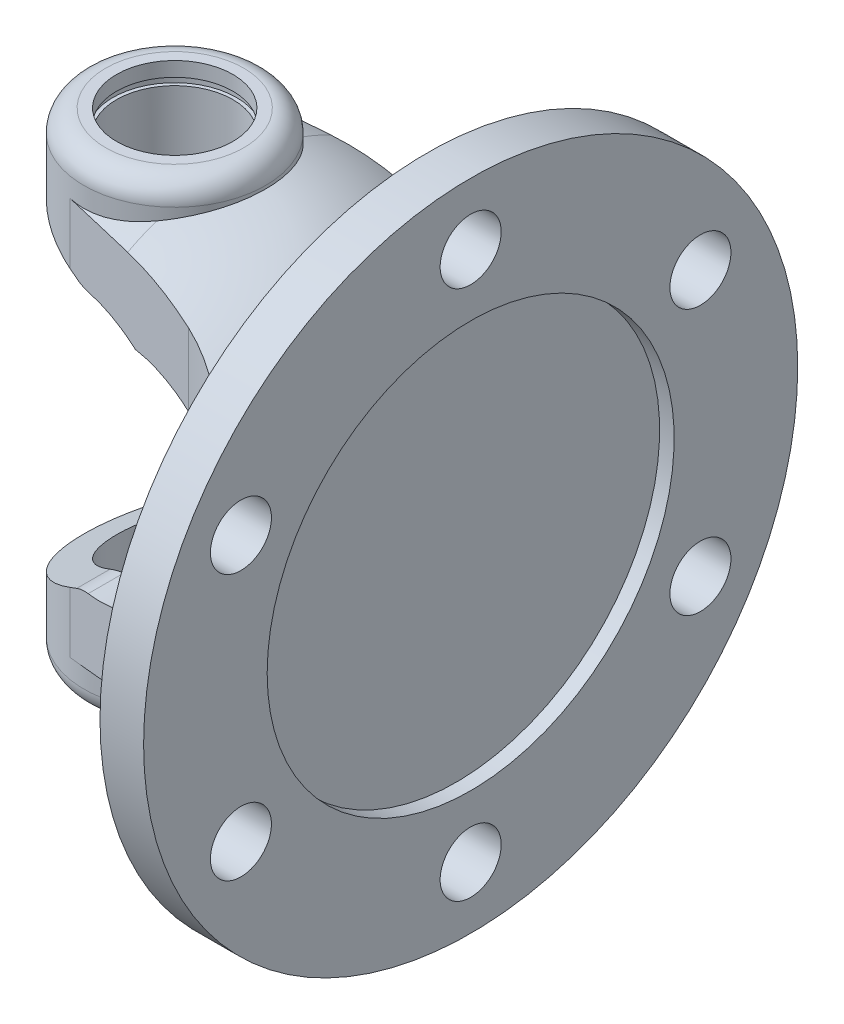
ISO-10303-21;
HEADER;
FILE_DESCRIPTION(('STEP AP214'),'2;1');
FILE_NAME('part.step','',(''),(''),'','','');
FILE_SCHEMA(('AUTOMOTIVE_DESIGN { 1 0 10303 214 1 1 1 1 }'));
ENDSEC;
DATA;
#1=APPLICATION_CONTEXT('core data for automotive mechanical design processes');
#2=APPLICATION_PROTOCOL_DEFINITION('international standard','automotive_design',2000,#1);
#3=PRODUCT_CONTEXT('',#1,'mechanical');
#4=PRODUCT('Part','Part','',(#3));
#5=PRODUCT_RELATED_PRODUCT_CATEGORY('part','',(#4));
#6=PRODUCT_DEFINITION_FORMATION('','',#4);
#7=PRODUCT_DEFINITION_CONTEXT('part definition',#1,'design');
#8=PRODUCT_DEFINITION('design','',#6,#7);
#9=PRODUCT_DEFINITION_SHAPE('','',#8);
#10=(LENGTH_UNIT() NAMED_UNIT(*) SI_UNIT(.MILLI.,.METRE.));
#11=(NAMED_UNIT(*) PLANE_ANGLE_UNIT() SI_UNIT($,.RADIAN.));
#12=(NAMED_UNIT(*) SI_UNIT($,.STERADIAN.) SOLID_ANGLE_UNIT());
#13=UNCERTAINTY_MEASURE_WITH_UNIT(LENGTH_MEASURE(1.E-05),#10,'distance_accuracy_value','');
#14=(GEOMETRIC_REPRESENTATION_CONTEXT(3) GLOBAL_UNCERTAINTY_ASSIGNED_CONTEXT((#13)) GLOBAL_UNIT_ASSIGNED_CONTEXT((#10,
#11,#12)) REPRESENTATION_CONTEXT('',''));
#15=CARTESIAN_POINT('',(0.,0.,0.));
#16=DIRECTION('',(0.,0.,1.));
#17=DIRECTION('',(1.,0.,0.));
#18=AXIS2_PLACEMENT_3D('',#15,#16,#17);
#19=CARTESIAN_POINT('',(0.,0.,20.));
#20=DIRECTION('',(0.,0.,1.));
#21=DIRECTION('',(1.,0.,0.));
#22=AXIS2_PLACEMENT_3D('',#19,#20,#21);
#23=CYLINDRICAL_SURFACE('',#22,18.);
#24=CARTESIAN_POINT('',(8.70442785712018,15.7554097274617,16.8641195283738));
#25=CARTESIAN_POINT('',(8.70122334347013,15.7571798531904,16.8302214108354));
#26=CARTESIAN_POINT('',(8.69817145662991,15.7588647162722,16.7963019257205));
#27=CARTESIAN_POINT('',(8.66984294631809,15.774496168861,16.464588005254));
#28=CARTESIAN_POINT('',(8.65622991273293,15.7819418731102,16.1653321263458));
#29=CARTESIAN_POINT('',(8.65382447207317,15.7832607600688,15.5665261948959));
#30=CARTESIAN_POINT('',(8.66504987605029,15.7771242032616,15.2669760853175));
#31=CARTESIAN_POINT('',(8.71264379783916,15.7508913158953,14.66972268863));
#32=CARTESIAN_POINT('',(8.74907439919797,15.7307605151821,14.3720257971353));
#33=CARTESIAN_POINT('',(8.84638883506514,15.6762398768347,13.7820578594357));
#34=CARTESIAN_POINT('',(8.90726828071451,15.6418525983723,13.4897858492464));
#35=CARTESIAN_POINT('',(9.05146709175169,15.5588497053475,12.9144803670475));
#36=CARTESIAN_POINT('',(9.13467511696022,15.5103045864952,12.6314086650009));
#37=CARTESIAN_POINT('',(9.32135277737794,15.3988370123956,12.0749540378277));
#38=CARTESIAN_POINT('',(9.42482449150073,15.3359130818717,11.801572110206));
#39=CARTESIAN_POINT('',(9.64923199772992,15.1957159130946,11.2660951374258));
#40=CARTESIAN_POINT('',(9.77015858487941,15.1184502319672,11.0039942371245));
#41=CARTESIAN_POINT('',(10.0265709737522,14.9496308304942,10.4919175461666));
#42=CARTESIAN_POINT('',(10.1620552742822,14.8580785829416,10.2419405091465));
#43=CARTESIAN_POINT('',(10.5126680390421,14.6133064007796,9.63740833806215));
#44=CARTESIAN_POINT('',(10.7347987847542,14.4515855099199,9.29028085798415));
#45=CARTESIAN_POINT('',(11.0804825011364,14.1860539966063,8.79075745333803));
#46=CARTESIAN_POINT('',(11.1978310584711,14.0936853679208,8.62772904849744));
#47=CARTESIAN_POINT('',(11.4357552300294,13.9013279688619,8.30859021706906));
#48=CARTESIAN_POINT('',(11.5563315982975,13.8013374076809,8.15248142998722));
#49=CARTESIAN_POINT('',(11.9542204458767,13.4620961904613,7.65335056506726));
#50=CARTESIAN_POINT('',(12.236244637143,13.2071568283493,7.32454795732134));
#51=CARTESIAN_POINT('',(12.8019696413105,12.6595752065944,6.70114377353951));
#52=CARTESIAN_POINT('',(13.0856717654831,12.3668982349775,6.40657416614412));
#53=CARTESIAN_POINT('',(13.6461565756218,11.7455332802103,5.85048752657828));
#54=CARTESIAN_POINT('',(13.9229372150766,11.4168347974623,5.58898017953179));
#55=CARTESIAN_POINT('',(14.4619707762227,10.7258163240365,5.09814335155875));
#56=CARTESIAN_POINT('',(14.7242372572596,10.3635285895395,4.86878352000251));
#57=CARTESIAN_POINT('',(15.0726822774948,9.84096744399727,4.57303824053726));
#58=CARTESIAN_POINT('',(15.1677136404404,9.69388954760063,4.49337287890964));
#59=CARTESIAN_POINT('',(15.3542111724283,9.39569153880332,4.33874407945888));
#60=CARTESIAN_POINT('',(15.4456857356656,9.2445825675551,4.263769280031));
#61=CARTESIAN_POINT('',(15.5353651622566,9.09133814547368,4.19100239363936));
#62=B_SPLINE_CURVE_WITH_KNOTS('',3,(#24,#25,#26,#27,#28,#29,#30,#31,#32,#33,#34,#35,#36,#37,#38,
#39,#40,#41,#42,#43,#44,#45,#46,#47,#48,#49,#50,#51,#52,#53,#54,#55,#56,#57,#58,#59,#60,#61),
.UNSPECIFIED.,.F.,.F.,(4,2,2,2,2,2,2,2,2,2,2,2,2,2,2,2,2,2,4),(0.,0.102292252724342,
0.999795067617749,1.89794166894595,2.79830843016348,3.6985136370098,4.59431085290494,
5.49020001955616,6.38561844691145,7.28094462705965,8.60622851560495,9.26929316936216,
9.93251409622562,11.4374287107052,12.9437375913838,14.4504867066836,15.9558035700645,
16.5328353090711,17.1084104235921),.UNSPECIFIED.);
#63=CARTESIAN_POINT('',(8.77902615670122,15.7139651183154,14.1944843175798));
#64=VERTEX_POINT('',#63);
#65=CARTESIAN_POINT('',(11.6778842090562,13.6977012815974,8.00000000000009));
#66=VERTEX_POINT('',#65);
#67=EDGE_CURVE('E205',#64,#66,#62,.T.);
#68=ORIENTED_EDGE('',*,*,#67,.F.);
#69=CARTESIAN_POINT('',(0.,0.,12.6837350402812));
#70=DIRECTION('',(0.169593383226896,0.,-0.985514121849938));
#71=DIRECTION('',(0.985514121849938,0.,0.169593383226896));
#72=AXIS2_PLACEMENT_3D('',#69,#70,#71);
#73=ELLIPSE('',#72,18.2645784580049,18.);
#74=CARTESIAN_POINT('',(0.941867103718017,17.9753410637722,12.8458173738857));
#75=VERTEX_POINT('',#74);
#76=EDGE_CURVE('E247',#64,#75,#73,.F.);
#77=ORIENTED_EDGE('',*,*,#76,.T.);
#78=DIRECTION('',(0.,0.,1.));
#79=VECTOR('',#78,1.);
#80=CARTESIAN_POINT('',(0.941867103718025,17.9753410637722,20.));
#81=LINE('',#80,#79);
#82=CARTESIAN_POINT('',(0.941867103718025,17.9753410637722,8.));
#83=VERTEX_POINT('',#82);
#84=EDGE_CURVE('E227',#75,#83,#81,.F.);
#85=ORIENTED_EDGE('',*,*,#84,.T.);
#86=CARTESIAN_POINT('',(0.,0.,8.));
#87=DIRECTION('',(0.,0.,1.));
#88=DIRECTION('',(1.,0.,0.));
#89=AXIS2_PLACEMENT_3D('',#86,#87,#88);
#90=CIRCLE('',#89,18.);
#91=EDGE_CURVE('E218',#66,#83,#90,.T.);
#92=ORIENTED_EDGE('',*,*,#91,.F.);
#93=EDGE_LOOP('',(#68,#77,#85,#92));
#94=FACE_BOUND('',#93,.T.);
#95=ADVANCED_FACE('F34',(#94),#23,.F.);
#96=CARTESIAN_POINT('',(0.,0.,20.));
#97=DIRECTION('',(0.,0.,1.));
#98=DIRECTION('',(1.,0.,0.));
#99=AXIS2_PLACEMENT_3D('',#96,#97,#98);
#100=CYLINDRICAL_SURFACE('',#99,18.);
#101=CARTESIAN_POINT('',(15.5353651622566,9.09133814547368,-4.19100239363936));
#102=CARTESIAN_POINT('',(15.4203926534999,9.28782327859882,-4.28429918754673));
#103=CARTESIAN_POINT('',(15.3024337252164,9.48082334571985,-4.38124361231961));
#104=CARTESIAN_POINT('',(15.0612143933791,9.85951979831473,-4.58252532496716));
#105=CARTESIAN_POINT('',(14.9379539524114,10.0452161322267,-4.68686266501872));
#106=CARTESIAN_POINT('',(14.6866676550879,10.4091671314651,-4.90314436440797));
#107=CARTESIAN_POINT('',(14.5586367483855,10.5874134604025,-5.01509689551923));
#108=CARTESIAN_POINT('',(14.2986964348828,10.9359301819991,-5.2466060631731));
#109=CARTESIAN_POINT('',(14.1667870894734,11.1062007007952,-5.36616257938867));
#110=CARTESIAN_POINT('',(13.7690923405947,11.6012866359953,-5.73394468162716));
#111=CARTESIAN_POINT('',(13.498713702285,11.9141438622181,-5.99351204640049));
#112=CARTESIAN_POINT('',(12.9528719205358,12.505389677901,-6.5438195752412));
#113=CARTESIAN_POINT('',(12.6774145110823,12.7838146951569,-6.83452617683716));
#114=CARTESIAN_POINT('',(12.2814893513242,13.1602969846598,-7.27788993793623));
#115=CARTESIAN_POINT('',(12.1598885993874,13.2726636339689,-7.4175725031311));
#116=CARTESIAN_POINT('',(11.9178497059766,13.4904176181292,-7.70365395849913));
#117=CARTESIAN_POINT('',(11.7974131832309,13.5957961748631,-7.85006091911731));
#118=CARTESIAN_POINT('',(11.4972851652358,13.8516720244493,-8.22654635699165));
#119=CARTESIAN_POINT('',(11.3189733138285,13.997502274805,-8.46093337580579));
#120=CARTESIAN_POINT('',(10.9703935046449,14.2723425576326,-8.94522539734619));
#121=CARTESIAN_POINT('',(10.8001284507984,14.401346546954,-9.19513592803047));
#122=CARTESIAN_POINT('',(10.4711109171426,14.6423167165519,-9.71051693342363));
#123=CARTESIAN_POINT('',(10.3123636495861,14.754275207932,-9.97599435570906));
#124=CARTESIAN_POINT('',(10.0102586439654,14.9608896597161,-10.5219884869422));
#125=CARTESIAN_POINT('',(9.8668967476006,15.0555503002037,-10.802501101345));
#126=CARTESIAN_POINT('',(9.6199807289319,15.214272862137,-11.3334912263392));
#127=CARTESIAN_POINT('',(9.51369462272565,15.2808014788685,-11.5819619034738));
#128=CARTESIAN_POINT('',(9.3172301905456,15.4013801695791,-12.0881123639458));
#129=CARTESIAN_POINT('',(9.22704882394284,15.4554325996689,-12.3457903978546));
#130=CARTESIAN_POINT('',(9.06497594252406,15.5510478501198,-12.8688391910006));
#131=CARTESIAN_POINT('',(8.99306630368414,15.5926230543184,-13.1342020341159));
#132=CARTESIAN_POINT('',(8.86915611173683,15.6634325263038,-13.6710713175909));
#133=CARTESIAN_POINT('',(8.81715124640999,15.6926694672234,-13.9425764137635));
#134=CARTESIAN_POINT('',(8.71212009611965,15.7513367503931,-14.6361196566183));
#135=CARTESIAN_POINT('',(8.67337816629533,15.7725331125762,-15.0611203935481));
#136=CARTESIAN_POINT('',(8.64692120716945,15.7870491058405,-15.9125908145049));
#137=CARTESIAN_POINT('',(8.65912882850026,15.7804109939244,-16.3390572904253));
#138=CARTESIAN_POINT('',(8.69817104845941,15.7588647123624,-16.7963030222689));
#139=CARTESIAN_POINT('',(8.70122289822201,15.7571798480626,-16.8302225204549));
#140=CARTESIAN_POINT('',(8.70442785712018,15.7554097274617,-16.8641195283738));
#141=B_SPLINE_CURVE_WITH_KNOTS('',3,(#101,#102,#103,#104,#105,#106,#107,#108,#109,#110,#111,
#112,#113,#114,#115,#116,#117,#118,#119,#120,#121,#122,#123,#124,#125,#126,#127,#128,#129,#130,
#131,#132,#133,#134,#135,#136,#137,#138,#139,#140),.UNSPECIFIED.,.F.,.F.,(4,2,2,2,2,2,2,2,2,2,2,
2,2,2,2,2,2,2,2,4),(0.,0.738004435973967,1.47601408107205,2.21482856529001,2.95363136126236,
4.41598390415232,5.87677585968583,6.526455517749,7.1769363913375,8.16194422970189,
9.14730486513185,10.1331086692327,11.1186453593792,11.9527667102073,12.7867304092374,
13.6198636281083,14.4528162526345,15.7305700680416,17.0063847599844,17.1086770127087),.UNSPECIFIED.);
#142=CARTESIAN_POINT('',(11.6778842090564,13.6977012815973,-7.99999999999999));
#143=VERTEX_POINT('',#142);
#144=CARTESIAN_POINT('',(8.77902615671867,15.7139651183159,-14.1944843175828));
#145=VERTEX_POINT('',#144);
#146=EDGE_CURVE('E629',#143,#145,#141,.T.);
#147=ORIENTED_EDGE('',*,*,#146,.F.);
#148=CARTESIAN_POINT('',(0.,0.,-8.00000000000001));
#149=DIRECTION('',(0.,0.,1.));
#150=DIRECTION('',(1.,0.,0.));
#151=AXIS2_PLACEMENT_3D('',#148,#149,#150);
#152=CIRCLE('',#151,18.);
#153=CARTESIAN_POINT('',(0.941867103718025,17.9753410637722,-8.00000000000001));
#154=VERTEX_POINT('',#153);
#155=EDGE_CURVE('E230',#143,#154,#152,.T.);
#156=ORIENTED_EDGE('',*,*,#155,.T.);
#157=DIRECTION('',(0.,0.,1.));
#158=VECTOR('',#157,1.);
#159=CARTESIAN_POINT('',(0.941867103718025,17.9753410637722,20.));
#160=LINE('',#159,#158);
#161=CARTESIAN_POINT('',(0.941867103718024,17.9753410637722,-12.8458173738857));
#162=VERTEX_POINT('',#161);
#163=EDGE_CURVE('E581',#154,#162,#160,.F.);
#164=ORIENTED_EDGE('',*,*,#163,.T.);
#165=CARTESIAN_POINT('',(0.,0.,-12.6837350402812));
#166=DIRECTION('',(0.169593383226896,0.,0.985514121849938));
#167=DIRECTION('',(-0.985514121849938,0.,0.169593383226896));
#168=AXIS2_PLACEMENT_3D('',#165,#166,#167);
#169=ELLIPSE('',#168,18.2645784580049,18.);
#170=EDGE_CURVE('E250',#162,#145,#169,.F.);
#171=ORIENTED_EDGE('',*,*,#170,.T.);
#172=EDGE_LOOP('',(#147,#156,#164,#171));
#173=FACE_BOUND('',#172,.T.);
#174=ADVANCED_FACE('F674',(#173),#100,.F.);
#175=CARTESIAN_POINT('',(0.,-45.,0.));
#176=DIRECTION('',(0.,1.,0.));
#177=DIRECTION('',(-1.,0.,0.));
#178=AXIS2_PLACEMENT_3D('',#175,#176,#177);
#179=CYLINDRICAL_SURFACE('',#178,8.);
#180=CARTESIAN_POINT('',(0.,-30.,0.));
#181=DIRECTION('',(0.,-1.,0.));
#182=DIRECTION('',(0.,0.,-1.));
#183=AXIS2_PLACEMENT_3D('',#180,#181,#182);
#184=CIRCLE('',#183,8.);
#185=CARTESIAN_POINT('',(0.,-30.,-8.));
#186=VERTEX_POINT('',#185);
#187=EDGE_CURVE('E643',#186,#186,#184,.T.);
#188=ORIENTED_EDGE('',*,*,#187,.T.);
#189=EDGE_LOOP('',(#188));
#190=FACE_BOUND('',#189,.T.);
#191=CARTESIAN_POINT('',(0.941867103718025,-17.9753410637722,-7.94436192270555));
#192=CARTESIAN_POINT('',(0.819347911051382,-17.9817369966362,-7.95891216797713));
#193=CARTESIAN_POINT('',(0.69672545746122,-17.9927067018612,-7.9705521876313));
#194=CARTESIAN_POINT('',(0.452201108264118,-18.0237282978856,-7.98814348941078));
#195=CARTESIAN_POINT('',(0.330299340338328,-18.0437817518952,-7.99409379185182));
#196=CARTESIAN_POINT('',(0.0904351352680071,-18.0924469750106,-8.00037357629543));
#197=CARTESIAN_POINT('',(-0.0275584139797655,-18.120892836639,-8.0008054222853));
#198=CARTESIAN_POINT('',(-0.261026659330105,-18.1862479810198,-7.99659182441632));
#199=CARTESIAN_POINT('',(-0.376502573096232,-18.2231530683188,-7.99194889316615));
#200=CARTESIAN_POINT('',(-0.570145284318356,-18.2928746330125,-7.98005838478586));
#201=CARTESIAN_POINT('',(-0.649143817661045,-18.3236142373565,-7.97400468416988));
#202=CARTESIAN_POINT('',(-0.805834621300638,-18.3892061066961,-7.95970292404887));
#203=CARTESIAN_POINT('',(-0.883514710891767,-18.4240843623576,-7.95144053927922));
#204=CARTESIAN_POINT('',(-0.960158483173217,-18.4608760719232,-7.94217197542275));
#205=B_SPLINE_CURVE_WITH_KNOTS('',3,(#191,#192,#193,#194,#195,#196,#197,#198,#199,#200,#201,
#202,#203,#204),.UNSPECIFIED.,.F.,.F.,(4,2,2,2,2,2,4),(0.,0.370516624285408,0.741097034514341,
1.1047932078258,1.46830939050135,1.72313391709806,1.97965308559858),.UNSPECIFIED.);
#206=CARTESIAN_POINT('',(0.64305630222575,-18.,-7.97411302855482));
#207=VERTEX_POINT('',#206);
#208=CARTESIAN_POINT('',(-0.960158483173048,-18.4608760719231,-7.94217197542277));
#209=VERTEX_POINT('',#208);
#210=EDGE_CURVE('E470',#207,#209,#205,.T.);
#211=ORIENTED_EDGE('',*,*,#210,.T.);
#212=CARTESIAN_POINT('',(0.,-18.,0.));
#213=DIRECTION('',(0.432731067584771,-0.901523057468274,0.));
#214=DIRECTION('',(0.901523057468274,0.432731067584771,0.));
#215=AXIS2_PLACEMENT_3D('',#212,#213,#214);
#216=ELLIPSE('',#215,8.87387175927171,8.);
#217=CARTESIAN_POINT('',(-0.960158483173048,-18.4608760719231,7.94217197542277));
#218=VERTEX_POINT('',#217);
#219=EDGE_CURVE('E476',#218,#209,#216,.T.);
#220=ORIENTED_EDGE('',*,*,#219,.F.);
#221=CARTESIAN_POINT('',(-0.960158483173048,-18.4608760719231,7.94217197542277));
#222=CARTESIAN_POINT('',(-0.849468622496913,-18.4077251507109,7.95557140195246));
#223=CARTESIAN_POINT('',(-0.736577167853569,-18.3585736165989,7.96685431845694));
#224=CARTESIAN_POINT('',(-0.507067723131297,-18.2685843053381,7.98473956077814));
#225=CARTESIAN_POINT('',(-0.390446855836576,-18.2277531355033,7.99133817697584));
#226=CARTESIAN_POINT('',(-0.156592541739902,-18.1555029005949,7.99930759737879));
#227=CARTESIAN_POINT('',(-0.039413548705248,-18.1239186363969,8.00077605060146));
#228=CARTESIAN_POINT('',(0.196812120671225,-18.0693829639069,7.99844973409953));
#229=CARTESIAN_POINT('',(0.315857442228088,-18.0464255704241,7.99465862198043));
#230=CARTESIAN_POINT('',(0.519227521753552,-18.0148086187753,7.98357382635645));
#231=CARTESIAN_POINT('',(0.603291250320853,-18.0039264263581,7.97766629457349));
#232=CARTESIAN_POINT('',(0.772205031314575,-17.9863978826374,7.9630993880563));
#233=CARTESIAN_POINT('',(0.8570565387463,-17.9797808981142,7.95442153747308));
#234=CARTESIAN_POINT('',(0.941867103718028,-17.9753410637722,7.94436192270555));
#235=B_SPLINE_CURVE_WITH_KNOTS('',3,(#221,#222,#223,#224,#225,#226,#227,#228,#229,#230,#231,
#232,#233,#234),.UNSPECIFIED.,.F.,.F.,(4,2,2,2,2,2,4),(0.,0.370489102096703,0.741271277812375,
1.10495623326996,1.46838840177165,1.72315727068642,1.97966204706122),.UNSPECIFIED.);
#236=CARTESIAN_POINT('',(0.64305630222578,-18.,7.97411302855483));
#237=VERTEX_POINT('',#236);
#238=EDGE_CURVE('E433',#218,#237,#235,.T.);
#239=ORIENTED_EDGE('',*,*,#238,.T.);
#240=CARTESIAN_POINT('',(0.,-18.,0.));
#241=DIRECTION('',(0.,1.,0.));
#242=DIRECTION('',(-1.,0.,0.));
#243=AXIS2_PLACEMENT_3D('',#240,#241,#242);
#244=CIRCLE('',#243,8.);
#245=EDGE_CURVE('E440',#237,#207,#244,.T.);
#246=ORIENTED_EDGE('',*,*,#245,.T.);
#247=EDGE_LOOP('',(#211,#220,#239,#246));
#248=FACE_BOUND('',#247,.T.);
#249=ADVANCED_FACE('F455',(#190,#248),#179,.F.);
#250=CARTESIAN_POINT('',(0.,31.,0.));
#251=DIRECTION('',(0.,-1.,0.));
#252=DIRECTION('',(0.,0.,-1.));
#253=AXIS2_PLACEMENT_3D('',#250,#251,#252);
#254=CIRCLE('',#253,8.);
#255=CARTESIAN_POINT('',(0.,31.,-8.));
#256=VERTEX_POINT('',#255);
#257=EDGE_CURVE('E655',#256,#256,#254,.T.);
#258=ORIENTED_EDGE('',*,*,#257,.T.);
#259=EDGE_LOOP('',(#258));
#260=FACE_BOUND('',#259,.T.);
#261=CARTESIAN_POINT('',(0.,33.,0.));
#262=DIRECTION('',(0.,1.,0.));
#263=DIRECTION('',(-1.,0.,0.));
#264=AXIS2_PLACEMENT_3D('',#261,#262,#263);
#265=CIRCLE('',#264,8.);
#266=CARTESIAN_POINT('',(-8.,33.,0.));
#267=VERTEX_POINT('',#266);
#268=EDGE_CURVE('E541',#267,#267,#265,.T.);
#269=ORIENTED_EDGE('',*,*,#268,.T.);
#270=EDGE_LOOP('',(#269));
#271=FACE_BOUND('',#270,.T.);
#272=ADVANCED_FACE('F660',(#260,#271),#179,.F.);
#273=CARTESIAN_POINT('',(-12.5,0.,0.));
#274=DIRECTION('',(-1.,0.,0.));
#275=DIRECTION('',(0.,0.,1.));
#276=AXIS2_PLACEMENT_3D('',#273,#274,#275);
#277=CYLINDRICAL_SURFACE('',#276,30.);
#278=CARTESIAN_POINT('',(-73.7057057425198,0.,0.));
#279=DIRECTION('',(0.169593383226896,0.,-0.985514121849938));
#280=DIRECTION('',(-0.985514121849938,0.,-0.169593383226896));
#281=AXIS2_PLACEMENT_3D('',#278,#279,#280);
#282=ELLIPSE('',#281,176.893693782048,30.);
#283=CARTESIAN_POINT('',(7.49999999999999,-26.5464999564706,13.9743815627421));
#284=VERTEX_POINT('',#283);
#285=CARTESIAN_POINT('',(-2.1199172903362,-27.3540499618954,12.3189265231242));
#286=VERTEX_POINT('',#285);
#287=EDGE_CURVE('E304',#284,#286,#282,.T.);
#288=ORIENTED_EDGE('',*,*,#287,.T.);
#289=CARTESIAN_POINT('',(-12.5,-30.,0.));
#290=CARTESIAN_POINT('',(-12.4999977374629,-29.9999981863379,0.334927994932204));
#291=CARTESIAN_POINT('',(-12.486520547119,-29.9943758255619,0.669969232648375));
#292=CARTESIAN_POINT('',(-12.4327370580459,-29.9720264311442,1.33766632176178));
#293=CARTESIAN_POINT('',(-12.392413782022,-29.9552923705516,1.67032052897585));
#294=CARTESIAN_POINT('',(-12.2852303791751,-29.9111099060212,2.33141399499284));
#295=CARTESIAN_POINT('',(-12.2183084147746,-29.8836365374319,2.65984157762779));
#296=CARTESIAN_POINT('',(-12.0586280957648,-29.8187055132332,3.30927507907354));
#297=CARTESIAN_POINT('',(-11.9658737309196,-29.7812493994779,3.63028213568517));
#298=CARTESIAN_POINT('',(-11.7557704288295,-29.6974560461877,4.26171378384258));
#299=CARTESIAN_POINT('',(-11.6385056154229,-29.6511492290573,4.57217045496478));
#300=CARTESIAN_POINT('',(-11.3802154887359,-29.5507216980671,5.18172511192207));
#301=CARTESIAN_POINT('',(-11.2391893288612,-29.4966007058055,5.4808226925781));
#302=CARTESIAN_POINT('',(-10.9345841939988,-29.3818863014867,6.06576848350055));
#303=CARTESIAN_POINT('',(-10.7710182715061,-29.3212966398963,6.35162423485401));
#304=CARTESIAN_POINT('',(-10.4223682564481,-29.195022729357,6.90885718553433));
#305=CARTESIAN_POINT('',(-10.23727575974,-29.1293364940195,7.18022866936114));
#306=CARTESIAN_POINT('',(-9.83791614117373,-28.9913419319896,7.71899587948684));
#307=CARTESIAN_POINT('',(-9.62270519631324,-28.9188683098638,7.98564991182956));
#308=CARTESIAN_POINT('',(-9.17135257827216,-28.7718294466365,8.50020440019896));
#309=CARTESIAN_POINT('',(-8.93520138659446,-28.6972632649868,8.74809623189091));
#310=CARTESIAN_POINT('',(-8.44332758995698,-28.5479397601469,9.22373535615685));
#311=CARTESIAN_POINT('',(-8.18759922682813,-28.47318238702,9.45147667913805));
#312=CARTESIAN_POINT('',(-7.65801615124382,-28.3254401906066,9.88544327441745));
#313=CARTESIAN_POINT('',(-7.38416143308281,-28.2524553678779,10.0916685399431));
#314=CARTESIAN_POINT('',(-6.80576577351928,-28.1066952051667,10.4910002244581));
#315=CARTESIAN_POINT('',(-6.50037666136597,-28.034109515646,10.682949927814));
#316=CARTESIAN_POINT('',(-5.87316476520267,-27.8953507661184,11.0402052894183));
#317=CARTESIAN_POINT('',(-5.55134885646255,-27.8291750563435,11.2055219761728));
#318=CARTESIAN_POINT('',(-4.89326247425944,-27.7054079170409,11.5081323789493));
#319=CARTESIAN_POINT('',(-4.55699456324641,-27.6478149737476,11.6454310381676));
#320=CARTESIAN_POINT('',(-3.87230854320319,-27.5432454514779,11.8906444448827));
#321=CARTESIAN_POINT('',(-3.52389134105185,-27.4962680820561,11.9985613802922));
#322=CARTESIAN_POINT('',(-2.83459308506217,-27.4166633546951,12.1793207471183));
#323=CARTESIAN_POINT('',(-2.49415643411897,-27.3834541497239,12.2536013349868));
#324=CARTESIAN_POINT('',(-1.8073011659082,-27.3294560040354,12.373567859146));
#325=CARTESIAN_POINT('',(-1.46088273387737,-27.3086666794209,12.4192546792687));
#326=CARTESIAN_POINT('',(-0.765060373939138,-27.280295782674,12.4814516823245));
#327=CARTESIAN_POINT('',(-0.415657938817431,-27.2727079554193,12.4979756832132));
#328=CARTESIAN_POINT('',(0.28332586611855,-27.2710131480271,12.5016740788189));
#329=CARTESIAN_POINT('',(0.632907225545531,-27.2769054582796,12.4888500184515));
#330=CARTESIAN_POINT('',(1.30252513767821,-27.3009764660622,12.4361337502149));
#331=CARTESIAN_POINT('',(1.62276938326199,-27.3181771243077,12.3983953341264));
#332=CARTESIAN_POINT('',(2.25862939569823,-27.3633120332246,12.298461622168));
#333=CARTESIAN_POINT('',(2.57424543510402,-27.3912456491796,12.2362677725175));
#334=CARTESIAN_POINT('',(3.19881016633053,-27.4569828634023,12.088037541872));
#335=CARTESIAN_POINT('',(3.50775792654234,-27.4947878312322,12.0019978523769));
#336=CARTESIAN_POINT('',(4.11705729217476,-27.5791425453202,11.8068700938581));
#337=CARTESIAN_POINT('',(4.41740856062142,-27.6256926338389,11.6977811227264));
#338=CARTESIAN_POINT('',(5.01403012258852,-27.7272837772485,11.4549295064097));
#339=CARTESIAN_POINT('',(5.31008167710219,-27.7824828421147,11.3206961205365));
#340=CARTESIAN_POINT('',(5.88996735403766,-27.8991218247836,11.030118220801));
#341=CARTESIAN_POINT('',(6.17379697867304,-27.9605640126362,10.873765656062));
#342=CARTESIAN_POINT('',(6.72775290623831,-28.0880754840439,10.5400152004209));
#343=CARTESIAN_POINT('',(6.99787737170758,-28.154145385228,10.3626144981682));
#344=CARTESIAN_POINT('',(7.52311090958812,-28.2892696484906,9.98783756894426));
#345=CARTESIAN_POINT('',(7.77821913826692,-28.3583241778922,9.79046022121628));
#346=CARTESIAN_POINT('',(8.29318031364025,-28.5036972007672,9.35923598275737));
#347=CARTESIAN_POINT('',(8.55160066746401,-28.5801350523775,9.12371578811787));
#348=CARTESIAN_POINT('',(9.04778638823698,-28.7325025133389,8.63189108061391));
#349=CARTESIAN_POINT('',(9.28555974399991,-28.808432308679,8.37559468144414));
#350=CARTESIAN_POINT('',(9.73928497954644,-28.9578616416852,7.84338442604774));
#351=CARTESIAN_POINT('',(9.95522230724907,-29.0313595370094,7.56745769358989));
#352=CARTESIAN_POINT('',(10.363569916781,-29.1739092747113,6.9977983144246));
#353=CARTESIAN_POINT('',(10.5559897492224,-29.2429629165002,6.70407296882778));
#354=CARTESIAN_POINT('',(10.920185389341,-29.3763690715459,6.09334741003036));
#355=CARTESIAN_POINT('',(11.0913730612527,-29.440573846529,5.77596349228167));
#356=CARTESIAN_POINT('',(11.4062093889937,-29.5606228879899,5.12627407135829));
#357=CARTESIAN_POINT('',(11.5498573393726,-29.6164669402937,4.79396818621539));
#358=CARTESIAN_POINT('',(11.8081337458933,-29.7181414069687,4.11693819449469));
#359=CARTESIAN_POINT('',(11.9227751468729,-29.7639762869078,3.77221970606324));
#360=CARTESIAN_POINT('',(12.1218619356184,-29.8442829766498,3.07288274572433));
#361=CARTESIAN_POINT('',(12.206309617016,-29.8787556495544,2.71826502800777));
#362=CARTESIAN_POINT('',(12.3396596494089,-29.9334888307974,2.02472167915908));
#363=CARTESIAN_POINT('',(12.3904726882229,-29.9545104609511,1.68622252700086));
#364=CARTESIAN_POINT('',(12.4641774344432,-29.9850727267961,1.00568521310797));
#365=CARTESIAN_POINT('',(12.4870703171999,-29.9946138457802,0.663647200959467));
#366=CARTESIAN_POINT('',(12.5046733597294,-30.0019464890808,-0.0211925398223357));
#367=CARTESIAN_POINT('',(12.4993905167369,-29.9997409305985,-0.363994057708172));
#368=CARTESIAN_POINT('',(12.460718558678,-29.9836488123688,-1.04772650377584));
#369=CARTESIAN_POINT('',(12.4273300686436,-29.9697625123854,-1.38865747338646));
#370=CARTESIAN_POINT('',(12.3351792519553,-29.9316720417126,-2.04913531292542));
#371=CARTESIAN_POINT('',(12.2777609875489,-29.9080151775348,-2.36890262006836));
#372=CARTESIAN_POINT('',(12.1384541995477,-29.8510976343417,-3.0021713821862));
#373=CARTESIAN_POINT('',(12.0565666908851,-29.8178373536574,-3.31567309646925));
#374=CARTESIAN_POINT('',(11.8690685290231,-29.7425187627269,-3.93442892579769));
#375=CARTESIAN_POINT('',(11.7634561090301,-29.7004597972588,-4.23968242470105));
#376=CARTESIAN_POINT('',(11.5294102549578,-29.6085414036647,-4.84009601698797));
#377=CARTESIAN_POINT('',(11.4009759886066,-29.5586816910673,-5.13525574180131));
#378=CARTESIAN_POINT('',(11.1179856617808,-29.4506702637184,-5.722758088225));
#379=CARTESIAN_POINT('',(10.9627461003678,-29.3923102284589,-6.01473303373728));
#380=CARTESIAN_POINT('',(10.6301770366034,-29.2698950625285,-6.58469831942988));
#381=CARTESIAN_POINT('',(10.4528393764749,-29.2058378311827,-6.86268344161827));
#382=CARTESIAN_POINT('',(10.0772709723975,-29.0735361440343,-7.40316981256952));
#383=CARTESIAN_POINT('',(9.87903677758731,-29.0052909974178,-7.66566849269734));
#384=CARTESIAN_POINT('',(9.46288483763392,-28.8662039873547,-8.17384122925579));
#385=CARTESIAN_POINT('',(9.24496613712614,-28.7953619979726,-8.41951446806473));
#386=CARTESIAN_POINT('',(8.77432126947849,-28.6476051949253,-8.90982003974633));
#387=CARTESIAN_POINT('',(8.52021947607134,-28.5706194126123,-9.15311243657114));
#388=CARTESIAN_POINT('',(7.99236483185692,-28.417672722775,-9.61746452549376));
#389=CARTESIAN_POINT('',(7.71861999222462,-28.3417114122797,-9.83853319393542));
#390=CARTESIAN_POINT('',(7.15271745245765,-28.1928503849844,-10.2573201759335));
#391=CARTESIAN_POINT('',(6.86054730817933,-28.1199527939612,-10.4550224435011));
#392=CARTESIAN_POINT('',(6.2597355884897,-27.9794395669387,-10.8254422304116));
#393=CARTESIAN_POINT('',(5.95110109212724,-27.9118216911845,-10.9981703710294));
#394=CARTESIAN_POINT('',(5.31445488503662,-27.7829961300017,-11.3196985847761));
#395=CARTESIAN_POINT('',(4.98622641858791,-27.7218961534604,-11.4681135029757));
#396=CARTESIAN_POINT('',(4.31672175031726,-27.6093323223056,-11.736523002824));
#397=CARTESIAN_POINT('',(3.97544531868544,-27.5578686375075,-11.856517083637));
#398=CARTESIAN_POINT('',(3.28257498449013,-27.4664792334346,-12.0667172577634));
#399=CARTESIAN_POINT('',(2.93098836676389,-27.4265455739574,-12.1569438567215));
#400=CARTESIAN_POINT('',(2.22011317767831,-27.359710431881,-12.306624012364));
#401=CARTESIAN_POINT('',(1.860825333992,-27.332807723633,-12.3660804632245));
#402=CARTESIAN_POINT('',(1.16553434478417,-27.2946403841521,-12.4500822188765));
#403=CARTESIAN_POINT('',(0.829869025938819,-27.2823309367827,-12.4769635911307));
#404=CARTESIAN_POINT('',(0.157245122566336,-27.2701611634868,-12.5035409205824));
#405=CARTESIAN_POINT('',(-0.179713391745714,-27.2703001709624,-12.503238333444));
#406=CARTESIAN_POINT('',(-0.852218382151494,-27.2830212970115,-12.4754549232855));
#407=CARTESIAN_POINT('',(-1.18776504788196,-27.2956016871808,-12.4479778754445));
#408=CARTESIAN_POINT('',(-1.85488989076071,-27.332758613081,-12.3661763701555));
#409=CARTESIAN_POINT('',(-2.18646809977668,-27.3573350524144,-12.3118521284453));
#410=CARTESIAN_POINT('',(-2.82779666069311,-27.4162226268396,-12.1801341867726));
#411=CARTESIAN_POINT('',(-3.1378418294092,-27.4500237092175,-12.1039406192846));
#412=CARTESIAN_POINT('',(-3.75026126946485,-27.52675288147,-11.928413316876));
#413=CARTESIAN_POINT('',(-4.05263285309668,-27.5696841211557,-11.8290715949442));
#414=CARTESIAN_POINT('',(-4.64784774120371,-27.6634432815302,-11.6081133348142));
#415=CARTESIAN_POINT('',(-4.94069101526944,-27.7142712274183,-11.4864967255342));
#416=CARTESIAN_POINT('',(-5.51532267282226,-27.8224573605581,-11.221910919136));
#417=CARTESIAN_POINT('',(-5.79711024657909,-27.87981602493,-11.0789401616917));
#418=CARTESIAN_POINT('',(-6.36481737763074,-28.0032066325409,-10.7634011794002));
#419=CARTESIAN_POINT('',(-6.64996723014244,-28.0695526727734,-10.5895704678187));
#420=CARTESIAN_POINT('',(-7.20481816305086,-28.2061532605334,-10.2201609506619));
#421=CARTESIAN_POINT('',(-7.47451877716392,-28.2764079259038,-10.0245814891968));
#422=CARTESIAN_POINT('',(-7.99718734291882,-28.4190388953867,-9.61278874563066));
#423=CARTESIAN_POINT('',(-8.25015125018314,-28.4914157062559,-9.39657050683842));
#424=CARTESIAN_POINT('',(-8.7380260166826,-28.6364948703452,-8.94468989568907));
#425=CARTESIAN_POINT('',(-8.97293446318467,-28.709197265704,-8.7090249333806));
#426=CARTESIAN_POINT('',(-9.43989871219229,-28.8584340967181,-8.20156831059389));
#427=CARTESIAN_POINT('',(-9.67049080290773,-28.9348601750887,-7.92839509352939));
#428=CARTESIAN_POINT('',(-10.1077978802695,-29.0839359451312,-7.36275583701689));
#429=CARTESIAN_POINT('',(-10.3145213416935,-29.1565869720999,-7.07029670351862));
#430=CARTESIAN_POINT('',(-10.7028043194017,-29.2961972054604,-6.46750304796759));
#431=CARTESIAN_POINT('',(-10.8843451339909,-29.3631521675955,-6.15715548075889));
#432=CARTESIAN_POINT('',(-11.2205494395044,-29.4894294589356,-5.52075682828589));
#433=CARTESIAN_POINT('',(-11.3752151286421,-29.5487524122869,-5.19470703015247));
#434=CARTESIAN_POINT('',(-11.6539078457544,-29.6571636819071,-4.53460593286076));
#435=CARTESIAN_POINT('',(-11.7783989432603,-29.706404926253,-4.20077589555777));
#436=CARTESIAN_POINT('',(-11.9987534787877,-29.7944604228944,-3.52237260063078));
#437=CARTESIAN_POINT('',(-12.0946121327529,-29.8332729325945,-3.1777975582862));
#438=CARTESIAN_POINT('',(-12.2563813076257,-29.8992214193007,-2.48162991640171));
#439=CARTESIAN_POINT('',(-12.322375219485,-29.9263898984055,-2.13005975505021));
#440=CARTESIAN_POINT('',(-12.423994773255,-29.9683747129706,-1.42200617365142));
#441=CARTESIAN_POINT('',(-12.459642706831,-29.9832001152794,-1.06552655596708));
#442=CARTESIAN_POINT('',(-12.4866144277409,-29.9944248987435,-0.590277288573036));
#443=CARTESIAN_POINT('',(-12.4916326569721,-29.9965144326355,-0.472292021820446));
#444=CARTESIAN_POINT('',(-12.4983258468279,-29.9993023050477,-0.236209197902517));
#445=CARTESIAN_POINT('',(-12.5000007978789,-30.000000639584,-0.118111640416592));
#446=CARTESIAN_POINT('',(-12.5,-30.,0.));
#447=B_SPLINE_CURVE_WITH_KNOTS('',3,(#289,#290,#291,#292,#293,#294,#295,#296,#297,#298,#299,
#300,#301,#302,#303,#304,#305,#306,#307,#308,#309,#310,#311,#312,#313,#314,#315,#316,#317,#318,
#319,#320,#321,#322,#323,#324,#325,#326,#327,#328,#329,#330,#331,#332,#333,#334,#335,#336,#337,
#338,#339,#340,#341,#342,#343,#344,#345,#346,#347,#348,#349,#350,#351,#352,#353,#354,#355,#356,
#357,#358,#359,#360,#361,#362,#363,#364,#365,#366,#367,#368,#369,#370,#371,#372,#373,#374,#375,
#376,#377,#378,#379,#380,#381,#382,#383,#384,#385,#386,#387,#388,#389,#390,#391,#392,#393,#394,
#395,#396,#397,#398,#399,#400,#401,#402,#403,#404,#405,#406,#407,#408,#409,#410,#411,#412,#413,
#414,#415,#416,#417,#418,#419,#420,#421,#422,#423,#424,#425,#426,#427,#428,#429,#430,#431,#432,
#433,#434,#435,#436,#437,#438,#439,#440,#441,#442,#443,#444,#445,#446),.UNSPECIFIED.,.T.,.F.,(4,
2,2,2,2,2,2,2,2,2,2,2,2,2,2,2,2,2,2,2,2,2,2,2,2,2,2,2,2,2,2,2,2,2,2,2,2,2,2,2,2,2,2,2,2,2,2,2,2,
2,2,2,2,2,2,2,2,2,2,2,2,2,2,2,2,2,2,2,2,2,2,2,2,2,2,2,2,2,4),(0.,1.00466377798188,
2.00996350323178,3.01761418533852,4.02510932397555,5.02920174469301,6.03332994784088,
7.03687909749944,8.04082136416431,9.09040763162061,10.1404734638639,11.190849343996,
12.2412255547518,13.343658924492,14.4456346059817,15.5474156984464,16.6491147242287,
17.697788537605,18.7464299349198,19.7945743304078,20.8426635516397,21.8102841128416,
22.7778474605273,23.7455451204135,24.7132806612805,25.70137245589,26.6898248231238,
27.6784093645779,28.6670493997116,29.7395376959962,30.8116091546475,31.8843904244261,
32.9567345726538,34.0541608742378,35.1516152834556,36.2485790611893,37.3454594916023,
38.3729497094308,39.4003966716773,40.4275884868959,41.4547574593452,42.4308578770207,
43.4069178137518,44.3830504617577,45.3592187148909,46.3654951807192,47.3721442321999,
48.3789597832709,49.3858242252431,50.4649453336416,51.5436288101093,52.6230487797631,
53.7020083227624,54.7966829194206,55.8913768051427,56.9853150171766,58.0791503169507,
59.0887421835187,60.0982799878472,61.1076775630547,62.1170670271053,63.0791633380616,
64.0415921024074,65.0040239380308,65.966526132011,66.986881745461,68.0072681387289,
69.0279002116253,70.0486684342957,71.1440527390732,72.2390469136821,73.3348499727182,
74.4305633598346,75.508170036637,76.5859566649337,77.6607149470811,78.7346830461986,
79.0889745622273,79.4432670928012),.UNSPECIFIED.);
#448=CARTESIAN_POINT('',(7.49999999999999,-28.2842712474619,10.));
#449=VERTEX_POINT('',#448);
#450=EDGE_CURVE('E527',#286,#449,#447,.T.);
#451=ORIENTED_EDGE('',*,*,#450,.T.);
#452=CARTESIAN_POINT('',(7.5,0.,0.));
#453=DIRECTION('',(-1.,0.,0.));
#454=DIRECTION('',(0.,0.,1.));
#455=AXIS2_PLACEMENT_3D('',#452,#453,#454);
#456=CIRCLE('',#455,30.);
#457=EDGE_CURVE('E288',#449,#284,#456,.T.);
#458=ORIENTED_EDGE('',*,*,#457,.T.);
#459=EDGE_LOOP('',(#288,#451,#458));
#460=FACE_BOUND('',#459,.T.);
#461=ADVANCED_FACE('F598',(#460),#277,.T.);
#462=CARTESIAN_POINT('',(7.49999999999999,26.5464999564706,13.9743815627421));
#463=VERTEX_POINT('',#462);
#464=CARTESIAN_POINT('',(7.49999999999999,28.2842712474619,10.));
#465=VERTEX_POINT('',#464);
#466=EDGE_CURVE('E283',#463,#465,#456,.T.);
#467=ORIENTED_EDGE('',*,*,#466,.T.);
#468=CARTESIAN_POINT('',(7.49999999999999,28.2842712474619,10.));
#469=CARTESIAN_POINT('',(7.2310273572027,28.2129381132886,10.2017488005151));
#470=CARTESIAN_POINT('',(6.95363726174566,28.1429605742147,10.3928147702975));
#471=CARTESIAN_POINT('',(6.38344566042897,28.0075316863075,10.7524499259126));
#472=CARTESIAN_POINT('',(6.09063846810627,27.9420820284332,10.921010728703));
#473=CARTESIAN_POINT('',(5.49044193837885,27.8174142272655,11.2347690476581));
#474=CARTESIAN_POINT('',(5.183015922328,27.7582131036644,11.3799032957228));
#475=CARTESIAN_POINT('',(4.55612724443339,27.6480221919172,11.6450633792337));
#476=CARTESIAN_POINT('',(4.23666606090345,27.5970313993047,11.76509228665));
#477=CARTESIAN_POINT('',(3.58673399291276,27.5047434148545,11.9792630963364));
#478=CARTESIAN_POINT('',(3.25623343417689,27.4634752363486,12.0733276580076));
#479=CARTESIAN_POINT('',(2.58742443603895,27.392229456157,12.2341128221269));
#480=CARTESIAN_POINT('',(2.24911573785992,27.3622522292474,12.3008325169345));
#481=CARTESIAN_POINT('',(1.56788804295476,27.3147037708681,12.4060588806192));
#482=CARTESIAN_POINT('',(1.22497834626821,27.2971105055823,12.4446156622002));
#483=CARTESIAN_POINT('',(0.536735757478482,27.2748936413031,12.4932343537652));
#484=CARTESIAN_POINT('',(0.191403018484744,27.2702692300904,12.5032980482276));
#485=CARTESIAN_POINT('',(-0.479266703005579,27.2740475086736,12.4950521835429));
#486=CARTESIAN_POINT('',(-0.804628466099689,27.281727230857,12.4783172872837));
#487=CARTESIAN_POINT('',(-1.45257499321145,27.3085188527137,12.4195748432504));
#488=CARTESIAN_POINT('',(-1.77515985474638,27.327630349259,12.3775681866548));
#489=CARTESIAN_POINT('',(-2.41545547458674,27.376677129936,12.2687042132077));
#490=CARTESIAN_POINT('',(-2.73316327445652,27.406618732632,12.2018323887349));
#491=CARTESIAN_POINT('',(-3.36139779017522,27.4763811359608,12.0439162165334));
#492=CARTESIAN_POINT('',(-3.67192435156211,27.5162021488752,11.952871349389));
#493=CARTESIAN_POINT('',(-4.28334672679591,27.6044504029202,11.7476278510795));
#494=CARTESIAN_POINT('',(-4.58425823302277,27.6528626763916,11.6334694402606));
#495=CARTESIAN_POINT('',(-5.17542781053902,27.7569872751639,11.3827971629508));
#496=CARTESIAN_POINT('',(-5.46568200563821,27.8127022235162,11.2462752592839));
#497=CARTESIAN_POINT('',(-6.03390955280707,27.9299260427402,10.9519092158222));
#498=CARTESIAN_POINT('',(-6.31188375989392,27.9914345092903,10.7940665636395));
#499=CARTESIAN_POINT('',(-6.8542520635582,28.1186994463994,10.4580596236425));
#500=CARTESIAN_POINT('',(-7.11864527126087,28.1844561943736,10.2798940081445));
#501=CARTESIAN_POINT('',(-7.65373502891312,28.3241520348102,9.88883083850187));
#502=CARTESIAN_POINT('',(-7.92316723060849,28.3983196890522,9.67428274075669));
#503=CARTESIAN_POINT('',(-8.44314514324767,28.5477616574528,9.2239663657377));
#504=CARTESIAN_POINT('',(-8.69369781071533,28.6230355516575,8.98820597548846));
#505=CARTESIAN_POINT('',(-9.17483679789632,28.7728225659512,8.49651509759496));
#506=CARTESIAN_POINT('',(-9.40540741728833,28.8473350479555,8.24056904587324));
#507=CARTESIAN_POINT('',(-9.84490299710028,28.9936059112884,7.71015347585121));
#508=CARTESIAN_POINT('',(-10.0538360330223,29.0653653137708,7.43569093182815));
#509=CARTESIAN_POINT('',(-10.4573942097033,29.2073598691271,6.85730240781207));
#510=CARTESIAN_POINT('',(-10.6509998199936,29.2773925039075,6.5526138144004));
#511=CARTESIAN_POINT('',(-11.0117032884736,29.4105339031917,5.92646043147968));
#512=CARTESIAN_POINT('',(-11.1788001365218,29.4736424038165,5.60499500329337));
#513=CARTESIAN_POINT('',(-11.4849117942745,29.5911003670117,4.94754789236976));
#514=CARTESIAN_POINT('',(-11.6239365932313,29.6454529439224,4.61157142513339));
#515=CARTESIAN_POINT('',(-11.8725599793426,29.7438167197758,3.92743605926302));
#516=CARTESIAN_POINT('',(-11.9821606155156,29.7878286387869,3.57927801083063));
#517=CARTESIAN_POINT('',(-12.165870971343,29.8622125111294,2.89165097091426));
#518=CARTESIAN_POINT('',(-12.2415150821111,29.893169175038,2.55265486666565));
#519=CARTESIAN_POINT('',(-12.3644090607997,29.9437049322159,1.86871336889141));
#520=CARTESIAN_POINT('',(-12.4116598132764,29.963284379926,1.52376816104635));
#521=CARTESIAN_POINT('',(-12.4772145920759,29.9904983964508,0.830787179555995));
#522=CARTESIAN_POINT('',(-12.4955285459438,29.9981370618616,0.4827525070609));
#523=CARTESIAN_POINT('',(-12.50302339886,30.0012595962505,-0.213678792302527));
#524=CARTESIAN_POINT('',(-12.4922054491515,29.9967439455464,-0.562075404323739));
#525=CARTESIAN_POINT('',(-12.4431270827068,29.9763400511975,-1.23504601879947));
#526=CARTESIAN_POINT('',(-12.4065923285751,29.9611670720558,-1.55976934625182));
#527=CARTESIAN_POINT('',(-12.3083544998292,29.9206214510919,-2.2047230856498));
#528=CARTESIAN_POINT('',(-12.2466526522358,29.8952493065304,-2.52495371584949));
#529=CARTESIAN_POINT('',(-12.0986819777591,29.8349383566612,-3.15876705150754));
#530=CARTESIAN_POINT('',(-12.0124124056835,29.7999992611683,-3.47234955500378));
#531=CARTESIAN_POINT('',(-11.816097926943,29.7214078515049,-4.09085712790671));
#532=CARTESIAN_POINT('',(-11.7060523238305,29.6777552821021,-4.39578194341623));
#533=CARTESIAN_POINT('',(-11.4613882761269,29.5820987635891,-4.99941456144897));
#534=CARTESIAN_POINT('',(-11.3264421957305,29.5299847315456,-5.29797197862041));
#535=CARTESIAN_POINT('',(-11.0340716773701,29.419082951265,-5.88269970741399));
#536=CARTESIAN_POINT('',(-10.8766391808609,29.3602928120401,-6.16886553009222));
#537=CARTESIAN_POINT('',(-10.5404391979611,29.2374140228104,-6.72720959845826));
#538=CARTESIAN_POINT('',(-10.3616697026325,29.173324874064,-6.99938652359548));
#539=CARTESIAN_POINT('',(-9.98394626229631,29.0413132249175,-7.52837693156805));
#540=CARTESIAN_POINT('',(-9.78499116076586,28.9733905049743,-7.78518953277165));
#541=CARTESIAN_POINT('',(-9.35336299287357,28.8303845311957,-8.29970775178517));
#542=CARTESIAN_POINT('',(-9.11930234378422,28.7551337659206,-8.556204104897));
#543=CARTESIAN_POINT('',(-8.63077554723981,28.6039567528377,-9.04875925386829));
#544=CARTESIAN_POINT('',(-8.37630858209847,28.5280304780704,-9.28481722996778));
#545=CARTESIAN_POINT('',(-7.84831352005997,28.3774908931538,-9.73521530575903));
#546=CARTESIAN_POINT('',(-7.57477938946,28.3028780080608,-9.94954847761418));
#547=CARTESIAN_POINT('',(-7.01017820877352,28.1570280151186,-10.3551064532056));
#548=CARTESIAN_POINT('',(-6.71910904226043,28.0857913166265,-10.5463284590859));
#549=CARTESIAN_POINT('',(-6.11089702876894,27.9464222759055,-10.9103973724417));
#550=CARTESIAN_POINT('',(-5.79320436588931,27.8784775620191,-11.0823995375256));
#551=CARTESIAN_POINT('',(-5.14292909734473,27.7506426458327,-11.3987255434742));
#552=CARTESIAN_POINT('',(-4.81035303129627,27.6907489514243,-11.5430613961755));
#553=CARTESIAN_POINT('',(-4.13254176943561,27.5810826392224,-11.8027012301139));
#554=CARTESIAN_POINT('',(-3.78731061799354,27.5313068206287,-11.9180143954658));
#555=CARTESIAN_POINT('',(-3.0866977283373,27.4437056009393,-12.1183748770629));
#556=CARTESIAN_POINT('',(-2.73131689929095,27.4058791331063,-12.2034248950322));
#557=CARTESIAN_POINT('',(-2.03638525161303,27.3456547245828,-12.337756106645));
#558=CARTESIAN_POINT('',(-1.69728204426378,27.3224224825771,-12.3889824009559));
#559=CARTESIAN_POINT('',(-1.01538744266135,27.288552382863,-12.4634103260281));
#560=CARTESIAN_POINT('',(-0.672596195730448,27.2779140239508,-12.4866130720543));
#561=CARTESIAN_POINT('',(0.0137649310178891,27.269625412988,-12.5047042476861));
#562=CARTESIAN_POINT('',(0.357334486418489,27.2719704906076,-12.4996028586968));
#563=CARTESIAN_POINT('',(1.04254552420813,27.2895513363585,-12.461173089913));
#564=CARTESIAN_POINT('',(1.38418709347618,27.3047865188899,-12.4278459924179));
#565=CARTESIAN_POINT('',(2.04077395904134,27.3461959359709,-12.3364454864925));
#566=CARTESIAN_POINT('',(2.35601338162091,27.3715964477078,-12.2801176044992));
#567=CARTESIAN_POINT('',(2.98033012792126,27.4323866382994,-12.1437117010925));
#568=CARTESIAN_POINT('',(3.28940727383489,27.467776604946,-12.0636329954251));
#569=CARTESIAN_POINT('',(3.89955297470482,27.5475044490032,-11.8804445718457));
#570=CARTESIAN_POINT('',(4.20061954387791,27.5918445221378,-11.7773292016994));
#571=CARTESIAN_POINT('',(4.79286635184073,27.6881951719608,-11.5489909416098));
#572=CARTESIAN_POINT('',(5.08404828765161,27.7402044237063,-11.4237718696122));
#573=CARTESIAN_POINT('',(5.74691576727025,27.8682638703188,-11.1084376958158));
#574=CARTESIAN_POINT('',(6.11442582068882,27.9466709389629,-10.9103956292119));
#575=CARTESIAN_POINT('',(6.64791820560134,28.0698217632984,-10.5876488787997));
#576=CARTESIAN_POINT('',(6.82258214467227,28.1117402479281,-10.4759397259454));
#577=CARTESIAN_POINT('',(7.16587425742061,28.1970238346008,-10.2441733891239));
#578=CARTESIAN_POINT('',(7.33450338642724,28.2403887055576,-10.1241175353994));
#579=CARTESIAN_POINT('',(7.49999999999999,28.2842712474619,-10.));
#580=B_SPLINE_CURVE_WITH_KNOTS('',3,(#468,#469,#470,#471,#472,#473,#474,#475,#476,#477,#478,
#479,#480,#481,#482,#483,#484,#485,#486,#487,#488,#489,#490,#491,#492,#493,#494,#495,#496,#497,
#498,#499,#500,#501,#502,#503,#504,#505,#506,#507,#508,#509,#510,#511,#512,#513,#514,#515,#516,
#517,#518,#519,#520,#521,#522,#523,#524,#525,#526,#527,#528,#529,#530,#531,#532,#533,#534,#535,
#536,#537,#538,#539,#540,#541,#542,#543,#544,#545,#546,#547,#548,#549,#550,#551,#552,#553,#554,
#555,#556,#557,#558,#559,#560,#561,#562,#563,#564,#565,#566,#567,#568,#569,#570,#571,#572,#573,
#574,#575,#576,#577,#578,#579),.UNSPECIFIED.,.F.,.F.,(4,2,2,2,2,2,2,2,2,2,2,2,2,2,2,2,2,2,2,2,2,
2,2,2,2,2,2,2,2,2,2,2,2,2,2,2,2,2,2,2,2,2,2,2,2,2,2,2,2,2,2,2,2,2,2,4),(0.,1.03091758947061,
2.06221812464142,3.09625890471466,4.13017308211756,5.16713456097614,6.20413045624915,
7.23927660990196,8.27435793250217,9.25081654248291,10.2272407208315,11.2042354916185,
12.1812512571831,13.1565812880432,14.1322626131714,15.1078758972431,16.0835529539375,
17.1393261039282,18.1947083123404,19.2509123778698,20.306720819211,21.4085148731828,
22.5103509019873,23.6117941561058,24.7131606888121,25.7579297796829,26.8026663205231,
27.8470443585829,28.8913811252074,29.8715988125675,30.8517687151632,31.8319683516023,
32.8121967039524,33.8063850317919,34.8009305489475,35.7955697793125,36.7902660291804,
37.8549699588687,38.9197165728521,39.9848016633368,41.0500155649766,42.1514106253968,
43.2523264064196,44.3528933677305,45.4533620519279,46.4832121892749,47.5130213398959,
48.5424600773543,49.5718520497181,50.5344677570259,51.4971111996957,52.459991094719,
53.4227048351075,54.6945714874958,55.3289402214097,55.9632080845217),.UNSPECIFIED.);
#581=CARTESIAN_POINT('',(-2.1199172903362,27.3540499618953,12.3189265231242));
#582=VERTEX_POINT('',#581);
#583=EDGE_CURVE('E228',#465,#582,#580,.T.);
#584=ORIENTED_EDGE('',*,*,#583,.T.);
#585=EDGE_CURVE('E308',#582,#463,#282,.T.);
#586=ORIENTED_EDGE('',*,*,#585,.T.);
#587=EDGE_LOOP('',(#467,#584,#586));
#588=FACE_BOUND('',#587,.T.);
#589=ADVANCED_FACE('F712',(#588),#277,.T.);
#590=CARTESIAN_POINT('',(14.2171431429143,-45.,-35.4242852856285));
#591=DIRECTION('',(0.,1.,0.));
#592=DIRECTION('',(0.,0.,1.));
#593=AXIS2_PLACEMENT_3D('',#590,#591,#592);
#594=CYLINDRICAL_SURFACE('',#593,20.);
#595=DIRECTION('',(0.,1.,0.));
#596=VECTOR('',#595,1.);
#597=CARTESIAN_POINT('',(17.6090108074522,-45.,-15.7140028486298));
#598=LINE('',#597,#596);
#599=CARTESIAN_POINT('',(17.6090108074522,-23.4707906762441,-15.7140028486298));
#600=VERTEX_POINT('',#599);
#601=CARTESIAN_POINT('',(17.6090108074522,-13.4753423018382,-15.7140028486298));
#602=VERTEX_POINT('',#601);
#603=EDGE_CURVE('E262',#600,#602,#598,.T.);
#604=ORIENTED_EDGE('',*,*,#603,.T.);
#605=CARTESIAN_POINT('',(15.8383863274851,-14.3731222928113,-15.4901043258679));
#606=CARTESIAN_POINT('',(16.0403090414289,-14.284959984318,-15.5065245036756));
#607=CARTESIAN_POINT('',(16.240313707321,-14.1930460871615,-15.5258819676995));
#608=CARTESIAN_POINT('',(16.6361459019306,-14.0019059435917,-15.5701151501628));
#609=CARTESIAN_POINT('',(16.8319739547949,-13.9026806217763,-15.5949901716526));
#610=CARTESIAN_POINT('',(17.4123813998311,-13.594488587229,-15.6773112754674));
#611=CARTESIAN_POINT('',(17.7902775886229,-13.3748338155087,-15.742486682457));
#612=CARTESIAN_POINT('',(18.5240056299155,-12.909649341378,-15.8899437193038));
#613=CARTESIAN_POINT('',(18.8799186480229,-12.6642251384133,-15.9721568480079));
#614=CARTESIAN_POINT('',(19.5693654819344,-12.1481518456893,-16.1504557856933));
#615=CARTESIAN_POINT('',(19.9028950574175,-11.8774979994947,-16.2465442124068));
#616=CARTESIAN_POINT('',(20.5448813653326,-11.3130654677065,-16.4487033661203));
#617=CARTESIAN_POINT('',(20.8534009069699,-11.0193486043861,-16.5547475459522));
#618=CARTESIAN_POINT('',(21.4448144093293,-10.4093548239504,-16.7732756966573));
#619=CARTESIAN_POINT('',(21.7277069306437,-10.0930766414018,-16.8857600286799));
#620=CARTESIAN_POINT('',(22.2668993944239,-9.43853637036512,-17.1134355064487));
#621=CARTESIAN_POINT('',(22.5231527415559,-9.10023739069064,-17.2286309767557));
#622=CARTESIAN_POINT('',(23.007142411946,-8.40327009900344,-17.4574385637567));
#623=CARTESIAN_POINT('',(23.2348768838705,-8.04460046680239,-17.5710505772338));
#624=CARTESIAN_POINT('',(23.6747622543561,-7.28330373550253,-17.7998988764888));
#625=CARTESIAN_POINT('',(23.884826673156,-6.87934340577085,-17.9147280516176));
#626=CARTESIAN_POINT('',(24.2689814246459,-6.05159763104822,-18.1323991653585));
#627=CARTESIAN_POINT('',(24.4430776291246,-5.6278154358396,-18.2352430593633));
#628=CARTESIAN_POINT('',(24.7531719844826,-4.76355713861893,-18.4235501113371));
#629=CARTESIAN_POINT('',(24.8892328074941,-4.32310987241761,-18.5090417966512));
#630=CARTESIAN_POINT('',(25.1217213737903,-3.42824230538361,-18.6579699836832));
#631=CARTESIAN_POINT('',(25.2181577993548,-2.97382508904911,-18.721411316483));
#632=CARTESIAN_POINT('',(25.3611841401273,-2.10746913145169,-18.8165509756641));
#633=CARTESIAN_POINT('',(25.4121892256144,-1.69656280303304,-18.8510348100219));
#634=CARTESIAN_POINT('',(25.4810211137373,-0.870718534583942,-18.8977362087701));
#635=CARTESIAN_POINT('',(25.4988507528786,-0.455780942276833,-18.9099556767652));
#636=CARTESIAN_POINT('',(25.5010413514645,0.374098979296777,-18.9114528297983));
#637=CARTESIAN_POINT('',(25.4854117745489,0.789041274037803,-18.9007370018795));
#638=CARTESIAN_POINT('',(25.4209593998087,1.61512713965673,-18.8569677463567));
#639=CARTESIAN_POINT('',(25.3721380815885,2.02627087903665,-18.8239153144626));
#640=CARTESIAN_POINT('',(25.250321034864,2.7894553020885,-18.7427516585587));
#641=CARTESIAN_POINT('',(25.1811735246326,3.14238232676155,-18.6970799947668));
#642=CARTESIAN_POINT('',(25.0188551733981,3.84065555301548,-18.5918055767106));
#643=CARTESIAN_POINT('',(24.9256766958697,4.18599930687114,-18.532198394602));
#644=CARTESIAN_POINT('',(24.7161567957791,4.86723821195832,-18.4011847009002));
#645=CARTESIAN_POINT('',(24.5998166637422,5.20313388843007,-18.3297788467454));
#646=CARTESIAN_POINT('',(24.3448449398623,5.86415694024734,-18.1774972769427));
#647=CARTESIAN_POINT('',(24.206210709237,6.18928303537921,-18.0966204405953));
#648=CARTESIAN_POINT('',(23.8924383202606,6.85989544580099,-17.9193054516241));
#649=CARTESIAN_POINT('',(23.7150273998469,7.20412114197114,-17.8221206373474));
#650=CARTESIAN_POINT('',(23.3353705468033,7.87697949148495,-17.6224898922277));
#651=CARTESIAN_POINT('',(23.1331235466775,8.20561147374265,-17.5200437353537));
#652=CARTESIAN_POINT('',(22.7046365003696,8.84664492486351,-17.3129871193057));
#653=CARTESIAN_POINT('',(22.4783717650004,9.1590291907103,-17.2083745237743));
#654=CARTESIAN_POINT('',(22.0030319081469,9.76636744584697,-17.0001902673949));
#655=CARTESIAN_POINT('',(21.7539529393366,10.0613184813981,-16.8966187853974));
#656=CARTESIAN_POINT('',(21.1941682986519,10.6767474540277,-16.6779606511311));
#657=CARTESIAN_POINT('',(20.8798690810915,10.9942059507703,-16.5635430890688));
#658=CARTESIAN_POINT('',(20.2241780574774,11.6032892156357,-16.3445852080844));
#659=CARTESIAN_POINT('',(19.882795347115,11.8949225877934,-16.2400415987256));
#660=CARTESIAN_POINT('',(19.1754457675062,12.4504957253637,-16.0451838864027));
#661=CARTESIAN_POINT('',(18.8095258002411,12.7144859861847,-15.9548436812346));
#662=CARTESIAN_POINT('',(18.0549856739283,13.213641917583,-15.7921757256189));
#663=CARTESIAN_POINT('',(17.6663810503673,13.4488269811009,-15.7198358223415));
#664=CARTESIAN_POINT('',(17.0358374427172,13.796748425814,-15.6225152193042));
#665=CARTESIAN_POINT('',(16.8005003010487,13.9195719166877,-15.5903785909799));
#666=CARTESIAN_POINT('',(16.323835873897,14.1544601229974,-15.5341006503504));
#667=CARTESIAN_POINT('',(16.0825137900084,14.2665337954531,-15.5099526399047));
#668=CARTESIAN_POINT('',(15.8383863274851,14.3731222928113,-15.4901043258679));
#669=B_SPLINE_CURVE_WITH_KNOTS('',3,(#605,#606,#607,#608,#609,#610,#611,#612,#613,#614,#615,
#616,#617,#618,#619,#620,#621,#622,#623,#624,#625,#626,#627,#628,#629,#630,#631,#632,#633,#634,
#635,#636,#637,#638,#639,#640,#641,#642,#643,#644,#645,#646,#647,#648,#649,#650,#651,#652,#653,
#654,#655,#656,#657,#658,#659,#660,#661,#662,#663,#664,#665,#666,#667,#668),.UNSPECIFIED.,.F.,
.F.,(4,2,2,2,2,2,2,2,2,2,2,2,2,2,2,2,2,2,2,2,2,2,2,2,2,2,2,2,2,2,2,4),(0.,0.662693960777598,
1.32530426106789,2.64923739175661,3.9679473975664,5.28690651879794,6.60244343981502,
7.91805420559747,9.23592873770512,10.5538887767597,11.9607249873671,13.3673313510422,
14.7716061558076,16.1755730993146,17.4201943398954,18.6647091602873,19.9088720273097,
21.1529794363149,22.2394040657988,23.3261743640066,24.4128841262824,25.4997226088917,
26.6963411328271,27.8930111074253,29.0909233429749,30.2890379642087,31.6708439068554,
33.0521877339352,34.4309625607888,35.8088039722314,36.6106340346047,37.4117900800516),.UNSPECIFIED.);
#670=CARTESIAN_POINT('',(17.6090108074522,13.4753423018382,-15.7140028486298));
#671=VERTEX_POINT('',#670);
#672=EDGE_CURVE('E603',#602,#671,#669,.T.);
#673=ORIENTED_EDGE('',*,*,#672,.T.);
#674=CARTESIAN_POINT('',(17.6090108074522,23.4707906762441,-15.7140028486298));
#675=VERTEX_POINT('',#674);
#676=EDGE_CURVE('E266',#671,#675,#598,.T.);
#677=ORIENTED_EDGE('',*,*,#676,.T.);
#678=CARTESIAN_POINT('',(17.6088108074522,-23.4708998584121,-15.7139684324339));
#679=CARTESIAN_POINT('',(18.0741350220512,-23.2169444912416,-15.7940171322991));
#680=CARTESIAN_POINT('',(18.5244947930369,-22.9413182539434,-15.8884943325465));
#681=CARTESIAN_POINT('',(19.3926356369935,-22.3523545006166,-16.1003841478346));
#682=CARTESIAN_POINT('',(19.8104883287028,-22.0391039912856,-16.2177442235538));
#683=CARTESIAN_POINT('',(20.6086858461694,-21.3829465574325,-16.4685088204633));
#684=CARTESIAN_POINT('',(20.9893921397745,-21.0404030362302,-16.6017230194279));
#685=CARTESIAN_POINT('',(21.7184857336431,-20.3266460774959,-16.8802236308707));
#686=CARTESIAN_POINT('',(22.0668507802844,-19.9554132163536,-17.0255182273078));
#687=CARTESIAN_POINT('',(22.8112965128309,-19.0958158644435,-17.35927401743));
#688=CARTESIAN_POINT('',(23.1987339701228,-18.6007377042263,-17.5497197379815));
#689=CARTESIAN_POINT('',(23.925912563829,-17.5781300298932,-17.9340316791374));
#690=CARTESIAN_POINT('',(24.2656488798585,-17.0505972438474,-18.1278982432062));
#691=CARTESIAN_POINT('',(24.9011830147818,-15.9655905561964,-18.5130481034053));
#692=CARTESIAN_POINT('',(25.1967868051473,-15.4079983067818,-18.7043168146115));
#693=CARTESIAN_POINT('',(25.7449466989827,-14.2691205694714,-19.0774302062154));
#694=CARTESIAN_POINT('',(25.997503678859,-13.687835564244,-19.2592750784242));
#695=CARTESIAN_POINT('',(26.4670591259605,-12.4928591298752,-19.6120246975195));
#696=CARTESIAN_POINT('',(26.6832100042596,-11.8787453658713,-19.7826237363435));
#697=CARTESIAN_POINT('',(27.0760680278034,-10.6330074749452,-20.1039573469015));
#698=CARTESIAN_POINT('',(27.2527756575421,-10.0013835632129,-20.2546921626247));
#699=CARTESIAN_POINT('',(27.5689431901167,-8.72449787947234,-20.5322183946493));
#700=CARTESIAN_POINT('',(27.7084436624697,-8.07925179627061,-20.6590358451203));
#701=CARTESIAN_POINT('',(27.9524496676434,-6.77748476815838,-20.8857488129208));
#702=CARTESIAN_POINT('',(28.0569520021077,-6.12096279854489,-20.9856418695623));
#703=CARTESIAN_POINT('',(28.2517120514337,-4.65536532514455,-21.1746056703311));
#704=CARTESIAN_POINT('',(28.3338801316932,-3.84427383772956,-21.2565535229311));
#705=CARTESIAN_POINT('',(28.4505430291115,-2.21525662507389,-21.3737651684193));
#706=CARTESIAN_POINT('',(28.4850319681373,-1.39733006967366,-21.4090232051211));
#707=CARTESIAN_POINT('',(28.5071595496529,0.240488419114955,-21.4315833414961));
#708=CARTESIAN_POINT('',(28.4947604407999,1.06038140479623,-21.4188467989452));
#709=CARTESIAN_POINT('',(28.4227274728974,2.69593028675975,-21.3457919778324));
#710=CARTESIAN_POINT('',(28.363094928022,3.5115863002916,-21.2854750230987));
#711=CARTESIAN_POINT('',(28.1927017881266,5.15714600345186,-21.1169944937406));
#712=CARTESIAN_POINT('',(28.0804855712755,5.98676071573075,-21.0074726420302));
#713=CARTESIAN_POINT('',(27.8017490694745,7.62988254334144,-20.744532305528));
#714=CARTESIAN_POINT('',(27.6352218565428,8.44338758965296,-20.5911082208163));
#715=CARTESIAN_POINT('',(27.2439846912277,10.0485018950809,-20.2463611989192));
#716=CARTESIAN_POINT('',(27.0192487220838,10.8401011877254,-20.0550213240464));
#717=CARTESIAN_POINT('',(26.5069500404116,12.394551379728,-19.6423706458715));
#718=CARTESIAN_POINT('',(26.2194067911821,13.1574110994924,-19.4210691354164));
#719=CARTESIAN_POINT('',(25.6605743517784,14.4519378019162,-19.0190094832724));
#720=CARTESIAN_POINT('',(25.4047998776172,14.9917674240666,-18.8428397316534));
#721=CARTESIAN_POINT('',(24.8538974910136,16.0488293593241,-18.4841694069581));
#722=CARTESIAN_POINT('',(24.558773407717,16.5660638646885,-18.3016694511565));
#723=CARTESIAN_POINT('',(23.9284790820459,17.5718567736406,-17.9365190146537));
#724=CARTESIAN_POINT('',(23.5935038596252,18.0605386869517,-17.7538732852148));
#725=CARTESIAN_POINT('',(22.8804904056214,19.0075525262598,-17.3935917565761));
#726=CARTESIAN_POINT('',(22.502456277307,19.4658873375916,-17.2159554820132));
#727=CARTESIAN_POINT('',(21.7853377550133,20.2553428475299,-16.9083107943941));
#728=CARTESIAN_POINT('',(21.4545040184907,20.5930963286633,-16.7760803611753));
#729=CARTESIAN_POINT('',(20.7649886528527,21.2431785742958,-16.5229484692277));
#730=CARTESIAN_POINT('',(20.4063236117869,21.5555222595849,-16.4020403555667));
#731=CARTESIAN_POINT('',(19.6573992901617,22.1547233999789,-16.1743965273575));
#732=CARTESIAN_POINT('',(19.2668506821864,22.4412826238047,-16.0678209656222));
#733=CARTESIAN_POINT('',(18.4580997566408,22.9817769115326,-15.8746631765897));
#734=CARTESIAN_POINT('',(18.0398464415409,23.2356491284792,-15.7881192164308));
#735=CARTESIAN_POINT('',(17.6088108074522,23.4708998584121,-15.7139684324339));
#736=B_SPLINE_CURVE_WITH_KNOTS('',3,(#678,#679,#680,#681,#682,#683,#684,#685,#686,#687,#688,
#689,#690,#691,#692,#693,#694,#695,#696,#697,#698,#699,#700,#701,#702,#703,#704,#705,#706,#707,
#708,#709,#710,#711,#712,#713,#714,#715,#716,#717,#718,#719,#720,#721,#722,#723,#724,#725,#726,
#727,#728,#729,#730,#731,#732,#733,#734,#735),.UNSPECIFIED.,.F.,.F.,(4,2,2,2,2,2,2,2,2,2,2,2,2,
2,2,2,2,2,2,2,2,2,2,2,2,2,2,2,4),(0.,1.60671463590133,3.20978277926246,4.79524878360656,
6.38179776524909,8.34950531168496,10.3174115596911,12.2937298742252,14.2700079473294,
16.2873370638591,18.3046413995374,20.3197370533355,22.3350168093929,24.7902316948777,
27.2457492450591,29.7032442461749,32.1606708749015,34.6905523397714,37.2207566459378,
39.7520937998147,42.2826476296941,44.1495347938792,46.0162404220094,47.8741601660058,
49.7319030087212,51.2032834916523,52.6737936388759,54.1595691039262,55.6481598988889),.UNSPECIFIED.);
#737=EDGE_CURVE('E320',#600,#675,#736,.T.);
#738=ORIENTED_EDGE('',*,*,#737,.F.);
#739=EDGE_LOOP('',(#604,#673,#677,#738));
#740=FACE_BOUND('',#739,.T.);
#741=ADVANCED_FACE('F334',(#740),#594,.F.);
#742=CARTESIAN_POINT('',(14.2171431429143,-45.,35.4242852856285));
#743=DIRECTION('',(0.,1.,0.));
#744=DIRECTION('',(0.,0.,1.));
#745=AXIS2_PLACEMENT_3D('',#742,#743,#744);
#746=CYLINDRICAL_SURFACE('',#745,20.);
#747=DIRECTION('',(0.,1.,0.));
#748=VECTOR('',#747,1.);
#749=CARTESIAN_POINT('',(17.6090108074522,-45.,15.7140028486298));
#750=LINE('',#749,#748);
#751=CARTESIAN_POINT('',(17.6090108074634,13.4753423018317,15.7140028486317));
#752=VERTEX_POINT('',#751);
#753=CARTESIAN_POINT('',(17.6090108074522,23.4707906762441,15.7140028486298));
#754=VERTEX_POINT('',#753);
#755=EDGE_CURVE('E261',#752,#754,#750,.T.);
#756=ORIENTED_EDGE('',*,*,#755,.F.);
#757=CARTESIAN_POINT('',(15.8383863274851,14.3731222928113,15.4901043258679));
#758=CARTESIAN_POINT('',(16.0403090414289,14.284959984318,15.5065245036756));
#759=CARTESIAN_POINT('',(16.240313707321,14.1930460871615,15.5258819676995));
#760=CARTESIAN_POINT('',(16.6361459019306,14.0019059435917,15.5701151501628));
#761=CARTESIAN_POINT('',(16.8319739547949,13.9026806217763,15.5949901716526));
#762=CARTESIAN_POINT('',(17.4123813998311,13.594488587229,15.6773112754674));
#763=CARTESIAN_POINT('',(17.7902775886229,13.3748338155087,15.742486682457));
#764=CARTESIAN_POINT('',(18.5240056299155,12.909649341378,15.8899437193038));
#765=CARTESIAN_POINT('',(18.8799186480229,12.6642251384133,15.9721568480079));
#766=CARTESIAN_POINT('',(19.5693654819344,12.1481518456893,16.1504557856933));
#767=CARTESIAN_POINT('',(19.9028950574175,11.8774979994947,16.2465442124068));
#768=CARTESIAN_POINT('',(20.5448813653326,11.3130654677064,16.4487033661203));
#769=CARTESIAN_POINT('',(20.8534009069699,11.019348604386,16.5547475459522));
#770=CARTESIAN_POINT('',(21.4448144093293,10.4093548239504,16.7732756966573));
#771=CARTESIAN_POINT('',(21.7277069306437,10.0930766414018,16.8857600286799));
#772=CARTESIAN_POINT('',(22.2668993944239,9.43853637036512,17.1134355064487));
#773=CARTESIAN_POINT('',(22.5231527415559,9.10023739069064,17.2286309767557));
#774=CARTESIAN_POINT('',(23.007142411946,8.40327009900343,17.4574385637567));
#775=CARTESIAN_POINT('',(23.2348768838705,8.04460046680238,17.5710505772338));
#776=CARTESIAN_POINT('',(23.6747622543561,7.28330373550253,17.7998988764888));
#777=CARTESIAN_POINT('',(23.884826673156,6.87934340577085,17.9147280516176));
#778=CARTESIAN_POINT('',(24.2689814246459,6.05159763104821,18.1323991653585));
#779=CARTESIAN_POINT('',(24.4430776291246,5.62781543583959,18.2352430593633));
#780=CARTESIAN_POINT('',(24.7531719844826,4.76355713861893,18.4235501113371));
#781=CARTESIAN_POINT('',(24.8892328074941,4.32310987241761,18.5090417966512));
#782=CARTESIAN_POINT('',(25.1217213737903,3.42824230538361,18.6579699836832));
#783=CARTESIAN_POINT('',(25.2181577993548,2.97382508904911,18.721411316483));
#784=CARTESIAN_POINT('',(25.3611841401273,2.1074691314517,18.8165509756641));
#785=CARTESIAN_POINT('',(25.4121892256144,1.69656280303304,18.8510348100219));
#786=CARTESIAN_POINT('',(25.4810211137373,0.870718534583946,18.8977362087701));
#787=CARTESIAN_POINT('',(25.4988507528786,0.455780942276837,18.9099556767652));
#788=CARTESIAN_POINT('',(25.5010413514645,-0.374098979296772,18.9114528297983));
#789=CARTESIAN_POINT('',(25.4854117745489,-0.789041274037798,18.9007370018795));
#790=CARTESIAN_POINT('',(25.4209593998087,-1.61512713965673,18.8569677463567));
#791=CARTESIAN_POINT('',(25.3721380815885,-2.02627087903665,18.8239153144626));
#792=CARTESIAN_POINT('',(25.250321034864,-2.7894553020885,18.7427516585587));
#793=CARTESIAN_POINT('',(25.1811735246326,-3.14238232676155,18.6970799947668));
#794=CARTESIAN_POINT('',(25.0188551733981,-3.84065555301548,18.5918055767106));
#795=CARTESIAN_POINT('',(24.9256766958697,-4.18599930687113,18.532198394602));
#796=CARTESIAN_POINT('',(24.7161567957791,-4.86723821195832,18.4011847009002));
#797=CARTESIAN_POINT('',(24.5998166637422,-5.20313388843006,18.3297788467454));
#798=CARTESIAN_POINT('',(24.3448449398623,-5.86415694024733,18.1774972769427));
#799=CARTESIAN_POINT('',(24.206210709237,-6.1892830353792,18.0966204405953));
#800=CARTESIAN_POINT('',(23.8924383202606,-6.85989544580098,17.9193054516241));
#801=CARTESIAN_POINT('',(23.7150273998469,-7.20412114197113,17.8221206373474));
#802=CARTESIAN_POINT('',(23.3353705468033,-7.87697949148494,17.6224898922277));
#803=CARTESIAN_POINT('',(23.1331235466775,-8.20561147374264,17.5200437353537));
#804=CARTESIAN_POINT('',(22.7046365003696,-8.8466449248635,17.3129871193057));
#805=CARTESIAN_POINT('',(22.4783717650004,-9.15902919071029,17.2083745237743));
#806=CARTESIAN_POINT('',(22.0030319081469,-9.76636744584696,17.0001902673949));
#807=CARTESIAN_POINT('',(21.7539529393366,-10.0613184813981,16.8966187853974));
#808=CARTESIAN_POINT('',(21.1941682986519,-10.6767474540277,16.6779606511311));
#809=CARTESIAN_POINT('',(20.8798690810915,-10.9942059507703,16.5635430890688));
#810=CARTESIAN_POINT('',(20.2241780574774,-11.6032892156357,16.3445852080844));
#811=CARTESIAN_POINT('',(19.882795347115,-11.8949225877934,16.2400415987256));
#812=CARTESIAN_POINT('',(19.1754457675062,-12.4504957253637,16.0451838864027));
#813=CARTESIAN_POINT('',(18.8095258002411,-12.7144859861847,15.9548436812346));
#814=CARTESIAN_POINT('',(18.0549856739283,-13.213641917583,15.7921757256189));
#815=CARTESIAN_POINT('',(17.6663810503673,-13.4488269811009,15.7198358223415));
#816=CARTESIAN_POINT('',(17.0358374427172,-13.796748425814,15.6225152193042));
#817=CARTESIAN_POINT('',(16.8005003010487,-13.9195719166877,15.5903785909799));
#818=CARTESIAN_POINT('',(16.323835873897,-14.1544601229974,15.5341006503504));
#819=CARTESIAN_POINT('',(16.0825137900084,-14.2665337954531,15.5099526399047));
#820=CARTESIAN_POINT('',(15.8383863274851,-14.3731222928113,15.4901043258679));
#821=B_SPLINE_CURVE_WITH_KNOTS('',3,(#757,#758,#759,#760,#761,#762,#763,#764,#765,#766,#767,
#768,#769,#770,#771,#772,#773,#774,#775,#776,#777,#778,#779,#780,#781,#782,#783,#784,#785,#786,
#787,#788,#789,#790,#791,#792,#793,#794,#795,#796,#797,#798,#799,#800,#801,#802,#803,#804,#805,
#806,#807,#808,#809,#810,#811,#812,#813,#814,#815,#816,#817,#818,#819,#820),.UNSPECIFIED.,.F.,
.F.,(4,2,2,2,2,2,2,2,2,2,2,2,2,2,2,2,2,2,2,2,2,2,2,2,2,2,2,2,2,2,2,4),(0.,0.662693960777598,
1.32530426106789,2.64923739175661,3.9679473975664,5.28690651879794,6.60244343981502,
7.91805420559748,9.23592873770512,10.5538887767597,11.9607249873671,13.3673313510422,
14.7716061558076,16.1755730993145,17.4201943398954,18.6647091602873,19.9088720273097,
21.1529794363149,22.2394040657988,23.3261743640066,24.4128841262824,25.4997226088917,
26.6963411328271,27.8930111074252,29.0909233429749,30.2890379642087,31.6708439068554,
33.0521877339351,34.4309625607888,35.8088039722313,36.6106340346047,37.4117900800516),.UNSPECIFIED.);
#822=CARTESIAN_POINT('',(17.609010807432,-13.47534230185,15.7140028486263));
#823=VERTEX_POINT('',#822);
#824=EDGE_CURVE('E343',#752,#823,#821,.T.);
#825=ORIENTED_EDGE('',*,*,#824,.T.);
#826=CARTESIAN_POINT('',(17.6090108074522,-23.4707906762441,15.7140028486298));
#827=VERTEX_POINT('',#826);
#828=EDGE_CURVE('E273',#827,#823,#750,.T.);
#829=ORIENTED_EDGE('',*,*,#828,.F.);
#830=CARTESIAN_POINT('',(17.6088108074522,23.4708998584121,15.7139684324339));
#831=CARTESIAN_POINT('',(18.0741350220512,23.2169444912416,15.7940171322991));
#832=CARTESIAN_POINT('',(18.5244947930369,22.9413182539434,15.8884943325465));
#833=CARTESIAN_POINT('',(19.3926356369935,22.3523545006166,16.1003841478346));
#834=CARTESIAN_POINT('',(19.8104883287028,22.0391039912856,16.2177442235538));
#835=CARTESIAN_POINT('',(20.6086858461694,21.3829465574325,16.4685088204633));
#836=CARTESIAN_POINT('',(20.9893921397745,21.0404030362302,16.6017230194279));
#837=CARTESIAN_POINT('',(21.7184857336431,20.3266460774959,16.8802236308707));
#838=CARTESIAN_POINT('',(22.0668507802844,19.9554132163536,17.0255182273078));
#839=CARTESIAN_POINT('',(22.8112965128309,19.0958158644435,17.35927401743));
#840=CARTESIAN_POINT('',(23.1987339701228,18.6007377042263,17.5497197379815));
#841=CARTESIAN_POINT('',(23.925912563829,17.5781300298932,17.9340316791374));
#842=CARTESIAN_POINT('',(24.2656488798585,17.0505972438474,18.1278982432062));
#843=CARTESIAN_POINT('',(24.9011830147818,15.9655905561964,18.5130481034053));
#844=CARTESIAN_POINT('',(25.1967868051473,15.4079983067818,18.7043168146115));
#845=CARTESIAN_POINT('',(25.7449466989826,14.2691205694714,19.0774302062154));
#846=CARTESIAN_POINT('',(25.997503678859,13.687835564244,19.2592750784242));
#847=CARTESIAN_POINT('',(26.4670591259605,12.4928591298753,19.6120246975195));
#848=CARTESIAN_POINT('',(26.6832100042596,11.8787453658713,19.7826237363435));
#849=CARTESIAN_POINT('',(27.0760680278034,10.6330074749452,20.1039573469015));
#850=CARTESIAN_POINT('',(27.2527756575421,10.0013835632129,20.2546921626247));
#851=CARTESIAN_POINT('',(27.5689431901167,8.72449787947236,20.5322183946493));
#852=CARTESIAN_POINT('',(27.7084436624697,8.07925179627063,20.6590358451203));
#853=CARTESIAN_POINT('',(27.9524496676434,6.7774847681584,20.8857488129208));
#854=CARTESIAN_POINT('',(28.0569520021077,6.12096279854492,20.9856418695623));
#855=CARTESIAN_POINT('',(28.2517120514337,4.65536532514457,21.1746056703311));
#856=CARTESIAN_POINT('',(28.3338801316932,3.84427383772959,21.2565535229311));
#857=CARTESIAN_POINT('',(28.4505430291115,2.21525662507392,21.3737651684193));
#858=CARTESIAN_POINT('',(28.4850319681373,1.39733006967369,21.4090232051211));
#859=CARTESIAN_POINT('',(28.5071595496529,-0.240488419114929,21.4315833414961));
#860=CARTESIAN_POINT('',(28.4947604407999,-1.0603814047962,21.4188467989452));
#861=CARTESIAN_POINT('',(28.4227274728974,-2.69593028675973,21.3457919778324));
#862=CARTESIAN_POINT('',(28.363094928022,-3.51158630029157,21.2854750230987));
#863=CARTESIAN_POINT('',(28.1927017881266,-5.15714600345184,21.1169944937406));
#864=CARTESIAN_POINT('',(28.0804855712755,-5.98676071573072,21.0074726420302));
#865=CARTESIAN_POINT('',(27.8017490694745,-7.62988254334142,20.744532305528));
#866=CARTESIAN_POINT('',(27.6352218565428,-8.44338758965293,20.5911082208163));
#867=CARTESIAN_POINT('',(27.2439846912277,-10.0485018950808,20.2463611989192));
#868=CARTESIAN_POINT('',(27.0192487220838,-10.8401011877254,20.0550213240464));
#869=CARTESIAN_POINT('',(26.5069500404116,-12.3945513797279,19.6423706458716));
#870=CARTESIAN_POINT('',(26.2194067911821,-13.1574110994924,19.4210691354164));
#871=CARTESIAN_POINT('',(25.6605743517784,-14.4519378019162,19.0190094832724));
#872=CARTESIAN_POINT('',(25.4047998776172,-14.9917674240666,18.8428397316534));
#873=CARTESIAN_POINT('',(24.8538974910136,-16.0488293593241,18.4841694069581));
#874=CARTESIAN_POINT('',(24.558773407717,-16.5660638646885,18.3016694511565));
#875=CARTESIAN_POINT('',(23.9284790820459,-17.5718567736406,17.9365190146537));
#876=CARTESIAN_POINT('',(23.5935038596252,-18.0605386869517,17.7538732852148));
#877=CARTESIAN_POINT('',(22.8804904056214,-19.0075525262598,17.3935917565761));
#878=CARTESIAN_POINT('',(22.502456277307,-19.4658873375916,17.2159554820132));
#879=CARTESIAN_POINT('',(21.7853377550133,-20.2553428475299,16.9083107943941));
#880=CARTESIAN_POINT('',(21.4545040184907,-20.5930963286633,16.7760803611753));
#881=CARTESIAN_POINT('',(20.7649886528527,-21.2431785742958,16.5229484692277));
#882=CARTESIAN_POINT('',(20.4063236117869,-21.5555222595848,16.4020403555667));
#883=CARTESIAN_POINT('',(19.6573992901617,-22.1547233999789,16.1743965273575));
#884=CARTESIAN_POINT('',(19.2668506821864,-22.4412826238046,16.0678209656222));
#885=CARTESIAN_POINT('',(18.4580997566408,-22.9817769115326,15.8746631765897));
#886=CARTESIAN_POINT('',(18.0398464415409,-23.2356491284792,15.7881192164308));
#887=CARTESIAN_POINT('',(17.6088108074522,-23.4708998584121,15.7139684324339));
#888=B_SPLINE_CURVE_WITH_KNOTS('',3,(#830,#831,#832,#833,#834,#835,#836,#837,#838,#839,#840,
#841,#842,#843,#844,#845,#846,#847,#848,#849,#850,#851,#852,#853,#854,#855,#856,#857,#858,#859,
#860,#861,#862,#863,#864,#865,#866,#867,#868,#869,#870,#871,#872,#873,#874,#875,#876,#877,#878,
#879,#880,#881,#882,#883,#884,#885,#886,#887),.UNSPECIFIED.,.F.,.F.,(4,2,2,2,2,2,2,2,2,2,2,2,2,
2,2,2,2,2,2,2,2,2,2,2,2,2,2,2,4),(0.,1.60671463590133,3.20978277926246,4.79524878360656,
6.38179776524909,8.34950531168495,10.3174115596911,12.2937298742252,14.2700079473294,
16.2873370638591,18.3046413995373,20.3197370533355,22.3350168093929,24.7902316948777,
27.2457492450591,29.7032442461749,32.1606708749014,34.6905523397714,37.2207566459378,
39.7520937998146,42.2826476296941,44.1495347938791,46.0162404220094,47.8741601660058,
49.7319030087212,51.2032834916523,52.6737936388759,54.1595691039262,55.6481598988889),.UNSPECIFIED.);
#889=EDGE_CURVE('E312',#754,#827,#888,.T.);
#890=ORIENTED_EDGE('',*,*,#889,.F.);
#891=EDGE_LOOP('',(#756,#825,#829,#890));
#892=FACE_BOUND('',#891,.T.);
#893=ADVANCED_FACE('F329',(#892),#746,.F.);
#894=CARTESIAN_POINT('',(-2.1199172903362,-45.,-12.3189265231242));
#895=DIRECTION('',(0.169593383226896,0.,0.985514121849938));
#896=DIRECTION('',(0.985514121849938,0.,-0.169593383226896));
#897=AXIS2_PLACEMENT_3D('',#894,#895,#896);
#898=PLANE('',#897);
#899=ORIENTED_EDGE('',*,*,#676,.F.);
#900=CARTESIAN_POINT('',(17.6092108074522,13.4752258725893,-15.7140372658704));
#901=CARTESIAN_POINT('',(17.375704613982,13.6111614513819,-15.6738540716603));
#902=CARTESIAN_POINT('',(17.1389498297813,13.7412569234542,-15.6331118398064));
#903=CARTESIAN_POINT('',(16.6594694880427,13.9895602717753,-15.5505998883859));
#904=CARTESIAN_POINT('',(16.4167441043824,14.107768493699,-15.5088301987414));
#905=CARTESIAN_POINT('',(15.68057392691,14.4441744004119,-15.3821454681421));
#906=CARTESIAN_POINT('',(15.1789506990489,14.644260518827,-15.2958230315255));
#907=CARTESIAN_POINT('',(14.1605126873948,14.9939586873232,-15.1205639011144));
#908=CARTESIAN_POINT('',(13.6437421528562,15.1437043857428,-15.0316348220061));
#909=CARTESIAN_POINT('',(12.5984925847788,15.3924309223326,-14.8517617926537));
#910=CARTESIAN_POINT('',(12.0700149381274,15.4914177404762,-14.7608180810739));
#911=CARTESIAN_POINT('',(11.0728180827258,15.6287890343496,-14.5892142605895));
#912=CARTESIAN_POINT('',(10.6048941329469,15.6732058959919,-14.5086910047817));
#913=CARTESIAN_POINT('',(9.66705423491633,15.7224767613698,-14.3473016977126));
#914=CARTESIAN_POINT('',(9.19713847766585,15.7273344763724,-14.2664356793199));
#915=CARTESIAN_POINT('',(8.2584977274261,15.6974970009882,-14.104908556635));
#916=CARTESIAN_POINT('',(7.78977282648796,15.6627988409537,-14.0242474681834));
#917=CARTESIAN_POINT('',(6.85676720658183,15.5540729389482,-13.863690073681));
#918=CARTESIAN_POINT('',(6.39248655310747,15.4800446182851,-13.7837937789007));
#919=CARTESIAN_POINT('',(5.46438475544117,15.2916364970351,-13.6240802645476));
#920=CARTESIAN_POINT('',(5.00068423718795,15.1766440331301,-13.5442838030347));
#921=CARTESIAN_POINT('',(4.08454327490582,14.9072417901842,-13.3866285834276));
#922=CARTESIAN_POINT('',(3.63210279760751,14.7528321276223,-13.3087698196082));
#923=CARTESIAN_POINT('',(2.74206079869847,14.4056165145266,-13.15560587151));
#924=CARTESIAN_POINT('',(2.30445036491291,14.2128341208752,-13.080299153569));
#925=CARTESIAN_POINT('',(1.44725135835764,13.7900797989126,-12.93278703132));
#926=CARTESIAN_POINT('',(1.02765739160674,13.5601191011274,-12.8605806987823));
#927=CARTESIAN_POINT('',(0.127758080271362,13.0147252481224,-12.705720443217));
#928=CARTESIAN_POINT('',(-0.347950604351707,12.6913933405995,-12.6238575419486));
#929=CARTESIAN_POINT('',(-1.03405002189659,12.1702539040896,-12.5057892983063));
#930=CARTESIAN_POINT('',(-1.25806404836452,11.9906191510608,-12.4672395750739));
#931=CARTESIAN_POINT('',(-1.69646043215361,11.6196236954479,-12.391797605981));
#932=CARTESIAN_POINT('',(-1.91084260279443,11.428262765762,-12.3549053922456));
#933=CARTESIAN_POINT('',(-2.12011729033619,11.2312202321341,-12.3188921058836));
#934=B_SPLINE_CURVE_WITH_KNOTS('',3,(#900,#901,#902,#903,#904,#905,#906,#907,#908,#909,#910,
#911,#912,#913,#914,#915,#916,#917,#918,#919,#920,#921,#922,#923,#924,#925,#926,#927,#928,#929,
#930,#931,#932,#933),.UNSPECIFIED.,.F.,.F.,(4,2,2,2,2,2,2,2,2,2,2,2,2,2,2,2,4),(0.,
0.819316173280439,1.63860851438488,3.27654902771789,4.91010599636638,6.54347046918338,
7.97249295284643,9.40138137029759,10.8303770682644,12.2593937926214,13.7107480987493,
15.1620981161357,16.6125598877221,18.0625843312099,19.802005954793,20.6708206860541,
21.5396522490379),.UNSPECIFIED.);
#935=EDGE_CURVE('E623',#671,#145,#934,.T.);
#936=ORIENTED_EDGE('',*,*,#935,.T.);
#937=ORIENTED_EDGE('',*,*,#170,.F.);
#938=CARTESIAN_POINT('',(1.20349685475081,22.9684913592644,-12.8908402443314));
#939=DIRECTION('',(0.169593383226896,0.,0.985514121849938));
#940=DIRECTION('',(-0.985514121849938,0.,0.169593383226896));
#941=AXIS2_PLACEMENT_3D('',#938,#939,#940);
#942=ELLIPSE('',#941,5.07349401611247,5.);
#943=CARTESIAN_POINT('',(-0.960158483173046,18.4608760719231,-12.5185050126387));
#944=VERTEX_POINT('',#943);
#945=EDGE_CURVE('E565',#162,#944,#942,.F.);
#946=ORIENTED_EDGE('',*,*,#945,.T.);
#947=DIRECTION('',(-0.890865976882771,0.42761566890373,0.153305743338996));
#948=VECTOR('',#947,1.);
#949=CARTESIAN_POINT('',(22.2674603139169,7.31161904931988,-16.5156577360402));
#950=LINE('',#949,#948);
#951=CARTESIAN_POINT('',(-2.11991729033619,19.0175602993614,-12.3189265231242));
#952=VERTEX_POINT('',#951);
#953=EDGE_CURVE('E259',#944,#952,#950,.T.);
#954=ORIENTED_EDGE('',*,*,#953,.T.);
#955=DIRECTION('',(0.,1.,0.));
#956=VECTOR('',#955,1.);
#957=CARTESIAN_POINT('',(-2.11991729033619,-45.,-12.3189265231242));
#958=LINE('',#957,#956);
#959=CARTESIAN_POINT('',(-2.1199172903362,27.3540499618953,-12.3189265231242));
#960=VERTEX_POINT('',#959);
#961=EDGE_CURVE('E269',#952,#960,#958,.T.);
#962=ORIENTED_EDGE('',*,*,#961,.T.);
#963=CARTESIAN_POINT('',(-73.7057057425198,0.,0.));
#964=DIRECTION('',(0.169593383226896,0.,0.985514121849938));
#965=DIRECTION('',(-0.985514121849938,0.,0.169593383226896));
#966=AXIS2_PLACEMENT_3D('',#963,#964,#965);
#967=ELLIPSE('',#966,176.893693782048,30.);
#968=CARTESIAN_POINT('',(7.49999999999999,26.5464999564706,-13.9743815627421));
#969=VERTEX_POINT('',#968);
#970=EDGE_CURVE('E311',#969,#960,#967,.T.);
#971=ORIENTED_EDGE('',*,*,#970,.F.);
#972=CARTESIAN_POINT('',(5.16436834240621,0.,-13.5724515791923));
#973=DIRECTION('',(0.169593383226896,0.,0.985514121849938));
#974=DIRECTION('',(0.985514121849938,0.,-0.169593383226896));
#975=AXIS2_PLACEMENT_3D('',#972,#973,#974);
#976=CIRCLE('',#975,26.6520802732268);
#977=EDGE_CURVE('E279',#675,#969,#976,.T.);
#978=ORIENTED_EDGE('',*,*,#977,.F.);
#979=EDGE_LOOP('',(#899,#936,#937,#946,#954,#962,#971,#978));
#980=FACE_BOUND('',#979,.T.);
#981=ADVANCED_FACE('F333',(#980),#898,.F.);
#982=CARTESIAN_POINT('',(8.77902615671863,-15.7139651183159,-14.1944843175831));
#983=VERTEX_POINT('',#982);
#984=CARTESIAN_POINT('',(0.941867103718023,-17.9753410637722,-12.8458173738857));
#985=VERTEX_POINT('',#984);
#986=EDGE_CURVE('E248',#983,#985,#169,.F.);
#987=ORIENTED_EDGE('',*,*,#986,.F.);
#988=CARTESIAN_POINT('',(-2.12011729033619,-11.2312202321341,-12.3188921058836));
#989=CARTESIAN_POINT('',(-1.8269345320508,-11.5073006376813,-12.3693448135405));
#990=CARTESIAN_POINT('',(-1.52362135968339,-11.7722615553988,-12.4215408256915));
#991=CARTESIAN_POINT('',(-0.898689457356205,-12.2787776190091,-12.5290829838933));
#992=CARTESIAN_POINT('',(-0.577075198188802,-12.5203384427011,-12.5844283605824));
#993=CARTESIAN_POINT('',(0.0825793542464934,-12.9789751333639,-12.6979458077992));
#994=CARTESIAN_POINT('',(0.420616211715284,-13.1960560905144,-12.7561172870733));
#995=CARTESIAN_POINT('',(1.11130151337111,-13.6048740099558,-12.8749746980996));
#996=CARTESIAN_POINT('',(1.46395187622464,-13.7966076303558,-12.9356609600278));
#997=CARTESIAN_POINT('',(2.23708267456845,-14.1813279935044,-13.0687061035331));
#998=CARTESIAN_POINT('',(2.65966298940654,-14.3699854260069,-13.1414263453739));
#999=CARTESIAN_POINT('',(3.51870848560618,-14.7113713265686,-13.2892562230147));
#1000=CARTESIAN_POINT('',(3.95517482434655,-14.8640967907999,-13.3643660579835));
#1001=CARTESIAN_POINT('',(4.8391050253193,-15.1327922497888,-13.5164782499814));
#1002=CARTESIAN_POINT('',(5.28657215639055,-15.2487511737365,-13.5934811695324));
#1003=CARTESIAN_POINT('',(6.18935729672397,-15.443197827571,-13.7488380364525));
#1004=CARTESIAN_POINT('',(6.64467562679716,-15.5216840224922,-13.8271920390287));
#1005=CARTESIAN_POINT('',(7.5722641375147,-15.6423080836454,-13.9868172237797));
#1006=CARTESIAN_POINT('',(8.04466346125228,-15.6834257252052,-14.068110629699));
#1007=CARTESIAN_POINT('',(8.99121265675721,-15.7254224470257,-14.2309986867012));
#1008=CARTESIAN_POINT('',(9.46536259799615,-15.7262999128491,-14.3125933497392));
#1009=CARTESIAN_POINT('',(10.4120344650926,-15.6877749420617,-14.4755025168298));
#1010=CARTESIAN_POINT('',(10.8845565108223,-15.6483755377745,-14.5568170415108));
#1011=CARTESIAN_POINT('',(11.8246616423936,-15.5294886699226,-14.7185961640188));
#1012=CARTESIAN_POINT('',(12.2922450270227,-15.4500036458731,-14.799060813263));
#1013=CARTESIAN_POINT('',(13.1808252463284,-15.2595869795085,-14.9519732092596));
#1014=CARTESIAN_POINT('',(13.6024787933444,-15.1517967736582,-15.0245339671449));
#1015=CARTESIAN_POINT('',(14.4362483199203,-14.9033530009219,-15.1680141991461));
#1016=CARTESIAN_POINT('',(14.8483651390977,-14.7627023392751,-15.2389338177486));
#1017=CARTESIAN_POINT('',(15.660640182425,-14.4491506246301,-15.3787151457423));
#1018=CARTESIAN_POINT('',(16.0607951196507,-14.2762408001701,-15.4475762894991));
#1019=CARTESIAN_POINT('',(16.8465660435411,-13.8990444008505,-15.582796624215));
#1020=CARTESIAN_POINT('',(17.2321791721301,-13.6947516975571,-15.6491553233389));
#1021=CARTESIAN_POINT('',(17.6092108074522,-13.4752258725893,-15.7140372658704));
#1022=B_SPLINE_CURVE_WITH_KNOTS('',3,(#988,#989,#990,#991,#992,#993,#994,#995,#996,#997,#998,
#999,#1000,#1001,#1002,#1003,#1004,#1005,#1006,#1007,#1008,#1009,#1010,#1011,#1012,#1013,#1014,
#1015,#1016,#1017,#1018,#1019,#1020,#1021),.UNSPECIFIED.,.F.,.F.,(4,2,2,2,2,2,2,2,2,2,2,2,2,2,2,
2,4),(0.,1.21725527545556,2.43421445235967,3.65092011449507,4.86778603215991,6.27152510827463,
7.67538149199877,9.07966019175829,10.4839964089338,11.9256126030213,13.3672866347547,
14.8088521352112,16.2503299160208,17.5726886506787,18.8949305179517,20.2175324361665,
21.5403929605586),.UNSPECIFIED.);
#1023=EDGE_CURVE('E602',#983,#602,#1022,.T.);
#1024=ORIENTED_EDGE('',*,*,#1023,.T.);
#1025=ORIENTED_EDGE('',*,*,#603,.F.);
#1026=CARTESIAN_POINT('',(7.49999999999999,-26.5464999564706,-13.9743815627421));
#1027=VERTEX_POINT('',#1026);
#1028=EDGE_CURVE('E282',#1027,#600,#976,.T.);
#1029=ORIENTED_EDGE('',*,*,#1028,.F.);
#1030=CARTESIAN_POINT('',(-2.11991729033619,-27.3540499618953,-12.3189265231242));
#1031=VERTEX_POINT('',#1030);
#1032=EDGE_CURVE('E307',#1031,#1027,#967,.T.);
#1033=ORIENTED_EDGE('',*,*,#1032,.F.);
#1034=CARTESIAN_POINT('',(-2.11991729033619,-19.0175602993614,-12.3189265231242));
#1035=VERTEX_POINT('',#1034);
#1036=EDGE_CURVE('E267',#1031,#1035,#958,.T.);
#1037=ORIENTED_EDGE('',*,*,#1036,.T.);
#1038=DIRECTION('',(0.890865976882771,0.42761566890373,-0.153305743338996));
#1039=VECTOR('',#1038,1.);
#1040=CARTESIAN_POINT('',(-12.0178822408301,-23.7685834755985,-10.6156233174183));
#1041=LINE('',#1040,#1039);
#1042=CARTESIAN_POINT('',(-0.960158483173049,-18.4608760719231,-12.5185050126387));
#1043=VERTEX_POINT('',#1042);
#1044=EDGE_CURVE('E254',#1035,#1043,#1041,.T.);
#1045=ORIENTED_EDGE('',*,*,#1044,.T.);
#1046=CARTESIAN_POINT('',(1.20349685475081,-22.9684913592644,-12.8908402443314));
#1047=DIRECTION('',(0.169593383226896,0.,0.985514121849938));
#1048=DIRECTION('',(-0.985514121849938,0.,0.169593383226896));
#1049=AXIS2_PLACEMENT_3D('',#1046,#1047,#1048);
#1050=ELLIPSE('',#1049,5.07349401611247,5.);
#1051=EDGE_CURVE('E557',#1043,#985,#1050,.F.);
#1052=ORIENTED_EDGE('',*,*,#1051,.T.);
#1053=EDGE_LOOP('',(#987,#1024,#1025,#1029,#1033,#1037,#1045,#1052));
#1054=FACE_BOUND('',#1053,.T.);
#1055=ADVANCED_FACE('F519',(#1054),#898,.F.);
#1056=CARTESIAN_POINT('',(-2.1199172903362,-45.,12.3189265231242));
#1057=DIRECTION('',(0.169593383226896,0.,-0.985514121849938));
#1058=DIRECTION('',(-0.985514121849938,0.,-0.169593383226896));
#1059=AXIS2_PLACEMENT_3D('',#1056,#1057,#1058);
#1060=PLANE('',#1059);
#1061=ORIENTED_EDGE('',*,*,#76,.F.);
#1062=CARTESIAN_POINT('',(-2.1201172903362,11.2312202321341,12.3188921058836));
#1063=CARTESIAN_POINT('',(-1.8269345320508,11.5073006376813,12.3693448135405));
#1064=CARTESIAN_POINT('',(-1.52362135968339,11.7722615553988,12.4215408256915));
#1065=CARTESIAN_POINT('',(-0.898689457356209,12.2787776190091,12.5290829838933));
#1066=CARTESIAN_POINT('',(-0.577075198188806,12.5203384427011,12.5844283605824));
#1067=CARTESIAN_POINT('',(0.0825793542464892,12.9789751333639,12.6979458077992));
#1068=CARTESIAN_POINT('',(0.42061621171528,13.1960560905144,12.7561172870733));
#1069=CARTESIAN_POINT('',(1.1113015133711,13.6048740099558,12.8749746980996));
#1070=CARTESIAN_POINT('',(1.46395187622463,13.7966076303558,12.9356609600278));
#1071=CARTESIAN_POINT('',(2.23708267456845,14.1813279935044,13.0687061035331));
#1072=CARTESIAN_POINT('',(2.65966298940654,14.3699854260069,13.1414263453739));
#1073=CARTESIAN_POINT('',(3.51870848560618,14.7113713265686,13.2892562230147));
#1074=CARTESIAN_POINT('',(3.95517482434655,14.8640967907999,13.3643660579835));
#1075=CARTESIAN_POINT('',(4.83910502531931,15.1327922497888,13.5164782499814));
#1076=CARTESIAN_POINT('',(5.28657215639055,15.2487511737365,13.5934811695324));
#1077=CARTESIAN_POINT('',(6.18935729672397,15.443197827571,13.7488380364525));
#1078=CARTESIAN_POINT('',(6.64467562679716,15.5216840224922,13.8271920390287));
#1079=CARTESIAN_POINT('',(7.5722641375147,15.6423080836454,13.9868172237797));
#1080=CARTESIAN_POINT('',(8.04466346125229,15.6834257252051,14.068110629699));
#1081=CARTESIAN_POINT('',(8.99121265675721,15.7254224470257,14.2309986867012));
#1082=CARTESIAN_POINT('',(9.46536259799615,15.7262999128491,14.3125933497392));
#1083=CARTESIAN_POINT('',(10.4120344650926,15.6877749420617,14.4755025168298));
#1084=CARTESIAN_POINT('',(10.8845565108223,15.6483755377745,14.5568170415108));
#1085=CARTESIAN_POINT('',(11.8246616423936,15.5294886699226,14.7185961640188));
#1086=CARTESIAN_POINT('',(12.2922450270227,15.4500036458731,14.799060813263));
#1087=CARTESIAN_POINT('',(13.1808252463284,15.2595869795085,14.9519732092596));
#1088=CARTESIAN_POINT('',(13.6024787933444,15.1517967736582,15.0245339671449));
#1089=CARTESIAN_POINT('',(14.4362483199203,14.9033530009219,15.1680141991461));
#1090=CARTESIAN_POINT('',(14.8483651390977,14.7627023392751,15.2389338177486));
#1091=CARTESIAN_POINT('',(15.660640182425,14.4491506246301,15.3787151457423));
#1092=CARTESIAN_POINT('',(16.0607951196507,14.2762408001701,15.4475762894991));
#1093=CARTESIAN_POINT('',(16.8465660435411,13.8990444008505,15.582796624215));
#1094=CARTESIAN_POINT('',(17.2321791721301,13.6947516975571,15.6491553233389));
#1095=CARTESIAN_POINT('',(17.6092108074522,13.4752258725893,15.7140372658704));
#1096=B_SPLINE_CURVE_WITH_KNOTS('',3,(#1062,#1063,#1064,#1065,#1066,#1067,#1068,#1069,#1070,
#1071,#1072,#1073,#1074,#1075,#1076,#1077,#1078,#1079,#1080,#1081,#1082,#1083,#1084,#1085,#1086,
#1087,#1088,#1089,#1090,#1091,#1092,#1093,#1094,#1095),.UNSPECIFIED.,.F.,.F.,(4,2,2,2,2,2,2,2,2,
2,2,2,2,2,2,2,4),(0.,1.21725527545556,2.43421445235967,3.65092011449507,4.86778603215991,
6.27152510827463,7.67538149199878,9.0796601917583,10.4839964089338,11.9256126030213,
13.3672866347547,14.8088521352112,16.2503299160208,17.5726886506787,18.8949305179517,
20.2175324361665,21.5403929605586),.UNSPECIFIED.);
#1097=EDGE_CURVE('E208',#64,#752,#1096,.T.);
#1098=ORIENTED_EDGE('',*,*,#1097,.T.);
#1099=ORIENTED_EDGE('',*,*,#755,.T.);
#1100=CARTESIAN_POINT('',(5.16436834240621,0.,13.5724515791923));
#1101=DIRECTION('',(0.169593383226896,0.,-0.985514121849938));
#1102=DIRECTION('',(-0.985514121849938,0.,-0.169593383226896));
#1103=AXIS2_PLACEMENT_3D('',#1100,#1101,#1102);
#1104=CIRCLE('',#1103,26.6520802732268);
#1105=EDGE_CURVE('E278',#463,#754,#1104,.T.);
#1106=ORIENTED_EDGE('',*,*,#1105,.F.);
#1107=ORIENTED_EDGE('',*,*,#585,.F.);
#1108=DIRECTION('',(0.,1.,0.));
#1109=VECTOR('',#1108,1.);
#1110=CARTESIAN_POINT('',(-2.1199172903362,-45.,12.3189265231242));
#1111=LINE('',#1110,#1109);
#1112=CARTESIAN_POINT('',(-2.1199172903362,19.0175602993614,12.3189265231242));
#1113=VERTEX_POINT('',#1112);
#1114=EDGE_CURVE('E272',#1113,#582,#1111,.T.);
#1115=ORIENTED_EDGE('',*,*,#1114,.F.);
#1116=DIRECTION('',(0.890865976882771,-0.42761566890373,0.153305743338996));
#1117=VECTOR('',#1116,1.);
#1118=CARTESIAN_POINT('',(22.2674603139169,7.31161904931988,16.5156577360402));
#1119=LINE('',#1118,#1117);
#1120=CARTESIAN_POINT('',(-0.960158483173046,18.4608760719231,12.5185050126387));
#1121=VERTEX_POINT('',#1120);
#1122=EDGE_CURVE('E572',#1113,#1121,#1119,.T.);
#1123=ORIENTED_EDGE('',*,*,#1122,.T.);
#1124=CARTESIAN_POINT('',(1.20349685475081,22.9684913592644,12.8908402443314));
#1125=DIRECTION('',(0.169593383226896,0.,-0.985514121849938));
#1126=DIRECTION('',(0.985514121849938,0.,0.169593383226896));
#1127=AXIS2_PLACEMENT_3D('',#1124,#1125,#1126);
#1128=ELLIPSE('',#1127,5.07349401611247,5.);
#1129=EDGE_CURVE('E530',#1121,#75,#1128,.F.);
#1130=ORIENTED_EDGE('',*,*,#1129,.T.);
#1131=EDGE_LOOP('',(#1061,#1098,#1099,#1106,#1107,#1115,#1123,#1130));
#1132=FACE_BOUND('',#1131,.T.);
#1133=ADVANCED_FACE('F336',(#1132),#1060,.F.);
#1134=ORIENTED_EDGE('',*,*,#828,.T.);
#1135=CARTESIAN_POINT('',(17.6092108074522,-13.4752258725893,15.7140372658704));
#1136=CARTESIAN_POINT('',(17.375704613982,-13.6111614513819,15.6738540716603));
#1137=CARTESIAN_POINT('',(17.1389498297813,-13.7412569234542,15.6331118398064));
#1138=CARTESIAN_POINT('',(16.6594694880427,-13.9895602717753,15.5505998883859));
#1139=CARTESIAN_POINT('',(16.4167441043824,-14.107768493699,15.5088301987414));
#1140=CARTESIAN_POINT('',(15.68057392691,-14.4441744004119,15.3821454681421));
#1141=CARTESIAN_POINT('',(15.1789506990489,-14.644260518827,15.2958230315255));
#1142=CARTESIAN_POINT('',(14.1605126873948,-14.9939586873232,15.1205639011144));
#1143=CARTESIAN_POINT('',(13.6437421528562,-15.1437043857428,15.0316348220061));
#1144=CARTESIAN_POINT('',(12.5984925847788,-15.3924309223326,14.8517617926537));
#1145=CARTESIAN_POINT('',(12.0700149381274,-15.4914177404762,14.7608180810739));
#1146=CARTESIAN_POINT('',(11.0728180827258,-15.6287890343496,14.5892142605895));
#1147=CARTESIAN_POINT('',(10.6048941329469,-15.6732058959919,14.5086910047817));
#1148=CARTESIAN_POINT('',(9.66705423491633,-15.7224767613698,14.3473016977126));
#1149=CARTESIAN_POINT('',(9.19713847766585,-15.7273344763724,14.2664356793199));
#1150=CARTESIAN_POINT('',(8.2584977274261,-15.6974970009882,14.104908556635));
#1151=CARTESIAN_POINT('',(7.78977282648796,-15.6627988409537,14.0242474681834));
#1152=CARTESIAN_POINT('',(6.85676720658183,-15.5540729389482,13.863690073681));
#1153=CARTESIAN_POINT('',(6.39248655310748,-15.4800446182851,13.7837937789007));
#1154=CARTESIAN_POINT('',(5.46438475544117,-15.2916364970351,13.6240802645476));
#1155=CARTESIAN_POINT('',(5.00068423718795,-15.1766440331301,13.5442838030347));
#1156=CARTESIAN_POINT('',(4.08454327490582,-14.9072417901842,13.3866285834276));
#1157=CARTESIAN_POINT('',(3.63210279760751,-14.7528321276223,13.3087698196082));
#1158=CARTESIAN_POINT('',(2.74206079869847,-14.4056165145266,13.15560587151));
#1159=CARTESIAN_POINT('',(2.30445036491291,-14.2128341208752,13.080299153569));
#1160=CARTESIAN_POINT('',(1.44725135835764,-13.7900797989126,12.93278703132));
#1161=CARTESIAN_POINT('',(1.02765739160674,-13.5601191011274,12.8605806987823));
#1162=CARTESIAN_POINT('',(0.127758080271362,-13.0147252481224,12.705720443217));
#1163=CARTESIAN_POINT('',(-0.347950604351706,-12.6913933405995,12.6238575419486));
#1164=CARTESIAN_POINT('',(-1.03405002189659,-12.1702539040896,12.5057892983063));
#1165=CARTESIAN_POINT('',(-1.25806404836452,-11.9906191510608,12.4672395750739));
#1166=CARTESIAN_POINT('',(-1.69646043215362,-11.6196236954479,12.391797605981));
#1167=CARTESIAN_POINT('',(-1.91084260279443,-11.428262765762,12.3549053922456));
#1168=CARTESIAN_POINT('',(-2.1201172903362,-11.2312202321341,12.3188921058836));
#1169=B_SPLINE_CURVE_WITH_KNOTS('',3,(#1135,#1136,#1137,#1138,#1139,#1140,#1141,#1142,#1143,
#1144,#1145,#1146,#1147,#1148,#1149,#1150,#1151,#1152,#1153,#1154,#1155,#1156,#1157,#1158,#1159,
#1160,#1161,#1162,#1163,#1164,#1165,#1166,#1167,#1168),.UNSPECIFIED.,.F.,.F.,(4,2,2,2,2,2,2,2,2,
2,2,2,2,2,2,2,4),(0.,0.819316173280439,1.63860851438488,3.27654902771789,4.91010599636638,
6.54347046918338,7.97249295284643,9.40138137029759,10.8303770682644,12.2593937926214,
13.7107480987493,15.1620981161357,16.6125598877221,18.0625843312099,19.802005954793,
20.6708206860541,21.5396522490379),.UNSPECIFIED.);
#1170=CARTESIAN_POINT('',(8.77902615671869,-15.7139651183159,14.1944843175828));
#1171=VERTEX_POINT('',#1170);
#1172=EDGE_CURVE('E222',#823,#1171,#1169,.T.);
#1173=ORIENTED_EDGE('',*,*,#1172,.T.);
#1174=CARTESIAN_POINT('',(0.941867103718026,-17.9753410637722,12.8458173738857));
#1175=VERTEX_POINT('',#1174);
#1176=EDGE_CURVE('E244',#1175,#1171,#73,.F.);
#1177=ORIENTED_EDGE('',*,*,#1176,.F.);
#1178=CARTESIAN_POINT('',(1.20349685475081,-22.9684913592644,12.8908402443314));
#1179=DIRECTION('',(0.169593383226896,0.,-0.985514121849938));
#1180=DIRECTION('',(0.985514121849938,0.,0.169593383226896));
#1181=AXIS2_PLACEMENT_3D('',#1178,#1179,#1180);
#1182=ELLIPSE('',#1181,5.07349401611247,5.);
#1183=CARTESIAN_POINT('',(-0.960158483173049,-18.4608760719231,12.5185050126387));
#1184=VERTEX_POINT('',#1183);
#1185=EDGE_CURVE('E553',#1175,#1184,#1182,.F.);
#1186=ORIENTED_EDGE('',*,*,#1185,.T.);
#1187=DIRECTION('',(-0.890865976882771,-0.42761566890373,-0.153305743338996));
#1188=VECTOR('',#1187,1.);
#1189=CARTESIAN_POINT('',(-12.0178822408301,-23.7685834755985,10.6156233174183));
#1190=LINE('',#1189,#1188);
#1191=CARTESIAN_POINT('',(-2.1199172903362,-19.0175602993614,12.3189265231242));
#1192=VERTEX_POINT('',#1191);
#1193=EDGE_CURVE('E587',#1184,#1192,#1190,.T.);
#1194=ORIENTED_EDGE('',*,*,#1193,.T.);
#1195=EDGE_CURVE('E270',#286,#1192,#1111,.T.);
#1196=ORIENTED_EDGE('',*,*,#1195,.F.);
#1197=ORIENTED_EDGE('',*,*,#287,.F.);
#1198=EDGE_CURVE('E265',#827,#284,#1104,.T.);
#1199=ORIENTED_EDGE('',*,*,#1198,.F.);
#1200=EDGE_LOOP('',(#1134,#1173,#1177,#1186,#1194,#1196,#1197,#1199));
#1201=FACE_BOUND('',#1200,.T.);
#1202=ADVANCED_FACE('F547',(#1201),#1060,.F.);
#1203=CARTESIAN_POINT('',(-12.5,24.,-45.));
#1204=DIRECTION('',(0.432731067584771,0.901523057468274,0.));
#1205=DIRECTION('',(-0.901523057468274,0.432731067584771,0.));
#1206=AXIS2_PLACEMENT_3D('',#1203,#1204,#1205);
#1207=PLANE('',#1206);
#1208=DIRECTION('',(0.,0.,-1.));
#1209=VECTOR('',#1208,1.);
#1210=CARTESIAN_POINT('',(-0.960158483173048,18.4608760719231,-8.00000000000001));
#1211=LINE('',#1210,#1209);
#1212=CARTESIAN_POINT('',(-0.960158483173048,18.4608760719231,-7.94217197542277));
#1213=VERTEX_POINT('',#1212);
#1214=EDGE_CURVE('E562',#944,#1213,#1211,.F.);
#1215=ORIENTED_EDGE('',*,*,#1214,.T.);
#1216=CARTESIAN_POINT('',(0.,18.,0.));
#1217=DIRECTION('',(0.432731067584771,0.901523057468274,0.));
#1218=DIRECTION('',(-0.901523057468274,0.432731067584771,0.));
#1219=AXIS2_PLACEMENT_3D('',#1216,#1217,#1218);
#1220=ELLIPSE('',#1219,8.87387175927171,8.);
#1221=CARTESIAN_POINT('',(-0.960158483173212,18.4608760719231,7.94217197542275));
#1222=VERTEX_POINT('',#1221);
#1223=EDGE_CURVE('E1210',#1213,#1222,#1220,.T.);
#1224=ORIENTED_EDGE('',*,*,#1223,.T.);
#1225=DIRECTION('',(0.,0.,-1.));
#1226=VECTOR('',#1225,1.);
#1227=CARTESIAN_POINT('',(-0.960158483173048,18.4608760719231,12.6837350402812));
#1228=LINE('',#1227,#1226);
#1229=EDGE_CURVE('E555',#1222,#1121,#1228,.F.);
#1230=ORIENTED_EDGE('',*,*,#1229,.T.);
#1231=ORIENTED_EDGE('',*,*,#1122,.F.);
#1232=CARTESIAN_POINT('',(0.,18.,0.));
#1233=DIRECTION('',(0.432731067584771,0.901523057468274,0.));
#1234=DIRECTION('',(-0.901523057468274,0.432731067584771,0.));
#1235=AXIS2_PLACEMENT_3D('',#1232,#1233,#1234);
#1236=ELLIPSE('',#1235,13.865424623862,12.5);
#1237=EDGE_CURVE('E257',#952,#1113,#1236,.T.);
#1238=ORIENTED_EDGE('',*,*,#1237,.F.);
#1239=ORIENTED_EDGE('',*,*,#953,.F.);
#1240=EDGE_LOOP('',(#1215,#1224,#1230,#1231,#1238,#1239));
#1241=FACE_BOUND('',#1240,.T.);
#1242=ADVANCED_FACE('F882',(#1241),#1207,.F.);
#1243=CARTESIAN_POINT('',(-12.5,-24.,-45.));
#1244=DIRECTION('',(0.432731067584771,-0.901523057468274,0.));
#1245=DIRECTION('',(0.901523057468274,0.432731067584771,0.));
#1246=AXIS2_PLACEMENT_3D('',#1243,#1244,#1245);
#1247=PLANE('',#1246);
#1248=DIRECTION('',(0.,0.,-1.));
#1249=VECTOR('',#1248,1.);
#1250=CARTESIAN_POINT('',(-0.960158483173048,-18.4608760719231,7.99999999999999));
#1251=LINE('',#1250,#1249);
#1252=EDGE_CURVE('E697',#1184,#218,#1251,.T.);
#1253=ORIENTED_EDGE('',*,*,#1252,.T.);
#1254=ORIENTED_EDGE('',*,*,#219,.T.);
#1255=DIRECTION('',(0.,0.,-1.));
#1256=VECTOR('',#1255,1.);
#1257=CARTESIAN_POINT('',(-0.960158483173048,-18.4608760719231,-12.6837350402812));
#1258=LINE('',#1257,#1256);
#1259=EDGE_CURVE('E693',#209,#1043,#1258,.T.);
#1260=ORIENTED_EDGE('',*,*,#1259,.T.);
#1261=ORIENTED_EDGE('',*,*,#1044,.F.);
#1262=CARTESIAN_POINT('',(0.,-18.,0.));
#1263=DIRECTION('',(0.432731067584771,-0.901523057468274,0.));
#1264=DIRECTION('',(0.901523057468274,0.432731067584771,0.));
#1265=AXIS2_PLACEMENT_3D('',#1262,#1263,#1264);
#1266=ELLIPSE('',#1265,13.865424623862,12.5);
#1267=EDGE_CURVE('E251',#1192,#1035,#1266,.T.);
#1268=ORIENTED_EDGE('',*,*,#1267,.F.);
#1269=ORIENTED_EDGE('',*,*,#1193,.F.);
#1270=EDGE_LOOP('',(#1253,#1254,#1260,#1261,#1268,#1269));
#1271=FACE_BOUND('',#1270,.T.);
#1272=ADVANCED_FACE('F595',(#1271),#1247,.F.);
#1273=CARTESIAN_POINT('',(0.,-45.,0.));
#1274=DIRECTION('',(0.,1.,0.));
#1275=DIRECTION('',(0.,0.,1.));
#1276=AXIS2_PLACEMENT_3D('',#1273,#1274,#1275);
#1277=CYLINDRICAL_SURFACE('',#1276,12.5);
#1278=ORIENTED_EDGE('',*,*,#1237,.T.);
#1279=ORIENTED_EDGE('',*,*,#1114,.T.);
#1280=ORIENTED_EDGE('',*,*,#583,.F.);
#1281=CARTESIAN_POINT('',(7.4998,28.2842182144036,-10.0001499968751));
#1282=CARTESIAN_POINT('',(7.77598986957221,28.3574547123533,-9.79306202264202));
#1283=CARTESIAN_POINT('',(8.04398755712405,28.4282335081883,-9.57415293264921));
#1284=CARTESIAN_POINT('',(8.56168785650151,28.5644876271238,-9.11411996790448));
#1285=CARTESIAN_POINT('',(8.81138845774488,28.6299623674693,-8.87299365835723));
#1286=CARTESIAN_POINT('',(9.29061481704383,28.7552282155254,-8.36990277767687));
#1287=CARTESIAN_POINT('',(9.52013275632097,28.8150171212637,-8.10793020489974));
#1288=CARTESIAN_POINT('',(9.95706023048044,28.9285174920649,-7.56494296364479));
#1289=CARTESIAN_POINT('',(10.1644709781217,28.9822292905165,-7.28392934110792));
#1290=CARTESIAN_POINT('',(10.5557640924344,29.0833117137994,-6.70434642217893));
#1291=CARTESIAN_POINT('',(10.7396156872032,29.1306740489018,-6.40575489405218));
#1292=CARTESIAN_POINT('',(11.0819374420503,29.2186755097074,-5.79341798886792));
#1293=CARTESIAN_POINT('',(11.2404081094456,29.2593147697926,-5.47967291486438));
#1294=CARTESIAN_POINT('',(11.5305343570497,29.3335881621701,-4.83944425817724));
#1295=CARTESIAN_POINT('',(11.6622057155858,29.3672264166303,-4.51296830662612));
#1296=CARTESIAN_POINT('',(11.8977047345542,29.4273083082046,-3.84948465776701));
#1297=CARTESIAN_POINT('',(12.001533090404,29.4537521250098,-3.51247722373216));
#1298=CARTESIAN_POINT('',(12.1786391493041,29.4988149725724,-2.8372723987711));
#1299=CARTESIAN_POINT('',(12.2524878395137,29.5175803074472,-2.49923444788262));
#1300=CARTESIAN_POINT('',(12.3719405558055,29.5479159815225,-1.8178856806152));
#1301=CARTESIAN_POINT('',(12.4175448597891,29.5594863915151,-1.47457491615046));
#1302=CARTESIAN_POINT('',(12.480120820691,29.5753592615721,-0.785124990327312));
#1303=CARTESIAN_POINT('',(12.4970873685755,29.5796604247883,-0.438985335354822));
#1304=CARTESIAN_POINT('',(12.5022246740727,29.580962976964,0.253519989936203));
#1305=CARTESIAN_POINT('',(12.4903956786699,29.5779644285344,0.599885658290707));
#1306=CARTESIAN_POINT('',(12.4384324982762,29.5647852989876,1.28520099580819));
#1307=CARTESIAN_POINT('',(12.3987185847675,29.5547113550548,1.62418467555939));
#1308=CARTESIAN_POINT('',(12.2917739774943,29.5275599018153,2.29749570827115));
#1309=CARTESIAN_POINT('',(12.2245435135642,29.5104824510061,2.63182310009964));
#1310=CARTESIAN_POINT('',(12.0631321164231,29.4694316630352,3.29344588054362));
#1311=CARTESIAN_POINT('',(11.9689531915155,29.4454588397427,3.62074179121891));
#1312=CARTESIAN_POINT('',(11.7544208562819,29.3907648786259,4.26605247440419));
#1313=CARTESIAN_POINT('',(11.6340676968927,29.3600438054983,4.58406733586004));
#1314=CARTESIAN_POINT('',(11.3676774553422,29.2919157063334,5.20979408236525));
#1315=CARTESIAN_POINT('',(11.2215481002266,29.2544846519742,5.51746405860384));
#1316=CARTESIAN_POINT('',(10.9050825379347,29.1732392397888,6.11921143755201));
#1317=CARTESIAN_POINT('',(10.7347458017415,29.1294247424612,6.41328854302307));
#1318=CARTESIAN_POINT('',(10.3712415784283,29.0356818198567,6.98586429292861));
#1319=CARTESIAN_POINT('',(10.1780790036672,28.9857547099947,7.26436627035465));
#1320=CARTESIAN_POINT('',(9.77046665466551,28.8800933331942,7.80399548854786));
#1321=CARTESIAN_POINT('',(9.55602210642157,28.8243604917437,8.06512696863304));
#1322=CARTESIAN_POINT('',(9.05405341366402,28.6934841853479,8.62832784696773));
#1323=CARTESIAN_POINT('',(8.76126280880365,28.6168728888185,8.92540809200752));
#1324=CARTESIAN_POINT('',(8.3022971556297,28.4962466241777,9.34692386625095));
#1325=CARTESIAN_POINT('',(8.14615419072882,28.455123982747,9.48330514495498));
#1326=CARTESIAN_POINT('',(7.82759295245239,28.3710356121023,9.7479039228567));
#1327=CARTESIAN_POINT('',(7.66517512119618,28.3280700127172,9.87612199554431));
#1328=CARTESIAN_POINT('',(7.4998,28.2842182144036,10.0001499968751));
#1329=B_SPLINE_CURVE_WITH_KNOTS('',3,(#1281,#1282,#1283,#1284,#1285,#1286,#1287,#1288,#1289,
#1290,#1291,#1292,#1293,#1294,#1295,#1296,#1297,#1298,#1299,#1300,#1301,#1302,#1303,#1304,#1305,
#1306,#1307,#1308,#1309,#1310,#1311,#1312,#1313,#1314,#1315,#1316,#1317,#1318,#1319,#1320,#1321,
#1322,#1323,#1324,#1325,#1326,#1327,#1328),.UNSPECIFIED.,.F.,.F.,(4,2,2,2,2,2,2,2,2,2,2,2,2,2,2,
2,2,2,2,2,2,2,2,4),(0.,1.05838875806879,2.11689364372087,3.17580680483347,4.23466184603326,
5.29488611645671,6.35508919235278,7.41466624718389,8.47421683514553,9.5125159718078,
10.5508048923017,11.5892790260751,12.6277442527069,13.6508849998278,14.674017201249,
15.6970731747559,16.7201193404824,17.7469049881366,18.7737130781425,19.800300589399,
20.8266366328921,22.0965107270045,22.7303626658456,23.3641700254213),.UNSPECIFIED.);
#1330=CARTESIAN_POINT('',(7.5,28.2842712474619,-10.));
#1331=VERTEX_POINT('',#1330);
#1332=EDGE_CURVE('E507',#1331,#465,#1329,.T.);
#1333=ORIENTED_EDGE('',*,*,#1332,.F.);
#1334=EDGE_CURVE('E232',#960,#1331,#580,.T.);
#1335=ORIENTED_EDGE('',*,*,#1334,.F.);
#1336=ORIENTED_EDGE('',*,*,#961,.F.);
#1337=EDGE_LOOP('',(#1278,#1279,#1280,#1333,#1335,#1336));
#1338=FACE_BOUND('',#1337,.T.);
#1339=CARTESIAN_POINT('',(0.,30.,0.));
#1340=DIRECTION('',(0.,1.,0.));
#1341=DIRECTION('',(-1.,0.,0.));
#1342=AXIS2_PLACEMENT_3D('',#1339,#1340,#1341);
#1343=CIRCLE('',#1342,12.5);
#1344=CARTESIAN_POINT('',(-12.5,30.,0.));
#1345=VERTEX_POINT('',#1344);
#1346=EDGE_CURVE('E487',#1345,#1345,#1343,.T.);
#1347=ORIENTED_EDGE('',*,*,#1346,.F.);
#1348=EDGE_LOOP('',(#1347));
#1349=FACE_BOUND('',#1348,.T.);
#1350=ADVANCED_FACE('F688',(#1338,#1349),#1277,.T.);
#1351=ORIENTED_EDGE('',*,*,#970,.T.);
#1352=ORIENTED_EDGE('',*,*,#1334,.T.);
#1353=EDGE_CURVE('E287',#1331,#969,#456,.T.);
#1354=ORIENTED_EDGE('',*,*,#1353,.T.);
#1355=EDGE_LOOP('',(#1351,#1352,#1354));
#1356=FACE_BOUND('',#1355,.T.);
#1357=ADVANCED_FACE('F498',(#1356),#277,.T.);
#1358=CARTESIAN_POINT('',(38.7163735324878,0.,0.));
#1359=DIRECTION('',(-1.,0.,0.));
#1360=DIRECTION('',(0.,0.,1.));
#1361=AXIS2_PLACEMENT_3D('',#1358,#1359,#1360);
#1362=PLANE('',#1361);
#1363=CARTESIAN_POINT('',(38.7163735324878,0.,0.));
#1364=DIRECTION('',(-1.,0.,0.));
#1365=DIRECTION('',(0.,0.,1.));
#1366=AXIS2_PLACEMENT_3D('',#1363,#1364,#1365);
#1367=CIRCLE('',#1366,28.);
#1368=CARTESIAN_POINT('',(38.7163735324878,0.,28.));
#1369=VERTEX_POINT('',#1368);
#1370=EDGE_CURVE('E301',#1369,#1369,#1367,.T.);
#1371=ORIENTED_EDGE('',*,*,#1370,.F.);
#1372=EDGE_LOOP('',(#1371));
#1373=FACE_BOUND('',#1372,.T.);
#1374=ADVANCED_FACE('F721',(#1373),#1362,.F.);
#1375=CARTESIAN_POINT('',(-12.5,0.,0.));
#1376=DIRECTION('',(-1.,0.,0.));
#1377=DIRECTION('',(0.,0.,1.));
#1378=AXIS2_PLACEMENT_3D('',#1375,#1376,#1377);
#1379=CYLINDRICAL_SURFACE('',#1378,28.);
#1380=CARTESIAN_POINT('',(40.7163735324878,0.,0.));
#1381=DIRECTION('',(-1.,0.,0.));
#1382=DIRECTION('',(0.,0.,1.));
#1383=AXIS2_PLACEMENT_3D('',#1380,#1381,#1382);
#1384=CIRCLE('',#1383,28.);
#1385=CARTESIAN_POINT('',(40.7163735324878,0.,28.));
#1386=VERTEX_POINT('',#1385);
#1387=EDGE_CURVE('E298',#1386,#1386,#1384,.T.);
#1388=ORIENTED_EDGE('',*,*,#1387,.F.);
#1389=EDGE_LOOP('',(#1388));
#1390=FACE_BOUND('',#1389,.T.);
#1391=ORIENTED_EDGE('',*,*,#1370,.T.);
#1392=EDGE_LOOP('',(#1391));
#1393=FACE_BOUND('',#1392,.T.);
#1394=ADVANCED_FACE('F726',(#1390,#1393),#1379,.F.);
#1395=CARTESIAN_POINT('',(40.7163735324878,28.,0.));
#1396=DIRECTION('',(-1.,0.,0.));
#1397=DIRECTION('',(0.,0.,1.));
#1398=AXIS2_PLACEMENT_3D('',#1395,#1396,#1397);
#1399=PLANE('',#1398);
#1400=CARTESIAN_POINT('',(40.7163735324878,18.2500000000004,31.6099272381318));
#1401=DIRECTION('',(1.,0.,0.));
#1402=DIRECTION('',(0.,0.,-1.));
#1403=AXIS2_PLACEMENT_3D('',#1400,#1401,#1402);
#1404=CIRCLE('',#1403,4.2);
#1405=CARTESIAN_POINT('',(40.7163735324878,18.2500000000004,27.4099272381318));
#1406=VERTEX_POINT('',#1405);
#1407=EDGE_CURVE('E1159',#1406,#1406,#1404,.T.);
#1408=ORIENTED_EDGE('',*,*,#1407,.F.);
#1409=EDGE_LOOP('',(#1408));
#1410=FACE_BOUND('',#1409,.T.);
#1411=CARTESIAN_POINT('',(40.7163735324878,-18.2499999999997,31.6099272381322));
#1412=DIRECTION('',(1.,0.,0.));
#1413=DIRECTION('',(0.,0.,-1.));
#1414=AXIS2_PLACEMENT_3D('',#1411,#1412,#1413);
#1415=CIRCLE('',#1414,4.2);
#1416=CARTESIAN_POINT('',(40.7163735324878,-18.2499999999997,27.4099272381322));
#1417=VERTEX_POINT('',#1416);
#1418=EDGE_CURVE('E1153',#1417,#1417,#1415,.T.);
#1419=ORIENTED_EDGE('',*,*,#1418,.F.);
#1420=EDGE_LOOP('',(#1419));
#1421=FACE_BOUND('',#1420,.T.);
#1422=CARTESIAN_POINT('',(40.7163735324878,-36.5,0.));
#1423=DIRECTION('',(1.,0.,0.));
#1424=DIRECTION('',(0.,0.,-1.));
#1425=AXIS2_PLACEMENT_3D('',#1422,#1423,#1424);
#1426=CIRCLE('',#1425,4.2);
#1427=CARTESIAN_POINT('',(40.7163735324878,-36.5,-4.2));
#1428=VERTEX_POINT('',#1427);
#1429=EDGE_CURVE('E1147',#1428,#1428,#1426,.T.);
#1430=ORIENTED_EDGE('',*,*,#1429,.F.);
#1431=EDGE_LOOP('',(#1430));
#1432=FACE_BOUND('',#1431,.T.);
#1433=CARTESIAN_POINT('',(40.7163735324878,-18.2500000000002,-31.6099272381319));
#1434=DIRECTION('',(1.,0.,0.));
#1435=DIRECTION('',(0.,0.,-1.));
#1436=AXIS2_PLACEMENT_3D('',#1433,#1434,#1435);
#1437=CIRCLE('',#1436,4.2);
#1438=CARTESIAN_POINT('',(40.7163735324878,-18.2500000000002,-35.8099272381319));
#1439=VERTEX_POINT('',#1438);
#1440=EDGE_CURVE('E1141',#1439,#1439,#1437,.T.);
#1441=ORIENTED_EDGE('',*,*,#1440,.F.);
#1442=EDGE_LOOP('',(#1441));
#1443=FACE_BOUND('',#1442,.T.);
#1444=CARTESIAN_POINT('',(40.7163735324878,18.2499999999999,-31.6099272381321));
#1445=DIRECTION('',(1.,0.,0.));
#1446=DIRECTION('',(0.,0.,-1.));
#1447=AXIS2_PLACEMENT_3D('',#1444,#1445,#1446);
#1448=CIRCLE('',#1447,4.2);
#1449=CARTESIAN_POINT('',(40.7163735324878,18.2499999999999,-35.8099272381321));
#1450=VERTEX_POINT('',#1449);
#1451=EDGE_CURVE('E1133',#1450,#1450,#1448,.T.);
#1452=ORIENTED_EDGE('',*,*,#1451,.F.);
#1453=EDGE_LOOP('',(#1452));
#1454=FACE_BOUND('',#1453,.T.);
#1455=CARTESIAN_POINT('',(40.7163735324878,36.5,0.));
#1456=DIRECTION('',(1.,0.,0.));
#1457=DIRECTION('',(0.,0.,-1.));
#1458=AXIS2_PLACEMENT_3D('',#1455,#1456,#1457);
#1459=CIRCLE('',#1458,4.2);
#1460=CARTESIAN_POINT('',(40.7163735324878,36.5,-4.2));
#1461=VERTEX_POINT('',#1460);
#1462=EDGE_CURVE('E1127',#1461,#1461,#1459,.T.);
#1463=ORIENTED_EDGE('',*,*,#1462,.F.);
#1464=EDGE_LOOP('',(#1463));
#1465=FACE_BOUND('',#1464,.T.);
#1466=CARTESIAN_POINT('',(40.7163735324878,0.,0.));
#1467=DIRECTION('',(-1.,0.,0.));
#1468=DIRECTION('',(0.,0.,1.));
#1469=AXIS2_PLACEMENT_3D('',#1466,#1467,#1468);
#1470=CIRCLE('',#1469,45.);
#1471=CARTESIAN_POINT('',(40.7163735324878,0.,45.));
#1472=VERTEX_POINT('',#1471);
#1473=EDGE_CURVE('E295',#1472,#1472,#1470,.T.);
#1474=ORIENTED_EDGE('',*,*,#1473,.F.);
#1475=EDGE_LOOP('',(#1474));
#1476=FACE_BOUND('',#1475,.T.);
#1477=ORIENTED_EDGE('',*,*,#1387,.T.);
#1478=EDGE_LOOP('',(#1477));
#1479=FACE_BOUND('',#1478,.T.);
#1480=ADVANCED_FACE('F749',(#1410,#1421,#1432,#1443,#1454,#1465,#1476,#1479),#1399,.F.);
#1481=CARTESIAN_POINT('',(-12.5,0.,0.));
#1482=DIRECTION('',(-1.,0.,0.));
#1483=DIRECTION('',(0.,0.,1.));
#1484=AXIS2_PLACEMENT_3D('',#1481,#1482,#1483);
#1485=CYLINDRICAL_SURFACE('',#1484,45.);
#1486=CARTESIAN_POINT('',(34.7163735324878,0.,0.));
#1487=DIRECTION('',(-1.,0.,0.));
#1488=DIRECTION('',(0.,0.,1.));
#1489=AXIS2_PLACEMENT_3D('',#1486,#1487,#1488);
#1490=CIRCLE('',#1489,45.);
#1491=CARTESIAN_POINT('',(34.7163735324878,0.,45.));
#1492=VERTEX_POINT('',#1491);
#1493=EDGE_CURVE('E292',#1492,#1492,#1490,.T.);
#1494=ORIENTED_EDGE('',*,*,#1493,.F.);
#1495=EDGE_LOOP('',(#1494));
#1496=FACE_BOUND('',#1495,.T.);
#1497=ORIENTED_EDGE('',*,*,#1473,.T.);
#1498=EDGE_LOOP('',(#1497));
#1499=FACE_BOUND('',#1498,.T.);
#1500=ADVANCED_FACE('F741',(#1496,#1499),#1485,.T.);
#1501=CARTESIAN_POINT('',(34.7163735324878,19.,0.));
#1502=DIRECTION('',(1.,0.,0.));
#1503=DIRECTION('',(0.,0.,-1.));
#1504=AXIS2_PLACEMENT_3D('',#1501,#1502,#1503);
#1505=PLANE('',#1504);
#1506=CARTESIAN_POINT('',(34.7163735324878,0.,0.));
#1507=DIRECTION('',(1.,0.,0.));
#1508=DIRECTION('',(0.,0.,-1.));
#1509=AXIS2_PLACEMENT_3D('',#1506,#1507,#1508);
#1510=CIRCLE('',#1509,20.5);
#1511=CARTESIAN_POINT('',(34.7163735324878,0.,-20.5));
#1512=VERTEX_POINT('',#1511);
#1513=EDGE_CURVE('E11',#1512,#1512,#1510,.T.);
#1514=ORIENTED_EDGE('',*,*,#1513,.T.);
#1515=EDGE_LOOP('',(#1514));
#1516=FACE_BOUND('',#1515,.T.);
#1517=CARTESIAN_POINT('',(34.7163735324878,18.2500000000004,31.6099272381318));
#1518=DIRECTION('',(1.,0.,0.));
#1519=DIRECTION('',(0.,0.,-1.));
#1520=AXIS2_PLACEMENT_3D('',#1517,#1518,#1519);
#1521=CIRCLE('',#1520,4.2);
#1522=CARTESIAN_POINT('',(34.7163735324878,18.2500000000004,27.4099272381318));
#1523=VERTEX_POINT('',#1522);
#1524=EDGE_CURVE('E1156',#1523,#1523,#1521,.T.);
#1525=ORIENTED_EDGE('',*,*,#1524,.T.);
#1526=EDGE_LOOP('',(#1525));
#1527=FACE_BOUND('',#1526,.T.);
#1528=CARTESIAN_POINT('',(34.7163735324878,-18.2499999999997,31.6099272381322));
#1529=DIRECTION('',(1.,0.,0.));
#1530=DIRECTION('',(0.,0.,-1.));
#1531=AXIS2_PLACEMENT_3D('',#1528,#1529,#1530);
#1532=CIRCLE('',#1531,4.2);
#1533=CARTESIAN_POINT('',(34.7163735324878,-18.2499999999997,27.4099272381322));
#1534=VERTEX_POINT('',#1533);
#1535=EDGE_CURVE('E1150',#1534,#1534,#1532,.T.);
#1536=ORIENTED_EDGE('',*,*,#1535,.T.);
#1537=EDGE_LOOP('',(#1536));
#1538=FACE_BOUND('',#1537,.T.);
#1539=CARTESIAN_POINT('',(34.7163735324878,-36.5,0.));
#1540=DIRECTION('',(1.,0.,0.));
#1541=DIRECTION('',(0.,0.,-1.));
#1542=AXIS2_PLACEMENT_3D('',#1539,#1540,#1541);
#1543=CIRCLE('',#1542,4.2);
#1544=CARTESIAN_POINT('',(34.7163735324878,-36.5,-4.2));
#1545=VERTEX_POINT('',#1544);
#1546=EDGE_CURVE('E1144',#1545,#1545,#1543,.T.);
#1547=ORIENTED_EDGE('',*,*,#1546,.T.);
#1548=EDGE_LOOP('',(#1547));
#1549=FACE_BOUND('',#1548,.T.);
#1550=CARTESIAN_POINT('',(34.7163735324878,-18.2500000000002,-31.6099272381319));
#1551=DIRECTION('',(1.,0.,0.));
#1552=DIRECTION('',(0.,0.,-1.));
#1553=AXIS2_PLACEMENT_3D('',#1550,#1551,#1552);
#1554=CIRCLE('',#1553,4.2);
#1555=CARTESIAN_POINT('',(34.7163735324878,-18.2500000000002,-35.8099272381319));
#1556=VERTEX_POINT('',#1555);
#1557=EDGE_CURVE('E1138',#1556,#1556,#1554,.T.);
#1558=ORIENTED_EDGE('',*,*,#1557,.T.);
#1559=EDGE_LOOP('',(#1558));
#1560=FACE_BOUND('',#1559,.T.);
#1561=CARTESIAN_POINT('',(34.7163735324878,18.2499999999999,-31.6099272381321));
#1562=DIRECTION('',(1.,0.,0.));
#1563=DIRECTION('',(0.,0.,-1.));
#1564=AXIS2_PLACEMENT_3D('',#1561,#1562,#1563);
#1565=CIRCLE('',#1564,4.2);
#1566=CARTESIAN_POINT('',(34.7163735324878,18.2499999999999,-35.8099272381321));
#1567=VERTEX_POINT('',#1566);
#1568=EDGE_CURVE('E1129',#1567,#1567,#1565,.T.);
#1569=ORIENTED_EDGE('',*,*,#1568,.T.);
#1570=EDGE_LOOP('',(#1569));
#1571=FACE_BOUND('',#1570,.T.);
#1572=CARTESIAN_POINT('',(34.7163735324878,36.5,0.));
#1573=DIRECTION('',(1.,0.,0.));
#1574=DIRECTION('',(0.,0.,-1.));
#1575=AXIS2_PLACEMENT_3D('',#1572,#1573,#1574);
#1576=CIRCLE('',#1575,4.2);
#1577=CARTESIAN_POINT('',(34.7163735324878,36.5,-4.2));
#1578=VERTEX_POINT('',#1577);
#1579=EDGE_CURVE('E223',#1578,#1578,#1576,.T.);
#1580=ORIENTED_EDGE('',*,*,#1579,.T.);
#1581=EDGE_LOOP('',(#1580));
#1582=FACE_BOUND('',#1581,.T.);
#1583=ORIENTED_EDGE('',*,*,#1493,.T.);
#1584=EDGE_LOOP('',(#1583));
#1585=FACE_BOUND('',#1584,.T.);
#1586=ADVANCED_FACE('F736',(#1516,#1527,#1538,#1549,#1560,#1571,#1582,#1585),#1505,.F.);
#1587=CARTESIAN_POINT('',(-12.5,0.,0.));
#1588=DIRECTION('',(-1.,0.,0.));
#1589=DIRECTION('',(0.,0.,1.));
#1590=AXIS2_PLACEMENT_3D('',#1587,#1588,#1589);
#1591=CYLINDRICAL_SURFACE('',#1590,19.);
#1592=CARTESIAN_POINT('',(33.2163735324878,0.,0.));
#1593=DIRECTION('',(1.,0.,0.));
#1594=DIRECTION('',(0.,0.,-1.));
#1595=AXIS2_PLACEMENT_3D('',#1592,#1593,#1594);
#1596=CIRCLE('',#1595,19.);
#1597=CARTESIAN_POINT('',(33.2163735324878,0.,-19.));
#1598=VERTEX_POINT('',#1597);
#1599=EDGE_CURVE('E42',#1598,#1598,#1596,.F.);
#1600=ORIENTED_EDGE('',*,*,#1599,.T.);
#1601=EDGE_LOOP('',(#1600));
#1602=FACE_BOUND('',#1601,.T.);
#1603=CARTESIAN_POINT('',(30.7163735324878,0.,0.));
#1604=DIRECTION('',(-1.,0.,0.));
#1605=DIRECTION('',(0.,0.,1.));
#1606=AXIS2_PLACEMENT_3D('',#1603,#1604,#1605);
#1607=CIRCLE('',#1606,19.);
#1608=CARTESIAN_POINT('',(30.7163735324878,0.,19.));
#1609=VERTEX_POINT('',#1608);
#1610=EDGE_CURVE('E286',#1609,#1609,#1607,.T.);
#1611=ORIENTED_EDGE('',*,*,#1610,.F.);
#1612=EDGE_LOOP('',(#1611));
#1613=FACE_BOUND('',#1612,.T.);
#1614=ADVANCED_FACE('F732',(#1602,#1613),#1591,.T.);
#1615=CARTESIAN_POINT('',(7.5,0.,0.));
#1616=DIRECTION('',(-1.,0.,0.));
#1617=DIRECTION('',(0.,1.,0.));
#1618=AXIS2_PLACEMENT_3D('',#1615,#1616,#1617);
#1619=SPHERICAL_SURFACE('',#1618,30.);
#1620=ORIENTED_EDGE('',*,*,#457,.F.);
#1621=CARTESIAN_POINT('',(7.4998,-28.2842182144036,10.0001499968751));
#1622=CARTESIAN_POINT('',(7.77598986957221,-28.3574547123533,9.79306202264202));
#1623=CARTESIAN_POINT('',(8.04398755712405,-28.4282335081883,9.57415293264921));
#1624=CARTESIAN_POINT('',(8.56168785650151,-28.5644876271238,9.11411996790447));
#1625=CARTESIAN_POINT('',(8.81138845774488,-28.6299623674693,8.87299365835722));
#1626=CARTESIAN_POINT('',(9.29061481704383,-28.7552282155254,8.36990277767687));
#1627=CARTESIAN_POINT('',(9.52013275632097,-28.8150171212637,8.10793020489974));
#1628=CARTESIAN_POINT('',(9.95706023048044,-28.9285174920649,7.56494296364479));
#1629=CARTESIAN_POINT('',(10.1644709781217,-28.9822292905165,7.28392934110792));
#1630=CARTESIAN_POINT('',(10.5557640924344,-29.0833117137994,6.70434642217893));
#1631=CARTESIAN_POINT('',(10.7396156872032,-29.1306740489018,6.40575489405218));
#1632=CARTESIAN_POINT('',(11.0819374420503,-29.2186755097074,5.79341798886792));
#1633=CARTESIAN_POINT('',(11.2404081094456,-29.2593147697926,5.47967291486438));
#1634=CARTESIAN_POINT('',(11.5305343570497,-29.3335881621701,4.83944425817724));
#1635=CARTESIAN_POINT('',(11.6622057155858,-29.3672264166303,4.51296830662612));
#1636=CARTESIAN_POINT('',(11.8977047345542,-29.4273083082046,3.84948465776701));
#1637=CARTESIAN_POINT('',(12.001533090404,-29.4537521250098,3.51247722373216));
#1638=CARTESIAN_POINT('',(12.1786391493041,-29.4988149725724,2.8372723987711));
#1639=CARTESIAN_POINT('',(12.2524878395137,-29.5175803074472,2.49923444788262));
#1640=CARTESIAN_POINT('',(12.3719405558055,-29.5479159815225,1.8178856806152));
#1641=CARTESIAN_POINT('',(12.4175448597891,-29.5594863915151,1.47457491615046));
#1642=CARTESIAN_POINT('',(12.480120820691,-29.5753592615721,0.785124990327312));
#1643=CARTESIAN_POINT('',(12.4970873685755,-29.5796604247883,0.438985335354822));
#1644=CARTESIAN_POINT('',(12.5022246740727,-29.580962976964,-0.253519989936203));
#1645=CARTESIAN_POINT('',(12.4903956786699,-29.5779644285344,-0.599885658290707));
#1646=CARTESIAN_POINT('',(12.4384324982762,-29.5647852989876,-1.28520099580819));
#1647=CARTESIAN_POINT('',(12.3987185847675,-29.5547113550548,-1.62418467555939));
#1648=CARTESIAN_POINT('',(12.2917739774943,-29.5275599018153,-2.29749570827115));
#1649=CARTESIAN_POINT('',(12.2245435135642,-29.5104824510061,-2.63182310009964));
#1650=CARTESIAN_POINT('',(12.0631321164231,-29.4694316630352,-3.29344588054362));
#1651=CARTESIAN_POINT('',(11.9689531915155,-29.4454588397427,-3.62074179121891));
#1652=CARTESIAN_POINT('',(11.7544208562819,-29.3907648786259,-4.26605247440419));
#1653=CARTESIAN_POINT('',(11.6340676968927,-29.3600438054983,-4.58406733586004));
#1654=CARTESIAN_POINT('',(11.3676774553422,-29.2919157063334,-5.20979408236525));
#1655=CARTESIAN_POINT('',(11.2215481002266,-29.2544846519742,-5.51746405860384));
#1656=CARTESIAN_POINT('',(10.9050825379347,-29.1732392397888,-6.11921143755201));
#1657=CARTESIAN_POINT('',(10.7347458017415,-29.1294247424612,-6.41328854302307));
#1658=CARTESIAN_POINT('',(10.3712415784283,-29.0356818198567,-6.98586429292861));
#1659=CARTESIAN_POINT('',(10.1780790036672,-28.9857547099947,-7.26436627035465));
#1660=CARTESIAN_POINT('',(9.77046665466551,-28.8800933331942,-7.80399548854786));
#1661=CARTESIAN_POINT('',(9.55602210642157,-28.8243604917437,-8.06512696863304));
#1662=CARTESIAN_POINT('',(9.05405341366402,-28.6934841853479,-8.62832784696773));
#1663=CARTESIAN_POINT('',(8.76126280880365,-28.6168728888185,-8.92540809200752));
#1664=CARTESIAN_POINT('',(8.3022971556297,-28.4962466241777,-9.34692386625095));
#1665=CARTESIAN_POINT('',(8.14615419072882,-28.455123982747,-9.48330514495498));
#1666=CARTESIAN_POINT('',(7.82759295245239,-28.3710356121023,-9.7479039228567));
#1667=CARTESIAN_POINT('',(7.66517512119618,-28.3280700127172,-9.87612199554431));
#1668=CARTESIAN_POINT('',(7.4998,-28.2842182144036,-10.0001499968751));
#1669=B_SPLINE_CURVE_WITH_KNOTS('',3,(#1621,#1622,#1623,#1624,#1625,#1626,#1627,#1628,#1629,
#1630,#1631,#1632,#1633,#1634,#1635,#1636,#1637,#1638,#1639,#1640,#1641,#1642,#1643,#1644,#1645,
#1646,#1647,#1648,#1649,#1650,#1651,#1652,#1653,#1654,#1655,#1656,#1657,#1658,#1659,#1660,#1661,
#1662,#1663,#1664,#1665,#1666,#1667,#1668),.UNSPECIFIED.,.F.,.F.,(4,2,2,2,2,2,2,2,2,2,2,2,2,2,2,
2,2,2,2,2,2,2,2,4),(0.,1.05838875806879,2.11689364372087,3.17580680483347,4.23466184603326,
5.29488611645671,6.35508919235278,7.41466624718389,8.47421683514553,9.5125159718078,
10.5508048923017,11.5892790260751,12.6277442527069,13.6508849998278,14.674017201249,
15.6970731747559,16.7201193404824,17.7469049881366,18.7737130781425,19.800300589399,
20.8266366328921,22.0965107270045,22.7303626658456,23.3641700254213),.UNSPECIFIED.);
#1670=CARTESIAN_POINT('',(7.49999999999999,-28.2842712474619,-10.));
#1671=VERTEX_POINT('',#1670);
#1672=EDGE_CURVE('E482',#449,#1671,#1669,.T.);
#1673=ORIENTED_EDGE('',*,*,#1672,.T.);
#1674=EDGE_CURVE('E289',#1027,#1671,#456,.T.);
#1675=ORIENTED_EDGE('',*,*,#1674,.F.);
#1676=ORIENTED_EDGE('',*,*,#1028,.T.);
#1677=ORIENTED_EDGE('',*,*,#737,.T.);
#1678=ORIENTED_EDGE('',*,*,#977,.T.);
#1679=ORIENTED_EDGE('',*,*,#1353,.F.);
#1680=ORIENTED_EDGE('',*,*,#1332,.T.);
#1681=ORIENTED_EDGE('',*,*,#466,.F.);
#1682=ORIENTED_EDGE('',*,*,#1105,.T.);
#1683=ORIENTED_EDGE('',*,*,#889,.T.);
#1684=ORIENTED_EDGE('',*,*,#1198,.T.);
#1685=EDGE_LOOP('',(#1620,#1673,#1675,#1676,#1677,#1678,#1679,#1680,#1681,#1682,#1683,#1684));
#1686=FACE_BOUND('',#1685,.T.);
#1687=ORIENTED_EDGE('',*,*,#1610,.T.);
#1688=EDGE_LOOP('',(#1687));
#1689=FACE_BOUND('',#1688,.T.);
#1690=ADVANCED_FACE('F326',(#1686,#1689),#1619,.T.);
#1691=ORIENTED_EDGE('',*,*,#1674,.T.);
#1692=EDGE_CURVE('E524',#1671,#1031,#447,.T.);
#1693=ORIENTED_EDGE('',*,*,#1692,.T.);
#1694=ORIENTED_EDGE('',*,*,#1032,.T.);
#1695=EDGE_LOOP('',(#1691,#1693,#1694));
#1696=FACE_BOUND('',#1695,.T.);
#1697=ADVANCED_FACE('F339',(#1696),#277,.T.);
#1698=CARTESIAN_POINT('',(0.,-30.,0.));
#1699=DIRECTION('',(0.,1.,0.));
#1700=DIRECTION('',(-1.,0.,0.));
#1701=AXIS2_PLACEMENT_3D('',#1698,#1699,#1700);
#1702=CIRCLE('',#1701,12.5);
#1703=CARTESIAN_POINT('',(-12.5,-30.,0.));
#1704=VERTEX_POINT('',#1703);
#1705=EDGE_CURVE('E475',#1704,#1704,#1702,.T.);
#1706=ORIENTED_EDGE('',*,*,#1705,.T.);
#1707=EDGE_LOOP('',(#1706));
#1708=FACE_BOUND('',#1707,.T.);
#1709=ORIENTED_EDGE('',*,*,#1267,.T.);
#1710=ORIENTED_EDGE('',*,*,#1036,.F.);
#1711=ORIENTED_EDGE('',*,*,#1692,.F.);
#1712=ORIENTED_EDGE('',*,*,#1672,.F.);
#1713=ORIENTED_EDGE('',*,*,#450,.F.);
#1714=ORIENTED_EDGE('',*,*,#1195,.T.);
#1715=EDGE_LOOP('',(#1709,#1710,#1711,#1712,#1713,#1714));
#1716=FACE_BOUND('',#1715,.T.);
#1717=ADVANCED_FACE('F596',(#1708,#1716),#1277,.T.);
#1718=CARTESIAN_POINT('',(8.70442785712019,-15.7554097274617,-16.8641195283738));
#1719=CARTESIAN_POINT('',(8.70122334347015,-15.7571798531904,-16.8302214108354));
#1720=CARTESIAN_POINT('',(8.69817145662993,-15.7588647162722,-16.7963019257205));
#1721=CARTESIAN_POINT('',(8.6698429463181,-15.774496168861,-16.464588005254));
#1722=CARTESIAN_POINT('',(8.65622991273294,-15.7819418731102,-16.1653321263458));
#1723=CARTESIAN_POINT('',(8.65382447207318,-15.7832607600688,-15.5665261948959));
#1724=CARTESIAN_POINT('',(8.6650498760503,-15.7771242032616,-15.2669760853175));
#1725=CARTESIAN_POINT('',(8.71264379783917,-15.7508913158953,-14.66972268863));
#1726=CARTESIAN_POINT('',(8.74907439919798,-15.7307605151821,-14.3720257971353));
#1727=CARTESIAN_POINT('',(8.84638883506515,-15.6762398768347,-13.7820578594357));
#1728=CARTESIAN_POINT('',(8.90726828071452,-15.6418525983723,-13.4897858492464));
#1729=CARTESIAN_POINT('',(9.0514670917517,-15.5588497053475,-12.9144803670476));
#1730=CARTESIAN_POINT('',(9.13467511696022,-15.5103045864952,-12.6314086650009));
#1731=CARTESIAN_POINT('',(9.32135277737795,-15.3988370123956,-12.0749540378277));
#1732=CARTESIAN_POINT('',(9.42482449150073,-15.3359130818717,-11.801572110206));
#1733=CARTESIAN_POINT('',(9.64923199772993,-15.1957159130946,-11.2660951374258));
#1734=CARTESIAN_POINT('',(9.77015858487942,-15.1184502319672,-11.0039942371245));
#1735=CARTESIAN_POINT('',(10.0265709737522,-14.9496308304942,-10.4919175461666));
#1736=CARTESIAN_POINT('',(10.1620552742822,-14.8580785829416,-10.2419405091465));
#1737=CARTESIAN_POINT('',(10.5126680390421,-14.6133064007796,-9.63740833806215));
#1738=CARTESIAN_POINT('',(10.7347987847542,-14.4515855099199,-9.29028085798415));
#1739=CARTESIAN_POINT('',(11.0804825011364,-14.1860539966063,-8.79075745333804));
#1740=CARTESIAN_POINT('',(11.1978310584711,-14.0936853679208,-8.62772904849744));
#1741=CARTESIAN_POINT('',(11.4357552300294,-13.9013279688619,-8.30859021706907));
#1742=CARTESIAN_POINT('',(11.5563315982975,-13.8013374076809,-8.15248142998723));
#1743=CARTESIAN_POINT('',(11.9542204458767,-13.4620961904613,-7.65335056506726));
#1744=CARTESIAN_POINT('',(12.236244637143,-13.2071568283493,-7.32454795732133));
#1745=CARTESIAN_POINT('',(12.8019696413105,-12.6595752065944,-6.70114377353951));
#1746=CARTESIAN_POINT('',(13.0856717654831,-12.3668982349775,-6.40657416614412));
#1747=CARTESIAN_POINT('',(13.6461565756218,-11.7455332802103,-5.85048752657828));
#1748=CARTESIAN_POINT('',(13.9229372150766,-11.4168347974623,-5.58898017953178));
#1749=CARTESIAN_POINT('',(14.4619707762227,-10.7258163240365,-5.09814335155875));
#1750=CARTESIAN_POINT('',(14.7242372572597,-10.3635285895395,-4.86878352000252));
#1751=CARTESIAN_POINT('',(15.0726822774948,-9.84096744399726,-4.57303824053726));
#1752=CARTESIAN_POINT('',(15.1677136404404,-9.69388954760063,-4.49337287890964));
#1753=CARTESIAN_POINT('',(15.3542111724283,-9.39569153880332,-4.33874407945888));
#1754=CARTESIAN_POINT('',(15.4456857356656,-9.2445825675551,-4.263769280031));
#1755=CARTESIAN_POINT('',(15.5353651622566,-9.09133814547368,-4.19100239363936));
#1756=B_SPLINE_CURVE_WITH_KNOTS('',3,(#1718,#1719,#1720,#1721,#1722,#1723,#1724,#1725,#1726,
#1727,#1728,#1729,#1730,#1731,#1732,#1733,#1734,#1735,#1736,#1737,#1738,#1739,#1740,#1741,#1742,
#1743,#1744,#1745,#1746,#1747,#1748,#1749,#1750,#1751,#1752,#1753,#1754,#1755),.UNSPECIFIED.,
.F.,.F.,(4,2,2,2,2,2,2,2,2,2,2,2,2,2,2,2,2,2,4),(0.,0.102292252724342,0.999795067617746,
1.89794166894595,2.79830843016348,3.6985136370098,4.59431085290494,5.49020001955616,
6.38561844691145,7.28094462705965,8.60622851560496,9.26929316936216,9.93251409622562,
11.4374287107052,12.9437375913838,14.4504867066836,15.9558035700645,16.5328353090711,
17.1084104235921),.UNSPECIFIED.);
#1757=CARTESIAN_POINT('',(11.6778842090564,-13.6977012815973,-8.00000000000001));
#1758=VERTEX_POINT('',#1757);
#1759=EDGE_CURVE('E57',#983,#1758,#1756,.T.);
#1760=ORIENTED_EDGE('',*,*,#1759,.F.);
#1761=ORIENTED_EDGE('',*,*,#986,.T.);
#1762=DIRECTION('',(0.,0.,1.));
#1763=VECTOR('',#1762,1.);
#1764=CARTESIAN_POINT('',(0.941867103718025,-17.9753410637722,20.));
#1765=LINE('',#1764,#1763);
#1766=CARTESIAN_POINT('',(0.941867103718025,-17.9753410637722,-8.00000000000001));
#1767=VERTEX_POINT('',#1766);
#1768=EDGE_CURVE('E578',#985,#1767,#1765,.T.);
#1769=ORIENTED_EDGE('',*,*,#1768,.T.);
#1770=EDGE_CURVE('E241',#1767,#1758,#152,.T.);
#1771=ORIENTED_EDGE('',*,*,#1770,.T.);
#1772=EDGE_LOOP('',(#1760,#1761,#1769,#1771));
#1773=FACE_BOUND('',#1772,.T.);
#1774=ADVANCED_FACE('F392',(#1773),#100,.F.);
#1775=CARTESIAN_POINT('',(0.,0.,0.));
#1776=DIRECTION('',(0.,0.,1.));
#1777=DIRECTION('',(0.,1.,0.));
#1778=AXIS2_PLACEMENT_3D('',#1775,#1776,#1777);
#1779=SPHERICAL_SURFACE('',#1778,19.6977156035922);
#1780=CARTESIAN_POINT('',(6.38357266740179,0.,11.056672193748));
#1781=DIRECTION('',(0.500000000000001,0.,0.866025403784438));
#1782=DIRECTION('',(0.866025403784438,0.,-0.500000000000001));
#1783=AXIS2_PLACEMENT_3D('',#1780,#1781,#1782);
#1784=CIRCLE('',#1783,15.0000000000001);
#1785=CARTESIAN_POINT('',(11.6778842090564,-13.6977012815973,8.));
#1786=VERTEX_POINT('',#1785);
#1787=EDGE_CURVE('E49',#1786,#66,#1784,.T.);
#1788=ORIENTED_EDGE('',*,*,#1787,.T.);
#1789=ORIENTED_EDGE('',*,*,#91,.T.);
#1790=CARTESIAN_POINT('',(0.941867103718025,17.9753410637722,8.));
#1791=CARTESIAN_POINT('',(0.891837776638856,17.9779575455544,8.00001124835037));
#1792=CARTESIAN_POINT('',(0.841877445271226,17.9813349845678,7.99783347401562));
#1793=CARTESIAN_POINT('',(0.742489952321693,17.9895408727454,7.98921972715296));
#1794=CARTESIAN_POINT('',(0.693062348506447,17.9943680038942,7.98278761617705));
#1795=CARTESIAN_POINT('',(0.54705370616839,18.0108122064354,7.95746001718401));
#1796=CARTESIAN_POINT('',(0.451692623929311,18.0244495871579,7.93252770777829));
#1797=CARTESIAN_POINT('',(0.267054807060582,18.0560720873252,7.86871774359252));
#1798=CARTESIAN_POINT('',(0.177758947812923,18.0740426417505,7.82988659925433));
#1799=CARTESIAN_POINT('',(0.00566351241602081,18.1132872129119,7.74071115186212));
#1800=CARTESIAN_POINT('',(-0.0771161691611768,18.1345707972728,7.69033329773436));
#1801=CARTESIAN_POINT('',(-0.293535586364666,18.1957296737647,7.54045992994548));
#1802=CARTESIAN_POINT('',(-0.420256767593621,18.237846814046,7.4319315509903));
#1803=CARTESIAN_POINT('',(-0.654618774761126,18.3248846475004,7.19719388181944));
#1804=CARTESIAN_POINT('',(-0.76223196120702,18.3698092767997,7.07095944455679));
#1805=CARTESIAN_POINT('',(-0.878575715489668,18.4225799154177,6.91646604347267));
#1806=CARTESIAN_POINT('',(-0.895231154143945,18.4302465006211,6.89386849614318));
#1807=CARTESIAN_POINT('',(-0.928048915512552,18.4455672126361,6.8484025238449));
#1808=CARTESIAN_POINT('',(-0.944212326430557,18.4532213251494,6.82553487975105));
#1809=CARTESIAN_POINT('',(-0.960158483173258,18.4608760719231,6.80251059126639));
#1810=B_SPLINE_CURVE_WITH_KNOTS('',3,(#1790,#1791,#1792,#1793,#1794,#1795,#1796,#1797,#1798,
#1799,#1800,#1801,#1802,#1803,#1804,#1805,#1806,#1807,#1808,#1809),.UNSPECIFIED.,.F.,.F.,(4,2,2,
2,2,2,2,2,2,4),(0.,0.150185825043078,0.300235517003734,0.597213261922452,0.893206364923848,
1.19007068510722,1.70336191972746,2.21738968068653,2.30469077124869,2.39178219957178),.UNSPECIFIED.);
#1811=CARTESIAN_POINT('',(0.643056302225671,18.,7.97411302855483));
#1812=VERTEX_POINT('',#1811);
#1813=EDGE_CURVE('E398',#83,#1812,#1810,.T.);
#1814=ORIENTED_EDGE('',*,*,#1813,.T.);
#1815=CARTESIAN_POINT('',(0.,18.,0.));
#1816=DIRECTION('',(0.,-1.,0.));
#1817=DIRECTION('',(1.,0.,0.));
#1818=AXIS2_PLACEMENT_3D('',#1815,#1816,#1817);
#1819=CIRCLE('',#1818,8.);
#1820=CARTESIAN_POINT('',(0.643056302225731,18.,-7.97411302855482));
#1821=VERTEX_POINT('',#1820);
#1822=EDGE_CURVE('E1208',#1821,#1812,#1819,.T.);
#1823=ORIENTED_EDGE('',*,*,#1822,.F.);
#1824=CARTESIAN_POINT('',(-0.960158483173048,18.4608760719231,-6.80251059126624));
#1825=CARTESIAN_POINT('',(-0.921423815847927,18.4422883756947,-6.85842094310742));
#1826=CARTESIAN_POINT('',(-0.881413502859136,18.4236924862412,-6.91343826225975));
#1827=CARTESIAN_POINT('',(-0.798572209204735,18.3865931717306,-7.02142872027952));
#1828=CARTESIAN_POINT('',(-0.755738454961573,18.368089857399,-7.07439976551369));
#1829=CARTESIAN_POINT('',(-0.620874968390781,18.3121746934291,-7.23184029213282));
#1830=CARTESIAN_POINT('',(-0.524071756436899,18.2751412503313,-7.33248445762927));
#1831=CARTESIAN_POINT('',(-0.31567977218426,18.2035833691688,-7.52003952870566));
#1832=CARTESIAN_POINT('',(-0.20399634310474,18.1690773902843,-7.6068539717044));
#1833=CARTESIAN_POINT('',(0.0333362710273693,18.1058296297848,-7.75875703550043));
#1834=CARTESIAN_POINT('',(0.158796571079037,18.0770221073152,-7.8240999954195));
#1835=CARTESIAN_POINT('',(0.341360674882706,18.0431054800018,-7.89511986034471));
#1836=CARTESIAN_POINT('',(0.393227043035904,18.0342936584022,-7.91281918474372));
#1837=CARTESIAN_POINT('',(0.498535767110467,18.0181518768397,-7.94359686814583));
#1838=CARTESIAN_POINT('',(0.55197743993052,18.0108212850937,-7.95667719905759));
#1839=CARTESIAN_POINT('',(0.661075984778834,17.9976918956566,-7.978048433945));
#1840=CARTESIAN_POINT('',(0.716755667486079,17.9919249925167,-7.98624319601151));
#1841=CARTESIAN_POINT('',(0.828888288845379,17.9822229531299,-7.99723779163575));
#1842=CARTESIAN_POINT('',(0.885342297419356,17.9782906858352,-8.0000291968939));
#1843=CARTESIAN_POINT('',(0.941867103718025,17.9753410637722,-8.00000000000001));
#1844=B_SPLINE_CURVE_WITH_KNOTS('',3,(#1824,#1825,#1826,#1827,#1828,#1829,#1830,#1831,#1832,
#1833,#1834,#1835,#1836,#1837,#1838,#1839,#1840,#1841,#1842,#1843),.UNSPECIFIED.,.F.,.F.,(4,2,2,
2,2,2,2,2,2,4),(0.,0.211496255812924,0.423203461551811,0.855411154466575,1.29051268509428,
1.72025701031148,1.88658880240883,2.05284949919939,2.22228238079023,2.39197933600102),.UNSPECIFIED.);
#1845=EDGE_CURVE('E406',#1821,#154,#1844,.T.);
#1846=ORIENTED_EDGE('',*,*,#1845,.T.);
#1847=ORIENTED_EDGE('',*,*,#155,.F.);
#1848=CARTESIAN_POINT('',(6.38357266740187,0.,-11.056672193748));
#1849=DIRECTION('',(-0.500000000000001,0.,0.866025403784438));
#1850=DIRECTION('',(0.866025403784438,0.,0.500000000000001));
#1851=AXIS2_PLACEMENT_3D('',#1848,#1849,#1850);
#1852=CIRCLE('',#1851,15.);
#1853=EDGE_CURVE('E529',#1758,#143,#1852,.T.);
#1854=ORIENTED_EDGE('',*,*,#1853,.F.);
#1855=ORIENTED_EDGE('',*,*,#1770,.F.);
#1856=CARTESIAN_POINT('',(0.941867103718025,-17.9753410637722,-8.00000000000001));
#1857=CARTESIAN_POINT('',(0.891837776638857,-17.9779575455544,-8.00001124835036));
#1858=CARTESIAN_POINT('',(0.841877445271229,-17.9813349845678,-7.9978334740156));
#1859=CARTESIAN_POINT('',(0.742489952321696,-17.9895408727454,-7.98921972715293));
#1860=CARTESIAN_POINT('',(0.693062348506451,-17.9943680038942,-7.98278761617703));
#1861=CARTESIAN_POINT('',(0.547053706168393,-18.0108122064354,-7.95746001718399));
#1862=CARTESIAN_POINT('',(0.451692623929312,-18.0244495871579,-7.93252770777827));
#1863=CARTESIAN_POINT('',(0.267054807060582,-18.0560720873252,-7.8687177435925));
#1864=CARTESIAN_POINT('',(0.177758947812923,-18.0740426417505,-7.82988659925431));
#1865=CARTESIAN_POINT('',(0.00566351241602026,-18.1132872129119,-7.74071115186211));
#1866=CARTESIAN_POINT('',(-0.0771161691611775,-18.1345707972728,-7.69033329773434));
#1867=CARTESIAN_POINT('',(-0.293535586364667,-18.1957296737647,-7.54045992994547));
#1868=CARTESIAN_POINT('',(-0.420256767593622,-18.237846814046,-7.43193155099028));
#1869=CARTESIAN_POINT('',(-0.654618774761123,-18.3248846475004,-7.19719388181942));
#1870=CARTESIAN_POINT('',(-0.762231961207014,-18.3698092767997,-7.07095944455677));
#1871=CARTESIAN_POINT('',(-0.878575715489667,-18.4225799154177,-6.91646604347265));
#1872=CARTESIAN_POINT('',(-0.895231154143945,-18.4302465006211,-6.89386849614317));
#1873=CARTESIAN_POINT('',(-0.928048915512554,-18.4455672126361,-6.84840252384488));
#1874=CARTESIAN_POINT('',(-0.94421232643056,-18.4532213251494,-6.82553487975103));
#1875=CARTESIAN_POINT('',(-0.960158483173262,-18.4608760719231,-6.80251059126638));
#1876=B_SPLINE_CURVE_WITH_KNOTS('',3,(#1856,#1857,#1858,#1859,#1860,#1861,#1862,#1863,#1864,
#1865,#1866,#1867,#1868,#1869,#1870,#1871,#1872,#1873,#1874,#1875),.UNSPECIFIED.,.F.,.F.,(4,2,2,
2,2,2,2,2,2,4),(0.,0.150185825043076,0.300235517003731,0.597213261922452,0.893206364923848,
1.19007068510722,1.70336191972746,2.21738968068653,2.30469077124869,2.39178219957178),.UNSPECIFIED.);
#1877=EDGE_CURVE('E417',#1767,#207,#1876,.T.);
#1878=ORIENTED_EDGE('',*,*,#1877,.T.);
#1879=ORIENTED_EDGE('',*,*,#245,.F.);
#1880=CARTESIAN_POINT('',(-0.960158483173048,-18.4608760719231,6.80251059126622));
#1881=CARTESIAN_POINT('',(-0.921423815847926,-18.4422883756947,6.8584209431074));
#1882=CARTESIAN_POINT('',(-0.881413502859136,-18.4236924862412,6.91343826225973));
#1883=CARTESIAN_POINT('',(-0.798572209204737,-18.3865931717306,7.0214287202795));
#1884=CARTESIAN_POINT('',(-0.755738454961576,-18.3680898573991,7.07439976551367));
#1885=CARTESIAN_POINT('',(-0.620874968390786,-18.3121746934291,7.2318402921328));
#1886=CARTESIAN_POINT('',(-0.524071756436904,-18.2751412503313,7.33248445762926));
#1887=CARTESIAN_POINT('',(-0.315679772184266,-18.2035833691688,7.52003952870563));
#1888=CARTESIAN_POINT('',(-0.203996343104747,-18.1690773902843,7.60685397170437));
#1889=CARTESIAN_POINT('',(0.0333362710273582,-18.1058296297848,7.75875703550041));
#1890=CARTESIAN_POINT('',(0.158796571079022,-18.0770221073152,7.82409999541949));
#1891=CARTESIAN_POINT('',(0.341360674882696,-18.0431054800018,7.89511986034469));
#1892=CARTESIAN_POINT('',(0.393227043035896,-18.0342936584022,7.91281918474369));
#1893=CARTESIAN_POINT('',(0.498535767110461,-18.0181518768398,7.94359686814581));
#1894=CARTESIAN_POINT('',(0.551977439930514,-18.0108212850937,7.95667719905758));
#1895=CARTESIAN_POINT('',(0.661075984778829,-17.9976918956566,7.97804843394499));
#1896=CARTESIAN_POINT('',(0.716755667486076,-17.9919249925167,7.98624319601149));
#1897=CARTESIAN_POINT('',(0.828888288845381,-17.9822229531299,7.99723779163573));
#1898=CARTESIAN_POINT('',(0.885342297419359,-17.9782906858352,8.00002919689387));
#1899=CARTESIAN_POINT('',(0.941867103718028,-17.9753410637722,7.99999999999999));
#1900=B_SPLINE_CURVE_WITH_KNOTS('',3,(#1880,#1881,#1882,#1883,#1884,#1885,#1886,#1887,#1888,
#1889,#1890,#1891,#1892,#1893,#1894,#1895,#1896,#1897,#1898,#1899),.UNSPECIFIED.,.F.,.F.,(4,2,2,
2,2,2,2,2,2,4),(0.,0.211496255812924,0.42320346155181,0.85541115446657,1.29051268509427,
1.72025701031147,1.88658880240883,2.05284949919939,2.22228238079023,2.39197933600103),.UNSPECIFIED.);
#1901=CARTESIAN_POINT('',(0.941867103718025,-17.9753410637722,8.));
#1902=VERTEX_POINT('',#1901);
#1903=EDGE_CURVE('E412',#237,#1902,#1900,.T.);
#1904=ORIENTED_EDGE('',*,*,#1903,.T.);
#1905=EDGE_CURVE('E221',#1902,#1786,#90,.T.);
#1906=ORIENTED_EDGE('',*,*,#1905,.T.);
#1907=EDGE_LOOP('',(#1788,#1789,#1814,#1823,#1846,#1847,#1854,#1855,#1878,#1879,#1904,#1906));
#1908=FACE_BOUND('',#1907,.T.);
#1909=ADVANCED_FACE('F216',(#1908),#1779,.F.);
#1910=CARTESIAN_POINT('',(15.5353651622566,-9.09133814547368,4.19100239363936));
#1911=CARTESIAN_POINT('',(15.4203926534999,-9.28782327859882,4.28429918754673));
#1912=CARTESIAN_POINT('',(15.3024337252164,-9.48082334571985,4.38124361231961));
#1913=CARTESIAN_POINT('',(15.0612143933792,-9.85951979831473,4.58252532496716));
#1914=CARTESIAN_POINT('',(14.9379539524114,-10.0452161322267,4.68686266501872));
#1915=CARTESIAN_POINT('',(14.6866676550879,-10.4091671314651,4.90314436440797));
#1916=CARTESIAN_POINT('',(14.5586367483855,-10.5874134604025,5.01509689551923));
#1917=CARTESIAN_POINT('',(14.2986964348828,-10.9359301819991,5.2466060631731));
#1918=CARTESIAN_POINT('',(14.1667870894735,-11.1062007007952,5.36616257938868));
#1919=CARTESIAN_POINT('',(13.7690923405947,-11.6012866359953,5.73394468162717));
#1920=CARTESIAN_POINT('',(13.498713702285,-11.9141438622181,5.99351204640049));
#1921=CARTESIAN_POINT('',(12.9528719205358,-12.505389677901,6.5438195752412));
#1922=CARTESIAN_POINT('',(12.6774145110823,-12.7838146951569,6.83452617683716));
#1923=CARTESIAN_POINT('',(12.2814893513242,-13.1602969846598,7.27788993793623));
#1924=CARTESIAN_POINT('',(12.1598885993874,-13.2726636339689,7.4175725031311));
#1925=CARTESIAN_POINT('',(11.9178497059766,-13.4904176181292,7.70365395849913));
#1926=CARTESIAN_POINT('',(11.7974131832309,-13.5957961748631,7.8500609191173));
#1927=CARTESIAN_POINT('',(11.4972851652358,-13.8516720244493,8.22654635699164));
#1928=CARTESIAN_POINT('',(11.3189733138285,-13.997502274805,8.46093337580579));
#1929=CARTESIAN_POINT('',(10.9703935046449,-14.2723425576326,8.94522539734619));
#1930=CARTESIAN_POINT('',(10.8001284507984,-14.401346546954,9.19513592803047));
#1931=CARTESIAN_POINT('',(10.4711109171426,-14.6423167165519,9.71051693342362));
#1932=CARTESIAN_POINT('',(10.3123636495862,-14.754275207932,9.97599435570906));
#1933=CARTESIAN_POINT('',(10.0102586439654,-14.9608896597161,10.5219884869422));
#1934=CARTESIAN_POINT('',(9.8668967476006,-15.0555503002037,10.802501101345));
#1935=CARTESIAN_POINT('',(9.61998072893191,-15.214272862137,11.3334912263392));
#1936=CARTESIAN_POINT('',(9.51369462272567,-15.2808014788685,11.5819619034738));
#1937=CARTESIAN_POINT('',(9.31723019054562,-15.4013801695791,12.0881123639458));
#1938=CARTESIAN_POINT('',(9.22704882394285,-15.4554325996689,12.3457903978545));
#1939=CARTESIAN_POINT('',(9.06497594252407,-15.5510478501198,12.8688391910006));
#1940=CARTESIAN_POINT('',(8.99306630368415,-15.5926230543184,13.1342020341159));
#1941=CARTESIAN_POINT('',(8.86915611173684,-15.6634325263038,13.6710713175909));
#1942=CARTESIAN_POINT('',(8.81715124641,-15.6926694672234,13.9425764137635));
#1943=CARTESIAN_POINT('',(8.71212009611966,-15.7513367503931,14.6361196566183));
#1944=CARTESIAN_POINT('',(8.67337816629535,-15.7725331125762,15.0611203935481));
#1945=CARTESIAN_POINT('',(8.64692120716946,-15.7870491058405,15.9125908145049));
#1946=CARTESIAN_POINT('',(8.65912882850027,-15.7804109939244,16.3390572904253));
#1947=CARTESIAN_POINT('',(8.69817104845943,-15.7588647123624,16.7963030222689));
#1948=CARTESIAN_POINT('',(8.70122289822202,-15.7571798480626,16.8302225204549));
#1949=CARTESIAN_POINT('',(8.70442785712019,-15.7554097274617,16.8641195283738));
#1950=B_SPLINE_CURVE_WITH_KNOTS('',3,(#1910,#1911,#1912,#1913,#1914,#1915,#1916,#1917,#1918,
#1919,#1920,#1921,#1922,#1923,#1924,#1925,#1926,#1927,#1928,#1929,#1930,#1931,#1932,#1933,#1934,
#1935,#1936,#1937,#1938,#1939,#1940,#1941,#1942,#1943,#1944,#1945,#1946,#1947,#1948,#1949),
.UNSPECIFIED.,.F.,.F.,(4,2,2,2,2,2,2,2,2,2,2,2,2,2,2,2,2,2,2,4),(0.,0.738004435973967,
1.47601408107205,2.21482856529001,2.95363136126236,4.41598390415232,5.87677585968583,
6.52645551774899,7.17693639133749,8.16194422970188,9.14730486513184,10.1331086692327,
11.1186453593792,11.9527667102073,12.7867304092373,13.6198636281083,14.4528162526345,
15.7305700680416,17.0063847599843,17.1086770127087),.UNSPECIFIED.);
#1951=EDGE_CURVE('E212',#1786,#1171,#1950,.T.);
#1952=ORIENTED_EDGE('',*,*,#1951,.F.);
#1953=ORIENTED_EDGE('',*,*,#1905,.F.);
#1954=DIRECTION('',(0.,0.,1.));
#1955=VECTOR('',#1954,1.);
#1956=CARTESIAN_POINT('',(0.941867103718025,-17.9753410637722,20.));
#1957=LINE('',#1956,#1955);
#1958=EDGE_CURVE('E551',#1902,#1175,#1957,.T.);
#1959=ORIENTED_EDGE('',*,*,#1958,.T.);
#1960=ORIENTED_EDGE('',*,*,#1176,.T.);
#1961=EDGE_LOOP('',(#1952,#1953,#1959,#1960));
#1962=FACE_BOUND('',#1961,.T.);
#1963=ADVANCED_FACE('F379',(#1962),#23,.F.);
#1964=CARTESIAN_POINT('',(1.20349685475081,-22.9684913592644,20.));
#1965=DIRECTION('',(0.,0.,1.));
#1966=DIRECTION('',(1.,0.,0.));
#1967=AXIS2_PLACEMENT_3D('',#1964,#1965,#1966);
#1968=CYLINDRICAL_SURFACE('',#1967,5.);
#1969=ORIENTED_EDGE('',*,*,#210,.F.);
#1970=ORIENTED_EDGE('',*,*,#1877,.F.);
#1971=ORIENTED_EDGE('',*,*,#1768,.F.);
#1972=ORIENTED_EDGE('',*,*,#1051,.F.);
#1973=ORIENTED_EDGE('',*,*,#1259,.F.);
#1974=EDGE_LOOP('',(#1969,#1970,#1971,#1972,#1973));
#1975=FACE_BOUND('',#1974,.T.);
#1976=ADVANCED_FACE('F384',(#1975),#1968,.T.);
#1977=CARTESIAN_POINT('',(1.20349685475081,-22.9684913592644,20.));
#1978=DIRECTION('',(0.,0.,1.));
#1979=DIRECTION('',(1.,0.,0.));
#1980=AXIS2_PLACEMENT_3D('',#1977,#1978,#1979);
#1981=CYLINDRICAL_SURFACE('',#1980,5.);
#1982=ORIENTED_EDGE('',*,*,#238,.F.);
#1983=ORIENTED_EDGE('',*,*,#1252,.F.);
#1984=ORIENTED_EDGE('',*,*,#1185,.F.);
#1985=ORIENTED_EDGE('',*,*,#1958,.F.);
#1986=ORIENTED_EDGE('',*,*,#1903,.F.);
#1987=EDGE_LOOP('',(#1982,#1983,#1984,#1985,#1986));
#1988=FACE_BOUND('',#1987,.T.);
#1989=ADVANCED_FACE('F423',(#1988),#1981,.T.);
#1990=CARTESIAN_POINT('',(1.20349685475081,22.9684913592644,20.));
#1991=DIRECTION('',(0.,0.,1.));
#1992=DIRECTION('',(1.,0.,0.));
#1993=AXIS2_PLACEMENT_3D('',#1990,#1991,#1992);
#1994=CYLINDRICAL_SURFACE('',#1993,5.);
#1995=CARTESIAN_POINT('',(-0.960158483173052,18.4608760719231,-7.94217197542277));
#1996=CARTESIAN_POINT('',(-0.849468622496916,18.4077251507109,-7.95557140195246));
#1997=CARTESIAN_POINT('',(-0.736577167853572,18.3585736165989,-7.96685431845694));
#1998=CARTESIAN_POINT('',(-0.507067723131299,18.2685843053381,-7.98473956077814));
#1999=CARTESIAN_POINT('',(-0.390446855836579,18.2277531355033,-7.99133817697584));
#2000=CARTESIAN_POINT('',(-0.156592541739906,18.1555029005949,-7.99930759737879));
#2001=CARTESIAN_POINT('',(-0.0394135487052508,18.1239186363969,-8.00077605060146));
#2002=CARTESIAN_POINT('',(0.196812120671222,18.0693829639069,-7.99844973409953));
#2003=CARTESIAN_POINT('',(0.315857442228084,18.0464255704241,-7.99465862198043));
#2004=CARTESIAN_POINT('',(0.519227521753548,18.0148086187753,-7.98357382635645));
#2005=CARTESIAN_POINT('',(0.60329125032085,18.0039264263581,-7.97766629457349));
#2006=CARTESIAN_POINT('',(0.772205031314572,17.9863978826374,-7.9630993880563));
#2007=CARTESIAN_POINT('',(0.857056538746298,17.9797808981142,-7.95442153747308));
#2008=CARTESIAN_POINT('',(0.941867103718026,17.9753410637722,-7.94436192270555));
#2009=B_SPLINE_CURVE_WITH_KNOTS('',3,(#1995,#1996,#1997,#1998,#1999,#2000,#2001,#2002,#2003,
#2004,#2005,#2006,#2007,#2008),.UNSPECIFIED.,.F.,.F.,(4,2,2,2,2,2,4),(0.,0.370489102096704,
0.741271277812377,1.10495623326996,1.46838840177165,1.72315727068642,1.97966204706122),.UNSPECIFIED.);
#2010=EDGE_CURVE('E441',#1213,#1821,#2009,.T.);
#2011=ORIENTED_EDGE('',*,*,#2010,.F.);
#2012=ORIENTED_EDGE('',*,*,#1214,.F.);
#2013=ORIENTED_EDGE('',*,*,#945,.F.);
#2014=ORIENTED_EDGE('',*,*,#163,.F.);
#2015=ORIENTED_EDGE('',*,*,#1845,.F.);
#2016=EDGE_LOOP('',(#2011,#2012,#2013,#2014,#2015));
#2017=FACE_BOUND('',#2016,.T.);
#2018=ADVANCED_FACE('F426',(#2017),#1994,.T.);
#2019=CARTESIAN_POINT('',(1.20349685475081,22.9684913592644,20.));
#2020=DIRECTION('',(0.,0.,1.));
#2021=DIRECTION('',(1.,0.,0.));
#2022=AXIS2_PLACEMENT_3D('',#2019,#2020,#2021);
#2023=CYLINDRICAL_SURFACE('',#2022,5.);
#2024=CARTESIAN_POINT('',(0.941867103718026,17.9753410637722,7.94436192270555));
#2025=CARTESIAN_POINT('',(0.819347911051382,17.9817369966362,7.95891216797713));
#2026=CARTESIAN_POINT('',(0.696725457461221,17.9927067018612,7.97055218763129));
#2027=CARTESIAN_POINT('',(0.452201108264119,18.0237282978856,7.98814348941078));
#2028=CARTESIAN_POINT('',(0.33029934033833,18.0437817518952,7.99409379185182));
#2029=CARTESIAN_POINT('',(0.0904351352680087,18.0924469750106,8.00037357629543));
#2030=CARTESIAN_POINT('',(-0.0275584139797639,18.120892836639,8.0008054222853));
#2031=CARTESIAN_POINT('',(-0.261026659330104,18.1862479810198,7.99659182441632));
#2032=CARTESIAN_POINT('',(-0.37650257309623,18.2231530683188,7.99194889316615));
#2033=CARTESIAN_POINT('',(-0.570145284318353,18.2928746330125,7.98005838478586));
#2034=CARTESIAN_POINT('',(-0.649143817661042,18.3236142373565,7.97400468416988));
#2035=CARTESIAN_POINT('',(-0.805834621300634,18.3892061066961,7.95970292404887));
#2036=CARTESIAN_POINT('',(-0.883514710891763,18.4240843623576,7.95144053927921));
#2037=CARTESIAN_POINT('',(-0.960158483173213,18.4608760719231,7.94217197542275));
#2038=B_SPLINE_CURVE_WITH_KNOTS('',3,(#2024,#2025,#2026,#2027,#2028,#2029,#2030,#2031,#2032,
#2033,#2034,#2035,#2036,#2037),.UNSPECIFIED.,.F.,.F.,(4,2,2,2,2,2,4),(0.,0.370516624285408,
0.74109703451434,1.10479320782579,1.46830939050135,1.72313391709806,1.97965308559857),.UNSPECIFIED.);
#2039=EDGE_CURVE('E462',#1812,#1222,#2038,.T.);
#2040=ORIENTED_EDGE('',*,*,#2039,.F.);
#2041=ORIENTED_EDGE('',*,*,#1813,.F.);
#2042=ORIENTED_EDGE('',*,*,#84,.F.);
#2043=ORIENTED_EDGE('',*,*,#1129,.F.);
#2044=ORIENTED_EDGE('',*,*,#1229,.F.);
#2045=EDGE_LOOP('',(#2040,#2041,#2042,#2043,#2044));
#2046=FACE_BOUND('',#2045,.T.);
#2047=ADVANCED_FACE('F576',(#2046),#2023,.T.);
#2048=CARTESIAN_POINT('',(0.,30.,0.));
#2049=DIRECTION('',(0.,1.,0.));
#2050=DIRECTION('',(-1.,0.,0.));
#2051=AXIS2_PLACEMENT_3D('',#2048,#2049,#2050);
#2052=TOROIDAL_SURFACE('',#2051,9.5,3.);
#2053=ORIENTED_EDGE('',*,*,#1346,.T.);
#2054=EDGE_LOOP('',(#2053));
#2055=FACE_BOUND('',#2054,.T.);
#2056=CARTESIAN_POINT('',(0.,33.,0.));
#2057=DIRECTION('',(0.,1.,0.));
#2058=DIRECTION('',(-1.,0.,0.));
#2059=AXIS2_PLACEMENT_3D('',#2056,#2057,#2058);
#2060=CIRCLE('',#2059,9.5);
#2061=CARTESIAN_POINT('',(-9.5,33.,0.));
#2062=VERTEX_POINT('',#2061);
#2063=EDGE_CURVE('E489',#2062,#2062,#2060,.T.);
#2064=ORIENTED_EDGE('',*,*,#2063,.F.);
#2065=EDGE_LOOP('',(#2064));
#2066=FACE_BOUND('',#2065,.T.);
#2067=ADVANCED_FACE('F386',(#2055,#2066),#2052,.T.);
#2068=CARTESIAN_POINT('',(-9.5,33.,0.));
#2069=DIRECTION('',(0.,1.,0.));
#2070=DIRECTION('',(-1.,0.,0.));
#2071=AXIS2_PLACEMENT_3D('',#2068,#2069,#2070);
#2072=PLANE('',#2071);
#2073=ORIENTED_EDGE('',*,*,#268,.F.);
#2074=EDGE_LOOP('',(#2073));
#2075=FACE_BOUND('',#2074,.T.);
#2076=ORIENTED_EDGE('',*,*,#2063,.T.);
#2077=EDGE_LOOP('',(#2076));
#2078=FACE_BOUND('',#2077,.T.);
#2079=ADVANCED_FACE('F662',(#2075,#2078),#2072,.T.);
#2080=CARTESIAN_POINT('',(0.,-30.,0.));
#2081=DIRECTION('',(0.,-1.,0.));
#2082=DIRECTION('',(-1.,0.,0.));
#2083=AXIS2_PLACEMENT_3D('',#2080,#2081,#2082);
#2084=TOROIDAL_SURFACE('',#2083,9.5,3.);
#2085=ORIENTED_EDGE('',*,*,#1705,.F.);
#2086=EDGE_LOOP('',(#2085));
#2087=FACE_BOUND('',#2086,.T.);
#2088=CARTESIAN_POINT('',(0.,-33.,0.));
#2089=DIRECTION('',(0.,1.,0.));
#2090=DIRECTION('',(-1.,0.,0.));
#2091=AXIS2_PLACEMENT_3D('',#2088,#2089,#2090);
#2092=CIRCLE('',#2091,9.5);
#2093=CARTESIAN_POINT('',(-9.5,-33.,0.));
#2094=VERTEX_POINT('',#2093);
#2095=EDGE_CURVE('E479',#2094,#2094,#2092,.T.);
#2096=ORIENTED_EDGE('',*,*,#2095,.T.);
#2097=EDGE_LOOP('',(#2096));
#2098=FACE_BOUND('',#2097,.T.);
#2099=ADVANCED_FACE('F664',(#2087,#2098),#2084,.T.);
#2100=CARTESIAN_POINT('',(-9.5,-33.,0.));
#2101=DIRECTION('',(0.,-1.,0.));
#2102=DIRECTION('',(-1.,0.,0.));
#2103=AXIS2_PLACEMENT_3D('',#2100,#2101,#2102);
#2104=PLANE('',#2103);
#2105=CARTESIAN_POINT('',(0.,-33.,0.));
#2106=DIRECTION('',(0.,-1.,0.));
#2107=DIRECTION('',(1.,0.,0.));
#2108=AXIS2_PLACEMENT_3D('',#2105,#2106,#2107);
#2109=CIRCLE('',#2108,8.);
#2110=CARTESIAN_POINT('',(8.,-33.,0.));
#2111=VERTEX_POINT('',#2110);
#2112=EDGE_CURVE('E539',#2111,#2111,#2109,.T.);
#2113=ORIENTED_EDGE('',*,*,#2112,.F.);
#2114=EDGE_LOOP('',(#2113));
#2115=FACE_BOUND('',#2114,.T.);
#2116=ORIENTED_EDGE('',*,*,#2095,.F.);
#2117=EDGE_LOOP('',(#2116));
#2118=FACE_BOUND('',#2117,.T.);
#2119=ADVANCED_FACE('F669',(#2115,#2118),#2104,.T.);
#2120=CARTESIAN_POINT('',(0.,-31.,0.));
#2121=DIRECTION('',(0.,-1.,0.));
#2122=DIRECTION('',(0.,0.,-1.));
#2123=AXIS2_PLACEMENT_3D('',#2120,#2121,#2122);
#2124=CIRCLE('',#2123,8.);
#2125=CARTESIAN_POINT('',(0.,-31.,-8.));
#2126=VERTEX_POINT('',#2125);
#2127=EDGE_CURVE('E640',#2126,#2126,#2124,.T.);
#2128=ORIENTED_EDGE('',*,*,#2127,.F.);
#2129=EDGE_LOOP('',(#2128));
#2130=FACE_BOUND('',#2129,.T.);
#2131=ORIENTED_EDGE('',*,*,#2112,.T.);
#2132=EDGE_LOOP('',(#2131));
#2133=FACE_BOUND('',#2132,.T.);
#2134=ADVANCED_FACE('F453',(#2130,#2133),#179,.F.);
#2135=CARTESIAN_POINT('',(0.,30.,0.));
#2136=DIRECTION('',(0.,-1.,0.));
#2137=DIRECTION('',(0.,0.,-1.));
#2138=AXIS2_PLACEMENT_3D('',#2135,#2136,#2137);
#2139=CIRCLE('',#2138,8.);
#2140=CARTESIAN_POINT('',(0.,30.,-8.));
#2141=VERTEX_POINT('',#2140);
#2142=EDGE_CURVE('E646',#2141,#2141,#2139,.T.);
#2143=ORIENTED_EDGE('',*,*,#2142,.F.);
#2144=EDGE_LOOP('',(#2143));
#2145=FACE_BOUND('',#2144,.T.);
#2146=ORIENTED_EDGE('',*,*,#2010,.T.);
#2147=ORIENTED_EDGE('',*,*,#1822,.T.);
#2148=ORIENTED_EDGE('',*,*,#2039,.T.);
#2149=ORIENTED_EDGE('',*,*,#1223,.F.);
#2150=EDGE_LOOP('',(#2146,#2147,#2148,#2149));
#2151=FACE_BOUND('',#2150,.T.);
#2152=ADVANCED_FACE('F447',(#2145,#2151),#179,.F.);
#2153=CARTESIAN_POINT('',(8.,31.,0.));
#2154=DIRECTION('',(0.,1.,0.));
#2155=DIRECTION('',(0.,0.,1.));
#2156=AXIS2_PLACEMENT_3D('',#2153,#2154,#2155);
#2157=PLANE('',#2156);
#2158=ORIENTED_EDGE('',*,*,#257,.F.);
#2159=EDGE_LOOP('',(#2158));
#2160=FACE_BOUND('',#2159,.T.);
#2161=CARTESIAN_POINT('',(0.,31.,0.));
#2162=DIRECTION('',(0.,-1.,0.));
#2163=DIRECTION('',(0.,0.,-1.));
#2164=AXIS2_PLACEMENT_3D('',#2161,#2162,#2163);
#2165=CIRCLE('',#2164,8.5);
#2166=CARTESIAN_POINT('',(0.,31.,-8.5));
#2167=VERTEX_POINT('',#2166);
#2168=EDGE_CURVE('E652',#2167,#2167,#2165,.T.);
#2169=ORIENTED_EDGE('',*,*,#2168,.T.);
#2170=EDGE_LOOP('',(#2169));
#2171=FACE_BOUND('',#2170,.T.);
#2172=ADVANCED_FACE('F452',(#2160,#2171),#2157,.F.);
#2173=CARTESIAN_POINT('',(0.,0.,0.));
#2174=DIRECTION('',(0.,-1.,0.));
#2175=DIRECTION('',(0.,0.,-1.));
#2176=AXIS2_PLACEMENT_3D('',#2173,#2174,#2175);
#2177=CYLINDRICAL_SURFACE('',#2176,8.5);
#2178=ORIENTED_EDGE('',*,*,#2168,.F.);
#2179=EDGE_LOOP('',(#2178));
#2180=FACE_BOUND('',#2179,.T.);
#2181=CARTESIAN_POINT('',(0.,30.,0.));
#2182=DIRECTION('',(0.,-1.,0.));
#2183=DIRECTION('',(0.,0.,-1.));
#2184=AXIS2_PLACEMENT_3D('',#2181,#2182,#2183);
#2185=CIRCLE('',#2184,8.5);
#2186=CARTESIAN_POINT('',(0.,30.,-8.5));
#2187=VERTEX_POINT('',#2186);
#2188=EDGE_CURVE('E649',#2187,#2187,#2185,.T.);
#2189=ORIENTED_EDGE('',*,*,#2188,.T.);
#2190=EDGE_LOOP('',(#2189));
#2191=FACE_BOUND('',#2190,.T.);
#2192=ADVANCED_FACE('F1021',(#2180,#2191),#2177,.F.);
#2193=CARTESIAN_POINT('',(8.5,30.,0.));
#2194=DIRECTION('',(0.,-1.,0.));
#2195=DIRECTION('',(0.,0.,-1.));
#2196=AXIS2_PLACEMENT_3D('',#2193,#2194,#2195);
#2197=PLANE('',#2196);
#2198=ORIENTED_EDGE('',*,*,#2188,.F.);
#2199=EDGE_LOOP('',(#2198));
#2200=FACE_BOUND('',#2199,.T.);
#2201=ORIENTED_EDGE('',*,*,#2142,.T.);
#2202=EDGE_LOOP('',(#2201));
#2203=FACE_BOUND('',#2202,.T.);
#2204=ADVANCED_FACE('F1030',(#2200,#2203),#2197,.F.);
#2205=CARTESIAN_POINT('',(8.5,-30.,0.));
#2206=DIRECTION('',(0.,1.,0.));
#2207=DIRECTION('',(0.,0.,1.));
#2208=AXIS2_PLACEMENT_3D('',#2205,#2206,#2207);
#2209=PLANE('',#2208);
#2210=ORIENTED_EDGE('',*,*,#187,.F.);
#2211=EDGE_LOOP('',(#2210));
#2212=FACE_BOUND('',#2211,.T.);
#2213=CARTESIAN_POINT('',(0.,-30.,0.));
#2214=DIRECTION('',(0.,-1.,0.));
#2215=DIRECTION('',(0.,0.,-1.));
#2216=AXIS2_PLACEMENT_3D('',#2213,#2214,#2215);
#2217=CIRCLE('',#2216,8.5);
#2218=CARTESIAN_POINT('',(0.,-30.,-8.5));
#2219=VERTEX_POINT('',#2218);
#2220=EDGE_CURVE('E634',#2219,#2219,#2217,.T.);
#2221=ORIENTED_EDGE('',*,*,#2220,.T.);
#2222=EDGE_LOOP('',(#2221));
#2223=FACE_BOUND('',#2222,.T.);
#2224=ADVANCED_FACE('F1039',(#2212,#2223),#2209,.F.);
#2225=CARTESIAN_POINT('',(8.,-31.,0.));
#2226=DIRECTION('',(0.,-1.,0.));
#2227=DIRECTION('',(0.,0.,-1.));
#2228=AXIS2_PLACEMENT_3D('',#2225,#2226,#2227);
#2229=PLANE('',#2228);
#2230=CARTESIAN_POINT('',(0.,-31.,0.));
#2231=DIRECTION('',(0.,-1.,0.));
#2232=DIRECTION('',(0.,0.,-1.));
#2233=AXIS2_PLACEMENT_3D('',#2230,#2231,#2232);
#2234=CIRCLE('',#2233,8.5);
#2235=CARTESIAN_POINT('',(0.,-31.,-8.5));
#2236=VERTEX_POINT('',#2235);
#2237=EDGE_CURVE('E637',#2236,#2236,#2234,.T.);
#2238=ORIENTED_EDGE('',*,*,#2237,.F.);
#2239=EDGE_LOOP('',(#2238));
#2240=FACE_BOUND('',#2239,.T.);
#2241=ORIENTED_EDGE('',*,*,#2127,.T.);
#2242=EDGE_LOOP('',(#2241));
#2243=FACE_BOUND('',#2242,.T.);
#2244=ADVANCED_FACE('F1049',(#2240,#2243),#2229,.F.);
#2245=CARTESIAN_POINT('',(0.,0.,0.));
#2246=DIRECTION('',(0.,-1.,0.));
#2247=DIRECTION('',(0.,0.,-1.));
#2248=AXIS2_PLACEMENT_3D('',#2245,#2246,#2247);
#2249=CYLINDRICAL_SURFACE('',#2248,8.5);
#2250=ORIENTED_EDGE('',*,*,#2220,.F.);
#2251=EDGE_LOOP('',(#2250));
#2252=FACE_BOUND('',#2251,.T.);
#2253=ORIENTED_EDGE('',*,*,#2237,.T.);
#2254=EDGE_LOOP('',(#2253));
#2255=FACE_BOUND('',#2254,.T.);
#2256=ADVANCED_FACE('F1059',(#2252,#2255),#2249,.F.);
#2257=CARTESIAN_POINT('',(9.16712947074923,0.,-15.8779340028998));
#2258=DIRECTION('',(-0.500000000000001,0.,0.866025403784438));
#2259=DIRECTION('',(0.866025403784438,0.,0.500000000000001));
#2260=AXIS2_PLACEMENT_3D('',#2257,#2258,#2259);
#2261=DEGENERATE_TOROIDAL_SURFACE('',#2260,4.20956131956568,20.0000000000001,.F.);
#2262=ORIENTED_EDGE('',*,*,#146,.T.);
#2263=ORIENTED_EDGE('',*,*,#935,.F.);
#2264=ORIENTED_EDGE('',*,*,#672,.F.);
#2265=ORIENTED_EDGE('',*,*,#1023,.F.);
#2266=ORIENTED_EDGE('',*,*,#1759,.T.);
#2267=ORIENTED_EDGE('',*,*,#1853,.T.);
#2268=EDGE_LOOP('',(#2262,#2263,#2264,#2265,#2266,#2267));
#2269=FACE_BOUND('',#2268,.T.);
#2270=ADVANCED_FACE('F362',(#2269),#2261,.T.);
#2271=CARTESIAN_POINT('',(9.16712947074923,0.,15.8779340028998));
#2272=DIRECTION('',(-0.500000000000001,0.,-0.866025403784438));
#2273=DIRECTION('',(0.866025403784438,0.,-0.500000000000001));
#2274=AXIS2_PLACEMENT_3D('',#2271,#2272,#2273);
#2275=DEGENERATE_TOROIDAL_SURFACE('',#2274,4.20956131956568,20.0000000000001,.F.);
#2276=ORIENTED_EDGE('',*,*,#67,.T.);
#2277=ORIENTED_EDGE('',*,*,#1787,.F.);
#2278=ORIENTED_EDGE('',*,*,#1951,.T.);
#2279=ORIENTED_EDGE('',*,*,#1172,.F.);
#2280=ORIENTED_EDGE('',*,*,#824,.F.);
#2281=ORIENTED_EDGE('',*,*,#1097,.F.);
#2282=EDGE_LOOP('',(#2276,#2277,#2278,#2279,#2280,#2281));
#2283=FACE_BOUND('',#2282,.T.);
#2284=ADVANCED_FACE('F206',(#2283),#2275,.T.);
#2285=CARTESIAN_POINT('',(40.7163735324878,36.5,0.));
#2286=DIRECTION('',(1.,0.,0.));
#2287=DIRECTION('',(0.,0.,-1.));
#2288=AXIS2_PLACEMENT_3D('',#2285,#2286,#2287);
#2289=CYLINDRICAL_SURFACE('',#2288,4.2);
#2290=ORIENTED_EDGE('',*,*,#1579,.F.);
#2291=EDGE_LOOP('',(#2290));
#2292=FACE_BOUND('',#2291,.T.);
#2293=ORIENTED_EDGE('',*,*,#1462,.T.);
#2294=EDGE_LOOP('',(#2293));
#2295=FACE_BOUND('',#2294,.T.);
#2296=ADVANCED_FACE('F361',(#2292,#2295),#2289,.F.);
#2297=CARTESIAN_POINT('',(40.7163735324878,18.2499999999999,-31.6099272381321));
#2298=DIRECTION('',(1.,0.,0.));
#2299=DIRECTION('',(0.,0.,-1.));
#2300=AXIS2_PLACEMENT_3D('',#2297,#2298,#2299);
#2301=CYLINDRICAL_SURFACE('',#2300,4.2);
#2302=ORIENTED_EDGE('',*,*,#1568,.F.);
#2303=EDGE_LOOP('',(#2302));
#2304=FACE_BOUND('',#2303,.T.);
#2305=ORIENTED_EDGE('',*,*,#1451,.T.);
#2306=EDGE_LOOP('',(#2305));
#2307=FACE_BOUND('',#2306,.T.);
#2308=ADVANCED_FACE('F783',(#2304,#2307),#2301,.F.);
#2309=CARTESIAN_POINT('',(40.7163735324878,-18.2500000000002,-31.6099272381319));
#2310=DIRECTION('',(1.,0.,0.));
#2311=DIRECTION('',(0.,0.,-1.));
#2312=AXIS2_PLACEMENT_3D('',#2309,#2310,#2311);
#2313=CYLINDRICAL_SURFACE('',#2312,4.2);
#2314=ORIENTED_EDGE('',*,*,#1557,.F.);
#2315=EDGE_LOOP('',(#2314));
#2316=FACE_BOUND('',#2315,.T.);
#2317=ORIENTED_EDGE('',*,*,#1440,.T.);
#2318=EDGE_LOOP('',(#2317));
#2319=FACE_BOUND('',#2318,.T.);
#2320=ADVANCED_FACE('F788',(#2316,#2319),#2313,.F.);
#2321=CARTESIAN_POINT('',(40.7163735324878,-36.5,0.));
#2322=DIRECTION('',(1.,0.,0.));
#2323=DIRECTION('',(0.,0.,-1.));
#2324=AXIS2_PLACEMENT_3D('',#2321,#2322,#2323);
#2325=CYLINDRICAL_SURFACE('',#2324,4.2);
#2326=ORIENTED_EDGE('',*,*,#1546,.F.);
#2327=EDGE_LOOP('',(#2326));
#2328=FACE_BOUND('',#2327,.T.);
#2329=ORIENTED_EDGE('',*,*,#1429,.T.);
#2330=EDGE_LOOP('',(#2329));
#2331=FACE_BOUND('',#2330,.T.);
#2332=ADVANCED_FACE('F798',(#2328,#2331),#2325,.F.);
#2333=CARTESIAN_POINT('',(40.7163735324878,-18.2499999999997,31.6099272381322));
#2334=DIRECTION('',(1.,0.,0.));
#2335=DIRECTION('',(0.,0.,-1.));
#2336=AXIS2_PLACEMENT_3D('',#2333,#2334,#2335);
#2337=CYLINDRICAL_SURFACE('',#2336,4.2);
#2338=ORIENTED_EDGE('',*,*,#1535,.F.);
#2339=EDGE_LOOP('',(#2338));
#2340=FACE_BOUND('',#2339,.T.);
#2341=ORIENTED_EDGE('',*,*,#1418,.T.);
#2342=EDGE_LOOP('',(#2341));
#2343=FACE_BOUND('',#2342,.T.);
#2344=ADVANCED_FACE('F808',(#2340,#2343),#2337,.F.);
#2345=CARTESIAN_POINT('',(40.7163735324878,18.2500000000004,31.6099272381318));
#2346=DIRECTION('',(1.,0.,0.));
#2347=DIRECTION('',(0.,0.,-1.));
#2348=AXIS2_PLACEMENT_3D('',#2345,#2346,#2347);
#2349=CYLINDRICAL_SURFACE('',#2348,4.2);
#2350=ORIENTED_EDGE('',*,*,#1524,.F.);
#2351=EDGE_LOOP('',(#2350));
#2352=FACE_BOUND('',#2351,.T.);
#2353=ORIENTED_EDGE('',*,*,#1407,.T.);
#2354=EDGE_LOOP('',(#2353));
#2355=FACE_BOUND('',#2354,.T.);
#2356=ADVANCED_FACE('F817',(#2352,#2355),#2349,.F.);
#2357=CARTESIAN_POINT('',(33.2163735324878,0.,0.));
#2358=DIRECTION('',(1.,0.,0.));
#2359=DIRECTION('',(0.,0.,-1.));
#2360=AXIS2_PLACEMENT_3D('',#2357,#2358,#2359);
#2361=CONICAL_SURFACE('',#2360,19.,0.78539816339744);
#2362=CARTESIAN_POINT('',(34.7163735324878,0.,-20.5));
#2363=CARTESIAN_POINT('',(34.7007485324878,0.,-20.484375));
#2364=CARTESIAN_POINT('',(34.6851235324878,0.,-20.46875));
#2365=CARTESIAN_POINT('',(34.6538735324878,0.,-20.4375));
#2366=CARTESIAN_POINT('',(34.6382485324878,0.,-20.421875));
#2367=CARTESIAN_POINT('',(34.6069985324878,0.,-20.390625));
#2368=CARTESIAN_POINT('',(34.5913735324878,0.,-20.375));
#2369=CARTESIAN_POINT('',(34.5601235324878,0.,-20.34375));
#2370=CARTESIAN_POINT('',(34.5444985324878,0.,-20.328125));
#2371=CARTESIAN_POINT('',(34.5132485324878,0.,-20.296875));
#2372=CARTESIAN_POINT('',(34.4976235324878,0.,-20.28125));
#2373=CARTESIAN_POINT('',(34.4663735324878,0.,-20.25));
#2374=CARTESIAN_POINT('',(34.4507485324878,0.,-20.234375));
#2375=CARTESIAN_POINT('',(34.4194985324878,0.,-20.203125));
#2376=CARTESIAN_POINT('',(34.4038735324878,0.,-20.1875));
#2377=CARTESIAN_POINT('',(34.3726235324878,0.,-20.15625));
#2378=CARTESIAN_POINT('',(34.3569985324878,0.,-20.140625));
#2379=CARTESIAN_POINT('',(34.3257485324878,0.,-20.109375));
#2380=CARTESIAN_POINT('',(34.3101235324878,0.,-20.09375));
#2381=CARTESIAN_POINT('',(34.2788735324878,0.,-20.0625));
#2382=CARTESIAN_POINT('',(34.2632485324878,0.,-20.046875));
#2383=CARTESIAN_POINT('',(34.2319985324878,0.,-20.015625));
#2384=CARTESIAN_POINT('',(34.2163735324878,0.,-20.));
#2385=CARTESIAN_POINT('',(34.1851235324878,0.,-19.96875));
#2386=CARTESIAN_POINT('',(34.1694985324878,0.,-19.953125));
#2387=CARTESIAN_POINT('',(34.1382485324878,0.,-19.921875));
#2388=CARTESIAN_POINT('',(34.1226235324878,0.,-19.90625));
#2389=CARTESIAN_POINT('',(34.0913735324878,0.,-19.875));
#2390=CARTESIAN_POINT('',(34.0757485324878,0.,-19.859375));
#2391=CARTESIAN_POINT('',(34.0444985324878,0.,-19.828125));
#2392=CARTESIAN_POINT('',(34.0288735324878,0.,-19.8125));
#2393=CARTESIAN_POINT('',(33.9976235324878,0.,-19.78125));
#2394=CARTESIAN_POINT('',(33.9819985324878,0.,-19.765625));
#2395=CARTESIAN_POINT('',(33.9507485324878,0.,-19.734375));
#2396=CARTESIAN_POINT('',(33.9351235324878,0.,-19.71875));
#2397=CARTESIAN_POINT('',(33.9038735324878,0.,-19.6875));
#2398=CARTESIAN_POINT('',(33.8882485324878,0.,-19.671875));
#2399=CARTESIAN_POINT('',(33.8569985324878,0.,-19.640625));
#2400=CARTESIAN_POINT('',(33.8413735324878,0.,-19.625));
#2401=CARTESIAN_POINT('',(33.8101235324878,0.,-19.59375));
#2402=CARTESIAN_POINT('',(33.7944985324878,0.,-19.578125));
#2403=CARTESIAN_POINT('',(33.7632485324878,0.,-19.546875));
#2404=CARTESIAN_POINT('',(33.7476235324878,0.,-19.53125));
#2405=CARTESIAN_POINT('',(33.7163735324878,0.,-19.5));
#2406=CARTESIAN_POINT('',(33.7007485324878,0.,-19.484375));
#2407=CARTESIAN_POINT('',(33.6694985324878,0.,-19.453125));
#2408=CARTESIAN_POINT('',(33.6538735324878,0.,-19.4375));
#2409=CARTESIAN_POINT('',(33.6226235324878,0.,-19.40625));
#2410=CARTESIAN_POINT('',(33.6069985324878,0.,-19.390625));
#2411=CARTESIAN_POINT('',(33.5757485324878,0.,-19.359375));
#2412=CARTESIAN_POINT('',(33.5601235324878,0.,-19.34375));
#2413=CARTESIAN_POINT('',(33.5288735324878,0.,-19.3125));
#2414=CARTESIAN_POINT('',(33.5132485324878,0.,-19.296875));
#2415=CARTESIAN_POINT('',(33.4819985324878,0.,-19.265625));
#2416=CARTESIAN_POINT('',(33.4663735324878,0.,-19.25));
#2417=CARTESIAN_POINT('',(33.4351235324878,0.,-19.21875));
#2418=CARTESIAN_POINT('',(33.4194985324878,0.,-19.203125));
#2419=CARTESIAN_POINT('',(33.3882485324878,0.,-19.171875));
#2420=CARTESIAN_POINT('',(33.3726235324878,0.,-19.15625));
#2421=CARTESIAN_POINT('',(33.3413735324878,0.,-19.125));
#2422=CARTESIAN_POINT('',(33.3257485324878,0.,-19.109375));
#2423=CARTESIAN_POINT('',(33.2944985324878,0.,-19.078125));
#2424=CARTESIAN_POINT('',(33.2788735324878,0.,-19.0625));
#2425=CARTESIAN_POINT('',(33.2476235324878,0.,-19.03125));
#2426=CARTESIAN_POINT('',(33.2319985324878,0.,-19.015625));
#2427=CARTESIAN_POINT('',(33.2163735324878,0.,-19.));
#2428=B_SPLINE_CURVE_WITH_KNOTS('',3,(#2362,#2363,#2364,#2365,#2366,#2367,#2368,#2369,#2370,
#2371,#2372,#2373,#2374,#2375,#2376,#2377,#2378,#2379,#2380,#2381,#2382,#2383,#2384,#2385,#2386,
#2387,#2388,#2389,#2390,#2391,#2392,#2393,#2394,#2395,#2396,#2397,#2398,#2399,#2400,#2401,#2402,
#2403,#2404,#2405,#2406,#2407,#2408,#2409,#2410,#2411,#2412,#2413,#2414,#2415,#2416,#2417,#2418,
#2419,#2420,#2421,#2422,#2423,#2424,#2425,#2426,#2427),.UNSPECIFIED.,.F.,.F.,(4,2,2,2,2,2,2,2,2,
2,2,2,2,2,2,2,2,2,2,2,2,2,2,2,2,2,2,2,2,2,2,2,4),(0.,0.0662912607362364,0.132582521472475,
0.198873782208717,0.265165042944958,0.331456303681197,0.397747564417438,0.46403882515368,
0.530330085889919,0.59662134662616,0.662912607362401,0.72920386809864,0.795495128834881,
0.861786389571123,0.928077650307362,0.994368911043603,1.06066017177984,1.12695143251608,
1.19324269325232,1.25953395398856,1.3258252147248,1.39211647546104,1.45840773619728,
1.52469899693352,1.59099025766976,1.657281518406,1.72357277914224,1.78986403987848,
1.85615530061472,1.92244656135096,1.98873782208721,2.05502908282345,2.12132034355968),.UNSPECIFIED.);
#2429=EDGE_CURVE('BSEAM36',#1512,#1598,#2428,.T.);
#2430=ORIENTED_EDGE('',*,*,#1513,.F.);
#2431=ORIENTED_EDGE('',*,*,#1599,.F.);
#2432=ORIENTED_EDGE('',*,*,#2429,.T.);
#2433=ORIENTED_EDGE('',*,*,#2429,.F.);
#2434=EDGE_LOOP('',(#2430,#2432,#2431,#2433));
#2435=FACE_BOUND('',#2434,.T.);
#2436=ADVANCED_FACE('F36',(#2435),#2361,.T.);
#2437=CLOSED_SHELL('',(#95,#174,#249,#272,#461,#589,#741,#893,#981,#1055,#1133,#1202,#1242,
#1272,#1350,#1357,#1374,#1394,#1480,#1500,#1586,#1614,#1690,#1697,#1717,#1774,#1909,#1963,#1976,
#1989,#2018,#2047,#2067,#2079,#2099,#2119,#2134,#2152,#2172,#2192,#2204,#2224,#2244,#2256,#2270,
#2284,#2296,#2308,#2320,#2332,#2344,#2356,#2436));
#2438=MANIFOLD_SOLID_BREP('B2',#2437);
#2439=ADVANCED_BREP_SHAPE_REPRESENTATION('',(#18,#2438),#14);
#2440=SHAPE_DEFINITION_REPRESENTATION(#9,#2439);
ENDSEC;
END-ISO-10303-21;
